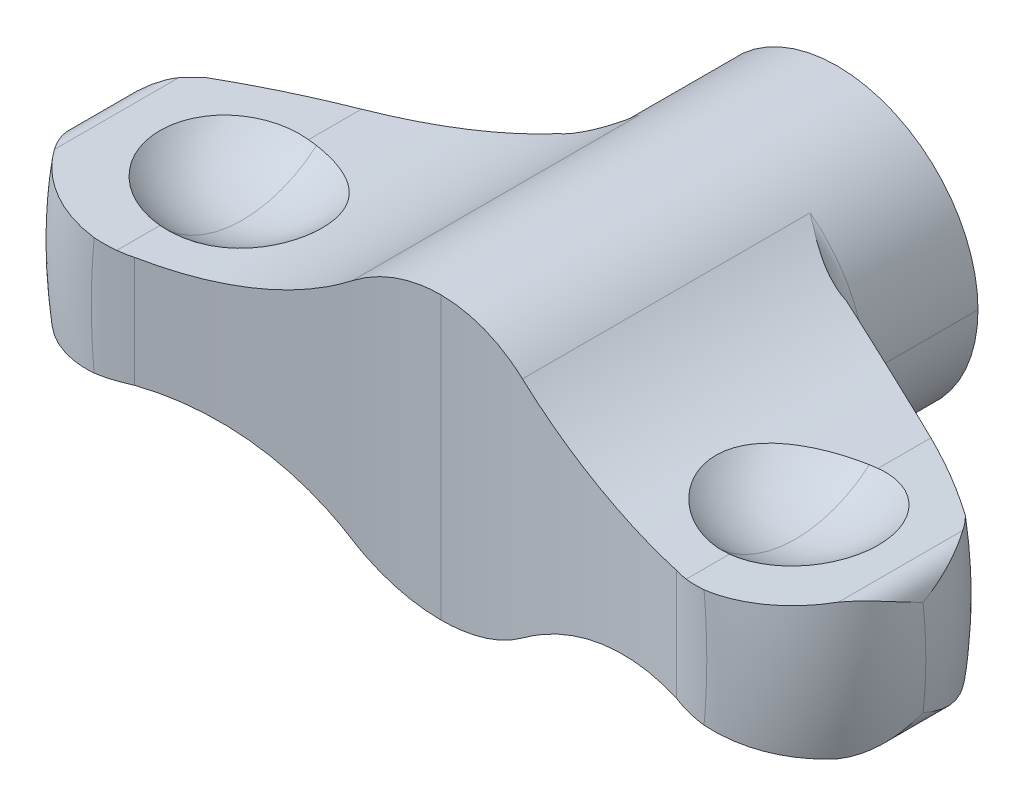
ISO-10303-21;
HEADER;
FILE_DESCRIPTION(('STEP AP214'),'2;1');
FILE_NAME('part.step','',(''),(''),'','','');
FILE_SCHEMA(('AUTOMOTIVE_DESIGN { 1 0 10303 214 1 1 1 1 }'));
ENDSEC;
DATA;
#1=APPLICATION_CONTEXT('core data for automotive mechanical design processes');
#2=APPLICATION_PROTOCOL_DEFINITION('international standard','automotive_design',2000,#1);
#3=PRODUCT_CONTEXT('',#1,'mechanical');
#4=PRODUCT('Part','Part','',(#3));
#5=PRODUCT_RELATED_PRODUCT_CATEGORY('part','',(#4));
#6=PRODUCT_DEFINITION_FORMATION('','',#4);
#7=PRODUCT_DEFINITION_CONTEXT('part definition',#1,'design');
#8=PRODUCT_DEFINITION('design','',#6,#7);
#9=PRODUCT_DEFINITION_SHAPE('','',#8);
#10=(LENGTH_UNIT() NAMED_UNIT(*) SI_UNIT(.MILLI.,.METRE.));
#11=(NAMED_UNIT(*) PLANE_ANGLE_UNIT() SI_UNIT($,.RADIAN.));
#12=(NAMED_UNIT(*) SI_UNIT($,.STERADIAN.) SOLID_ANGLE_UNIT());
#13=UNCERTAINTY_MEASURE_WITH_UNIT(LENGTH_MEASURE(1.E-05),#10,'distance_accuracy_value','');
#14=(GEOMETRIC_REPRESENTATION_CONTEXT(3) GLOBAL_UNCERTAINTY_ASSIGNED_CONTEXT((#13)) GLOBAL_UNIT_ASSIGNED_CONTEXT((#10,
#11,#12)) REPRESENTATION_CONTEXT('',''));
#15=CARTESIAN_POINT('',(0.,0.,0.));
#16=DIRECTION('',(0.,0.,1.));
#17=DIRECTION('',(1.,0.,0.));
#18=AXIS2_PLACEMENT_3D('',#15,#16,#17);
#19=CARTESIAN_POINT('',(13.25,6.75,15.25));
#20=DIRECTION('',(0.,0.,1.));
#21=DIRECTION('',(-1.,0.,0.));
#22=AXIS2_PLACEMENT_3D('',#19,#20,#21);
#23=SPHERICAL_SURFACE('',#22,5.4);
#24=CARTESIAN_POINT('',(13.25,6.75,15.25));
#25=DIRECTION('',(1.,0.,0.));
#26=DIRECTION('',(0.,0.,1.));
#27=AXIS2_PLACEMENT_3D('',#24,#25,#26);
#28=CIRCLE('',#27,5.4);
#29=CARTESIAN_POINT('',(13.25,1.35,15.25));
#30=VERTEX_POINT('',#29);
#31=CARTESIAN_POINT('',(13.25,2.67341046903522,18.7913864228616));
#32=VERTEX_POINT('',#31);
#33=EDGE_CURVE('E369',#30,#32,#28,.F.);
#34=ORIENTED_EDGE('',*,*,#33,.T.);
#35=CARTESIAN_POINT('',(13.6469742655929,2.7092176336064,18.8101248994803));
#36=CARTESIAN_POINT('',(13.5807778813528,2.70226198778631,18.8096097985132));
#37=CARTESIAN_POINT('',(13.5145985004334,2.69580023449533,18.8077907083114));
#38=CARTESIAN_POINT('',(13.3822737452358,2.6838645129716,18.8015445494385));
#39=CARTESIAN_POINT('',(13.3161283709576,2.67839054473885,18.7971174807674));
#40=CARTESIAN_POINT('',(13.25,2.67341046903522,18.7913864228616));
#41=B_SPLINE_CURVE_WITH_KNOTS('',3,(#35,#36,#37,#38,#39,#40),.UNSPECIFIED.,.F.,.F.,(4,2,4),(0.,
0.199556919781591,0.399113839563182),.UNSPECIFIED.);
#42=CARTESIAN_POINT('',(13.6469742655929,2.70921763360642,18.8101248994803));
#43=VERTEX_POINT('',#42);
#44=EDGE_CURVE('E270',#43,#32,#41,.T.);
#45=ORIENTED_EDGE('',*,*,#44,.F.);
#46=CARTESIAN_POINT('',(13.6469742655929,2.70921763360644,18.8101248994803));
#47=CARTESIAN_POINT('',(13.74655729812,2.71968423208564,18.8109101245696));
#48=CARTESIAN_POINT('',(13.8461684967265,2.73015379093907,18.8074517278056));
#49=CARTESIAN_POINT('',(14.0447432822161,2.751024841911,18.7921164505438));
#50=CARTESIAN_POINT('',(14.1437068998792,2.7614263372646,18.7802399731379));
#51=CARTESIAN_POINT('',(14.3402231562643,2.78208102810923,18.7481486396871));
#52=CARTESIAN_POINT('',(14.4377767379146,2.79233432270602,18.7279396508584));
#53=CARTESIAN_POINT('',(14.6308200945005,2.8126239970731,18.6793483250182));
#54=CARTESIAN_POINT('',(14.7263098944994,2.82266037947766,18.650966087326));
#55=CARTESIAN_POINT('',(15.0087595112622,2.8523470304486,18.5537886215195));
#56=CARTESIAN_POINT('',(15.1917827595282,2.87158354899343,18.4729489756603));
#57=CARTESIAN_POINT('',(15.5415956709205,2.90835036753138,18.2815763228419));
#58=CARTESIAN_POINT('',(15.7083885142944,2.92588100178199,18.1710491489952));
#59=CARTESIAN_POINT('',(16.0211856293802,2.95875730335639,17.9233963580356));
#60=CARTESIAN_POINT('',(16.1671894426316,2.97410292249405,17.7862701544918));
#61=CARTESIAN_POINT('',(16.4342444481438,3.00217153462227,17.489298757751));
#62=CARTESIAN_POINT('',(16.5552918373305,3.01489412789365,17.3294501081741));
#63=CARTESIAN_POINT('',(16.7689741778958,3.03735304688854,16.9915931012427));
#64=CARTESIAN_POINT('',(16.8616103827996,3.04708950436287,16.8135855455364));
#65=CARTESIAN_POINT('',(17.0158402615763,3.06329971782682,16.4444707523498));
#66=CARTESIAN_POINT('',(17.0774359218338,3.06977368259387,16.253364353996));
#67=CARTESIAN_POINT('',(17.1678468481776,3.07927625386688,15.8634621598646));
#68=CARTESIAN_POINT('',(17.1966614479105,3.08230479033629,15.6646662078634));
#69=CARTESIAN_POINT('',(17.2206901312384,3.08483030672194,15.2650270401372));
#70=CARTESIAN_POINT('',(17.2159034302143,3.08432720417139,15.0641837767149));
#71=CARTESIAN_POINT('',(17.1728638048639,3.07980355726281,14.6661578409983));
#72=CARTESIAN_POINT('',(17.1346111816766,3.07578304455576,14.4689751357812));
#73=CARTESIAN_POINT('',(17.0257262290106,3.06433877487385,14.0838669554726));
#74=CARTESIAN_POINT('',(16.9550940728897,3.05691503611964,13.8959414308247));
#75=CARTESIAN_POINT('',(16.7834534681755,3.03887488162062,13.5346771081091));
#76=CARTESIAN_POINT('',(16.6824443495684,3.02825839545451,13.3613386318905));
#77=CARTESIAN_POINT('',(16.4529214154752,3.00413456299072,13.0341801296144));
#78=CARTESIAN_POINT('',(16.3244086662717,2.99062732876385,12.8803593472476));
#79=CARTESIAN_POINT('',(16.0435440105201,2.96110726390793,12.5966116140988));
#80=CARTESIAN_POINT('',(15.8911949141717,2.94509472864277,12.4666818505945));
#81=CARTESIAN_POINT('',(15.5669134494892,2.91101137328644,12.2343486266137));
#82=CARTESIAN_POINT('',(15.3949757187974,2.89293998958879,12.1319527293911));
#83=CARTESIAN_POINT('',(15.0363791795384,2.85524997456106,11.9575956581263));
#84=CARTESIAN_POINT('',(14.8497123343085,2.83563049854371,11.8856512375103));
#85=CARTESIAN_POINT('',(14.4671407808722,2.79542060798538,11.7743939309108));
#86=CARTESIAN_POINT('',(14.2712491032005,2.77483156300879,11.7350363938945));
#87=CARTESIAN_POINT('',(14.0028192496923,2.74661844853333,11.7043866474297));
#88=CARTESIAN_POINT('',(13.9317141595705,2.73914500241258,11.6984560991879));
#89=CARTESIAN_POINT('',(13.7894021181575,2.72418740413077,11.6909286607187));
#90=CARTESIAN_POINT('',(13.718195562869,2.71670329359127,11.6893242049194));
#91=CARTESIAN_POINT('',(13.6469742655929,2.70921763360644,11.6898751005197));
#92=B_SPLINE_CURVE_WITH_KNOTS('',3,(#46,#47,#48,#49,#50,#51,#52,#53,#54,#55,#56,#57,#58,#59,#60,
#61,#62,#63,#64,#65,#66,#67,#68,#69,#70,#71,#72,#73,#74,#75,#76,#77,#78,#79,#80,#81,#82,#83,#84,
#85,#86,#87,#88,#89,#90,#91),.UNSPECIFIED.,.F.,.F.,(4,2,2,2,2,2,2,2,2,2,2,2,2,2,2,2,2,2,2,2,2,2,
4),(0.,0.300306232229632,0.600598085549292,0.90067885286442,1.20075597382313,1.80065907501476,
2.40044439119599,3.00024293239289,3.60013280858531,4.19999621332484,4.79982122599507,
5.39965843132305,5.99950964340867,6.59935545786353,7.19919806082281,7.79905389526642,
8.39888647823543,8.99864839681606,9.59857489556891,10.1988310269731,10.7982633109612,
11.013391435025,11.2281430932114),.UNSPECIFIED.);
#93=CARTESIAN_POINT('',(13.6469742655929,2.70921763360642,11.6898751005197));
#94=VERTEX_POINT('',#93);
#95=EDGE_CURVE('E273',#43,#94,#92,.T.);
#96=ORIENTED_EDGE('',*,*,#95,.T.);
#97=CARTESIAN_POINT('',(13.25,2.67341046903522,11.7086135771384));
#98=CARTESIAN_POINT('',(13.3161283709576,2.67839054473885,11.7028825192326));
#99=CARTESIAN_POINT('',(13.3822737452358,2.6838645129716,11.6984554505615));
#100=CARTESIAN_POINT('',(13.5145985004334,2.69580023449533,11.6922092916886));
#101=CARTESIAN_POINT('',(13.5807778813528,2.70226198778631,11.6903902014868));
#102=CARTESIAN_POINT('',(13.6469742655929,2.7092176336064,11.6898751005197));
#103=B_SPLINE_CURVE_WITH_KNOTS('',3,(#97,#98,#99,#100,#101,#102),.UNSPECIFIED.,.F.,.F.,(4,2,4),
(0.,0.199556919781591,0.399113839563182),.UNSPECIFIED.);
#104=CARTESIAN_POINT('',(13.25,2.67341046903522,11.7086135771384));
#105=VERTEX_POINT('',#104);
#106=EDGE_CURVE('E20',#105,#94,#103,.T.);
#107=ORIENTED_EDGE('',*,*,#106,.F.);
#108=CARTESIAN_POINT('',(13.25,6.75,15.25));
#109=DIRECTION('',(1.,0.,0.));
#110=DIRECTION('',(0.,0.,1.));
#111=AXIS2_PLACEMENT_3D('',#108,#109,#110);
#112=CIRCLE('',#111,5.4);
#113=EDGE_CURVE('E279',#105,#30,#112,.F.);
#114=ORIENTED_EDGE('',*,*,#113,.T.);
#115=EDGE_LOOP('',(#34,#45,#96,#107,#114));
#116=FACE_BOUND('',#115,.T.);
#117=ADVANCED_FACE('F15',(#116),#23,.F.);
#118=CARTESIAN_POINT('',(18.7921747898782,2.16666666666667,0.));
#119=DIRECTION('',(0.,0.,-1.));
#120=DIRECTION('',(0.,-1.,0.));
#121=AXIS2_PLACEMENT_3D('',#118,#119,#120);
#122=CYLINDRICAL_SURFACE('',#121,1.08333333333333);
#123=CARTESIAN_POINT('',(18.7921747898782,3.24999999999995,12.7683461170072));
#124=CARTESIAN_POINT('',(18.8135715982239,3.24999640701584,12.7989003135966));
#125=CARTESIAN_POINT('',(18.8347154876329,3.24933763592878,12.8296272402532));
#126=CARTESIAN_POINT('',(18.8772398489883,3.24676485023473,12.8925373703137));
#127=CARTESIAN_POINT('',(18.8986001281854,3.24480529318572,12.9247323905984));
#128=CARTESIAN_POINT('',(18.9414804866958,3.23960687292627,12.9906061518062));
#129=CARTESIAN_POINT('',(18.9629778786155,3.2363238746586,13.0242961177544));
#130=CARTESIAN_POINT('',(19.0060532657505,3.22845012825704,13.0931868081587));
#131=CARTESIAN_POINT('',(19.0276062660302,3.22381652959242,13.1283982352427));
#132=CARTESIAN_POINT('',(19.0707082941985,3.21321405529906,13.2003561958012));
#133=CARTESIAN_POINT('',(19.0922300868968,3.20720366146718,13.2371128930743));
#134=CARTESIAN_POINT('',(19.1351805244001,3.19381975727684,13.3121832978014));
#135=CARTESIAN_POINT('',(19.1565797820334,3.18640604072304,13.3505066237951));
#136=CARTESIAN_POINT('',(19.1991911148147,3.17018797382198,13.4287292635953));
#137=CARTESIAN_POINT('',(19.2203717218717,3.16134471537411,13.4686376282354));
#138=CARTESIAN_POINT('',(19.2624469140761,3.14224046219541,13.5500460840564));
#139=CARTESIAN_POINT('',(19.2833080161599,3.13194183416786,13.5915546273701));
#140=CARTESIAN_POINT('',(19.3246405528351,3.10990052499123,13.6761756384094));
#141=CARTESIAN_POINT('',(19.3450765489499,3.09812146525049,13.719295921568));
#142=CARTESIAN_POINT('',(19.3854504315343,3.07309363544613,13.8071484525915));
#143=CARTESIAN_POINT('',(19.4053509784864,3.05980971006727,13.8518878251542));
#144=CARTESIAN_POINT('',(19.4445408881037,3.03174888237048,13.9429830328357));
#145=CARTESIAN_POINT('',(19.4637910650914,3.01693806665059,13.9893452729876));
#146=CARTESIAN_POINT('',(19.5015621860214,2.98579715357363,14.0836828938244));
#147=CARTESIAN_POINT('',(19.5200421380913,2.96943422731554,14.1316638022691));
#148=CARTESIAN_POINT('',(19.5663126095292,2.92554403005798,14.256700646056));
#149=CARTESIAN_POINT('',(19.593016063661,2.89722239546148,14.3338827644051));
#150=CARTESIAN_POINT('',(19.6452451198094,2.83566369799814,14.4960825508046));
#151=CARTESIAN_POINT('',(19.6704074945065,2.80221611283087,14.5811366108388));
#152=CARTESIAN_POINT('',(19.7184399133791,2.73024644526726,14.7591391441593));
#153=CARTESIAN_POINT('',(19.7409101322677,2.69153722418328,14.8521202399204));
#154=CARTESIAN_POINT('',(19.7756642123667,2.62208726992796,15.0146110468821));
#155=CARTESIAN_POINT('',(19.789085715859,2.59181994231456,15.0840836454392));
#156=CARTESIAN_POINT('',(19.8164605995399,2.52176978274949,15.2429472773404));
#157=CARTESIAN_POINT('',(19.8294805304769,2.48172793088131,15.33238631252));
#158=CARTESIAN_POINT('',(19.8531035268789,2.39168225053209,15.5312015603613));
#159=CARTESIAN_POINT('',(19.8625335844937,2.34143532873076,15.6406084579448));
#160=CARTESIAN_POINT('',(19.8683786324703,2.29074889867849,15.75));
#161=B_SPLINE_CURVE_WITH_KNOTS('',3,(#123,#124,#125,#126,#127,#128,#129,#130,#131,#132,#133,
#134,#135,#136,#137,#138,#139,#140,#141,#142,#143,#144,#145,#146,#147,#148,#149,#150,#151,#152,
#153,#154,#155,#156,#157,#158,#159,#160),.UNSPECIFIED.,.F.,.F.,(4,2,2,2,2,2,2,2,2,2,2,2,2,2,2,2,
2,2,4),(0.,0.111891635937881,0.227923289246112,0.348195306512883,0.472800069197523,
0.601822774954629,0.735342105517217,0.87343079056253,1.01615607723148,1.16358011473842,
1.31576026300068,1.4727493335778,1.63459577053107,1.89380891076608,2.17807275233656,
2.48748871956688,2.71831204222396,3.01475351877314,3.3768163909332),.UNSPECIFIED.);
#162=CARTESIAN_POINT('',(18.7921747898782,3.25,12.7683461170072));
#163=VERTEX_POINT('',#162);
#164=CARTESIAN_POINT('',(19.8683786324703,2.29074889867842,15.75));
#165=VERTEX_POINT('',#164);
#166=EDGE_CURVE('E374',#163,#165,#161,.T.);
#167=ORIENTED_EDGE('',*,*,#166,.F.);
#168=DIRECTION('',(0.,0.,1.));
#169=VECTOR('',#168,1.);
#170=CARTESIAN_POINT('',(18.7921747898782,3.25,0.));
#171=LINE('',#170,#169);
#172=CARTESIAN_POINT('',(18.7921747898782,3.25,18.7316538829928));
#173=VERTEX_POINT('',#172);
#174=EDGE_CURVE('E534',#163,#173,#171,.T.);
#175=ORIENTED_EDGE('',*,*,#174,.T.);
#176=CARTESIAN_POINT('',(19.8683786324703,2.29074889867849,15.75));
#177=CARTESIAN_POINT('',(19.8625340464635,2.34143137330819,15.8593826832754));
#178=CARTESIAN_POINT('',(19.8531050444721,2.39167418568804,15.9687808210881));
#179=CARTESIAN_POINT('',(19.8294841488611,2.48171591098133,16.1675873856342));
#180=CARTESIAN_POINT('',(19.8164646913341,2.52175779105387,16.257026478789));
#181=CARTESIAN_POINT('',(19.7890891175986,2.59181211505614,16.4158989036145));
#182=CARTESIAN_POINT('',(19.7756660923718,2.62208342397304,16.4853802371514));
#183=CARTESIAN_POINT('',(19.7409127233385,2.69153216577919,16.6478675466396));
#184=CARTESIAN_POINT('',(19.7184457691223,2.73023663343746,16.7408364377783));
#185=CARTESIAN_POINT('',(19.6704179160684,2.80220176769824,16.9188270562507));
#186=CARTESIAN_POINT('',(19.6452561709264,2.83564930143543,17.0038813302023));
#187=CARTESIAN_POINT('',(19.593024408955,2.89721302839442,17.1660933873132));
#188=CARTESIAN_POINT('',(19.5663170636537,2.9255393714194,17.2432875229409));
#189=CARTESIAN_POINT('',(19.5200425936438,2.96943406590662,17.3683348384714));
#190=CARTESIAN_POINT('',(19.5015631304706,2.98579699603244,17.4163143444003));
#191=CARTESIAN_POINT('',(19.4637929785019,3.01693784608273,17.5106494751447));
#192=CARTESIAN_POINT('',(19.4445432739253,3.03174859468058,17.5570106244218));
#193=CARTESIAN_POINT('',(19.4053542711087,3.0598093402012,17.6481039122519));
#194=CARTESIAN_POINT('',(19.385454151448,3.07309324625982,17.6928424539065));
#195=CARTESIAN_POINT('',(19.3450810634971,3.09812105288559,17.7806935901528));
#196=CARTESIAN_POINT('',(19.3246454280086,3.10990010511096,17.8238133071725));
#197=CARTESIAN_POINT('',(19.2833135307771,3.13194141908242,17.9084334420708));
#198=CARTESIAN_POINT('',(19.2624527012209,3.14224005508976,17.9499416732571));
#199=CARTESIAN_POINT('',(19.2203779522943,3.16134433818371,18.03134975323));
#200=CARTESIAN_POINT('',(19.1991975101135,3.17018761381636,18.0712580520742));
#201=CARTESIAN_POINT('',(19.1565863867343,3.18640572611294,18.1494807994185));
#202=CARTESIAN_POINT('',(19.1351871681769,3.19381946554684,18.1878042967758));
#203=CARTESIAN_POINT('',(19.0922366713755,3.20720342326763,18.2628752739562));
#204=CARTESIAN_POINT('',(19.0707147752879,3.21321384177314,18.2996323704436));
#205=CARTESIAN_POINT('',(19.0276123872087,3.22381637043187,18.3715913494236));
#206=CARTESIAN_POINT('',(19.0060591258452,3.22844999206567,18.4068033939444));
#207=CARTESIAN_POINT('',(18.9629830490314,3.2363237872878,18.4756955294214));
#208=CARTESIAN_POINT('',(18.9414852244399,3.23960680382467,18.509386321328));
#209=CARTESIAN_POINT('',(18.8986038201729,3.24480526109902,18.5752619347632));
#210=CARTESIAN_POINT('',(18.8772429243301,3.24676482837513,18.6074579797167));
#211=CARTESIAN_POINT('',(18.8347171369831,3.24933763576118,18.6703703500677));
#212=CARTESIAN_POINT('',(18.8135724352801,3.24999640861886,18.7010984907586));
#213=CARTESIAN_POINT('',(18.7921747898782,3.24999999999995,18.7316538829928));
#214=B_SPLINE_CURVE_WITH_KNOTS('',3,(#176,#177,#178,#179,#180,#181,#182,#183,#184,#185,#186,
#187,#188,#189,#190,#191,#192,#193,#194,#195,#196,#197,#198,#199,#200,#201,#202,#203,#204,#205,
#206,#207,#208,#209,#210,#211,#212,#213),.UNSPECIFIED.,.F.,.F.,(4,2,2,2,2,2,2,2,2,2,2,2,2,2,2,2,
2,2,4),(0.,0.362033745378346,0.658475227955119,0.889327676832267,1.19870323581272,
1.4829670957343,1.74222062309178,1.90406282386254,2.06104841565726,2.21322584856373,
2.3606479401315,2.50337205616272,2.6414603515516,2.77498007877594,2.90400397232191,
3.02861071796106,3.14888551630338,3.26492075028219,3.37681676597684),.UNSPECIFIED.);
#215=EDGE_CURVE('E486',#165,#173,#214,.T.);
#216=ORIENTED_EDGE('',*,*,#215,.F.);
#217=EDGE_LOOP('',(#167,#175,#216));
#218=FACE_BOUND('',#217,.T.);
#219=ADVANCED_FACE('F782',(#218),#122,.T.);
#220=CARTESIAN_POINT('',(-18.7921747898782,2.16666666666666,0.));
#221=DIRECTION('',(0.,0.,-1.));
#222=DIRECTION('',(0.,-1.,0.));
#223=AXIS2_PLACEMENT_3D('',#220,#221,#222);
#224=CYLINDRICAL_SURFACE('',#223,1.08333333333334);
#225=DIRECTION('',(0.,0.,1.));
#226=VECTOR('',#225,1.);
#227=CARTESIAN_POINT('',(-18.7921747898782,3.25,0.));
#228=LINE('',#227,#226);
#229=CARTESIAN_POINT('',(-18.7921747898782,3.25,18.7316538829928));
#230=VERTEX_POINT('',#229);
#231=CARTESIAN_POINT('',(-18.7921747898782,3.25,12.7683461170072));
#232=VERTEX_POINT('',#231);
#233=EDGE_CURVE('E1357',#230,#232,#228,.F.);
#234=ORIENTED_EDGE('',*,*,#233,.T.);
#235=CARTESIAN_POINT('',(-19.868378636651,2.29074886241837,15.75));
#236=CARTESIAN_POINT('',(-19.862534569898,2.34142684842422,15.6406277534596));
#237=CARTESIAN_POINT('',(-19.8531067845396,2.39166508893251,15.5312399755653));
#238=CARTESIAN_POINT('',(-19.8294883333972,2.48170242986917,15.332443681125));
#239=CARTESIAN_POINT('',(-19.816469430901,2.52174438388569,15.2430045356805));
#240=CARTESIAN_POINT('',(-19.7890930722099,2.59180333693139,15.0841217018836));
#241=CARTESIAN_POINT('',(-19.7756682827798,2.62207909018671,15.0146300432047));
#242=CARTESIAN_POINT('',(-19.7409127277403,2.691532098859,14.8521324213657));
#243=CARTESIAN_POINT('',(-19.7184457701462,2.73023661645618,14.7591635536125));
#244=CARTESIAN_POINT('',(-19.6704179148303,2.80220178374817,14.581172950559));
#245=CARTESIAN_POINT('',(-19.6452561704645,2.83564930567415,14.4961186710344));
#246=CARTESIAN_POINT('',(-19.5930244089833,2.89721302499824,14.3339066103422));
#247=CARTESIAN_POINT('',(-19.5663170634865,2.92553937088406,14.2567124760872));
#248=CARTESIAN_POINT('',(-19.5200425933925,2.96943406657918,14.1316651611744));
#249=CARTESIAN_POINT('',(-19.5015631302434,2.98579699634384,14.0836856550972));
#250=CARTESIAN_POINT('',(-19.4637929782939,3.01693784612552,13.9893505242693));
#251=CARTESIAN_POINT('',(-19.4445432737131,3.03174859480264,13.9429893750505));
#252=CARTESIAN_POINT('',(-19.4053542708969,3.0598093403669,13.8518960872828));
#253=CARTESIAN_POINT('',(-19.3854541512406,3.07309324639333,13.8071575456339));
#254=CARTESIAN_POINT('',(-19.3450810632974,3.09812105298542,13.7193064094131));
#255=CARTESIAN_POINT('',(-19.3246454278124,3.10990010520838,13.6761866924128));
#256=CARTESIAN_POINT('',(-19.2833135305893,3.13194141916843,13.5915665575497));
#257=CARTESIAN_POINT('',(-19.262452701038,3.14224005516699,13.5500583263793));
#258=CARTESIAN_POINT('',(-19.2203779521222,3.16134433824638,13.4686502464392));
#259=CARTESIAN_POINT('',(-19.1991975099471,3.17018761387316,13.4287419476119));
#260=CARTESIAN_POINT('',(-19.1565863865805,3.18640572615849,13.3505192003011));
#261=CARTESIAN_POINT('',(-19.1351871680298,3.19381946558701,13.3121957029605));
#262=CARTESIAN_POINT('',(-19.0922366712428,3.20720342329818,13.2371247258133));
#263=CARTESIAN_POINT('',(-19.0707147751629,3.21321384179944,13.2003676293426));
#264=CARTESIAN_POINT('',(-19.0276123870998,3.22381637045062,13.1284086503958));
#265=CARTESIAN_POINT('',(-19.0060591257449,3.22844999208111,13.0931966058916));
#266=CARTESIAN_POINT('',(-18.9629830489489,3.2363237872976,13.0243044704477));
#267=CARTESIAN_POINT('',(-18.9414852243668,3.23960680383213,12.9906136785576));
#268=CARTESIAN_POINT('',(-18.8986038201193,3.24480526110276,12.9247380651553));
#269=CARTESIAN_POINT('',(-18.8772429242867,3.24676482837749,12.8925420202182));
#270=CARTESIAN_POINT('',(-18.8347171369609,3.24933763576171,12.8296296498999));
#271=CARTESIAN_POINT('',(-18.8135724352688,3.24999640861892,12.7989015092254));
#272=CARTESIAN_POINT('',(-18.7921747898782,3.25000000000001,12.7683461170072));
#273=B_SPLINE_CURVE_WITH_KNOTS('',3,(#235,#236,#237,#238,#239,#240,#241,#242,#243,#244,#245,
#246,#247,#248,#249,#250,#251,#252,#253,#254,#255,#256,#257,#258,#259,#260,#261,#262,#263,#264,
#265,#266,#267,#268,#269,#270,#271,#272),.UNSPECIFIED.,.F.,.F.,(4,2,2,2,2,2,2,2,2,2,2,2,2,2,2,2,
2,2,4),(0.,0.361999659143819,0.65844115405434,0.889327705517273,1.19870326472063,
1.48296712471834,1.74222065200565,1.90406285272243,2.0610484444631,2.2132258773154,
2.36064796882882,2.5033720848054,2.64146038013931,2.77498010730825,2.90400400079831,
3.02861074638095,3.14888554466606,3.26492077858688,3.37681679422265),.UNSPECIFIED.);
#274=CARTESIAN_POINT('',(-19.8683786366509,2.29074886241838,15.75));
#275=VERTEX_POINT('',#274);
#276=EDGE_CURVE('E767',#275,#232,#273,.T.);
#277=ORIENTED_EDGE('',*,*,#276,.F.);
#278=CARTESIAN_POINT('',(-18.7921747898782,3.25000000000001,18.7316538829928));
#279=CARTESIAN_POINT('',(-18.813571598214,3.24999640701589,18.7010996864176));
#280=CARTESIAN_POINT('',(-18.8347154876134,3.24933763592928,18.6703727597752));
#281=CARTESIAN_POINT('',(-18.87723984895,3.24676485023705,18.6074626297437));
#282=CARTESIAN_POINT('',(-18.8986001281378,3.24480529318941,18.5752676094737));
#283=CARTESIAN_POINT('',(-18.9414804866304,3.23960687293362,18.5093938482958));
#284=CARTESIAN_POINT('',(-18.9629778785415,3.23632387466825,18.4757038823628));
#285=CARTESIAN_POINT('',(-19.0060532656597,3.22845012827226,18.4068131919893));
#286=CARTESIAN_POINT('',(-19.0276062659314,3.22381652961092,18.3716017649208));
#287=CARTESIAN_POINT('',(-19.070708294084,3.21321405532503,18.2996438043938));
#288=CARTESIAN_POINT('',(-19.0922300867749,3.20720366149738,18.2628871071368));
#289=CARTESIAN_POINT('',(-19.1351805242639,3.19381975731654,18.187816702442));
#290=CARTESIAN_POINT('',(-19.1565797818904,3.18640604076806,18.1494933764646));
#291=CARTESIAN_POINT('',(-19.1991911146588,3.17018797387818,18.0712707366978));
#292=CARTESIAN_POINT('',(-19.2203717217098,3.16134471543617,18.0313623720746));
#293=CARTESIAN_POINT('',(-19.2624469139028,3.14224046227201,17.9499539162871));
#294=CARTESIAN_POINT('',(-19.2833080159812,3.13194183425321,17.9084453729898));
#295=CARTESIAN_POINT('',(-19.3246405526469,3.10990052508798,17.8238243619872));
#296=CARTESIAN_POINT('',(-19.3450765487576,3.09812146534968,17.7807040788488));
#297=CARTESIAN_POINT('',(-19.3854504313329,3.07309363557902,17.6928515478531));
#298=CARTESIAN_POINT('',(-19.40535097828,3.05980971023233,17.6481121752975));
#299=CARTESIAN_POINT('',(-19.4445408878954,3.03174888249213,17.5570169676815));
#300=CARTESIAN_POINT('',(-19.4637910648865,3.01693806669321,17.5106547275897));
#301=CARTESIAN_POINT('',(-19.5015621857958,2.98579715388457,17.4163171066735));
#302=CARTESIAN_POINT('',(-19.5200421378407,2.9694342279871,17.3683361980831));
#303=CARTESIAN_POINT('',(-19.5663126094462,2.92554402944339,17.2432993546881));
#304=CARTESIAN_POINT('',(-19.593016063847,2.89722239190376,17.1661172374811));
#305=CARTESIAN_POINT('',(-19.6452451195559,2.8356637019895,17.0039174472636));
#306=CARTESIAN_POINT('',(-19.6704074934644,2.80221612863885,16.9188633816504));
#307=CARTESIAN_POINT('',(-19.7184399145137,2.73024642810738,16.7408608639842));
#308=CARTESIAN_POINT('',(-19.7409101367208,2.6915371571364,16.6478797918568));
#309=CARTESIAN_POINT('',(-19.7756664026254,2.62208293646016,16.4853786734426));
#310=CARTESIAN_POINT('',(-19.7890896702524,2.59181116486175,16.4158957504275));
#311=CARTESIAN_POINT('',(-19.8164653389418,2.52175637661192,16.2570217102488));
#312=CARTESIAN_POINT('',(-19.8294847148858,2.48171445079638,16.1675826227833));
#313=CARTESIAN_POINT('',(-19.8531052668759,2.39167315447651,15.9687776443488));
#314=CARTESIAN_POINT('',(-19.8625341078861,2.34143080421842,15.8593811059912));
#315=CARTESIAN_POINT('',(-19.868378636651,2.29074886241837,15.75));
#316=B_SPLINE_CURVE_WITH_KNOTS('',3,(#278,#279,#280,#281,#282,#283,#284,#285,#286,#287,#288,
#289,#290,#291,#292,#293,#294,#295,#296,#297,#298,#299,#300,#301,#302,#303,#304,#305,#306,#307,
#308,#309,#310,#311,#312,#313,#314,#315),.UNSPECIFIED.,.F.,.F.,(4,2,2,2,2,2,2,2,2,2,2,2,2,2,2,2,
2,2,4),(0.,0.111891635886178,0.227923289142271,0.348195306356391,0.472800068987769,
0.601822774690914,0.735342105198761,0.87343079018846,1.01615607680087,1.16358011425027,
1.31576026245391,1.47274933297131,1.63459576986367,1.89380891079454,2.17807275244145,
2.48748871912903,2.71834614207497,3.0147876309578,3.37681641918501),.UNSPECIFIED.);
#317=EDGE_CURVE('E755',#230,#275,#316,.T.);
#318=ORIENTED_EDGE('',*,*,#317,.F.);
#319=EDGE_LOOP('',(#234,#277,#318));
#320=FACE_BOUND('',#319,.T.);
#321=ADVANCED_FACE('F741',(#320),#224,.T.);
#322=CARTESIAN_POINT('',(-13.25,6.75,15.25));
#323=DIRECTION('',(0.,0.,1.));
#324=DIRECTION('',(-1.,0.,0.));
#325=AXIS2_PLACEMENT_3D('',#322,#323,#324);
#326=SPHERICAL_SURFACE('',#325,5.4);
#327=CARTESIAN_POINT('',(-13.6469742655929,2.7092176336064,11.6898751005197));
#328=CARTESIAN_POINT('',(-13.5807778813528,2.70226198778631,11.6903902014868));
#329=CARTESIAN_POINT('',(-13.5145985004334,2.69580023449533,11.6922092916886));
#330=CARTESIAN_POINT('',(-13.3822737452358,2.6838645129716,11.6984554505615));
#331=CARTESIAN_POINT('',(-13.3161283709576,2.67839054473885,11.7028825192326));
#332=CARTESIAN_POINT('',(-13.25,2.67341046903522,11.7086135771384));
#333=B_SPLINE_CURVE_WITH_KNOTS('',3,(#327,#328,#329,#330,#331,#332),.UNSPECIFIED.,.F.,.F.,(4,2,
4),(0.,0.199556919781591,0.399113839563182),.UNSPECIFIED.);
#334=CARTESIAN_POINT('',(-13.6469742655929,2.70921763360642,11.6898751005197));
#335=VERTEX_POINT('',#334);
#336=CARTESIAN_POINT('',(-13.25,2.67341046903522,11.7086135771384));
#337=VERTEX_POINT('',#336);
#338=EDGE_CURVE('E720',#335,#337,#333,.T.);
#339=ORIENTED_EDGE('',*,*,#338,.F.);
#340=CARTESIAN_POINT('',(-13.6469742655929,2.70921763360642,11.6898751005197));
#341=CARTESIAN_POINT('',(-13.74655729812,2.71968423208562,11.6890898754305));
#342=CARTESIAN_POINT('',(-13.8461684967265,2.73015379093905,11.6925482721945));
#343=CARTESIAN_POINT('',(-14.0447432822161,2.75102484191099,11.7078835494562));
#344=CARTESIAN_POINT('',(-14.1437068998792,2.76142633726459,11.7197600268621));
#345=CARTESIAN_POINT('',(-14.3402231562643,2.78208102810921,11.7518513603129));
#346=CARTESIAN_POINT('',(-14.4377767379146,2.792334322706,11.7720603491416));
#347=CARTESIAN_POINT('',(-14.6308200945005,2.81262399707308,11.8206516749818));
#348=CARTESIAN_POINT('',(-14.7263098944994,2.82266037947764,11.849033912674));
#349=CARTESIAN_POINT('',(-15.0087595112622,2.85234703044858,11.9462113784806));
#350=CARTESIAN_POINT('',(-15.1917827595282,2.87158354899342,12.0270510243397));
#351=CARTESIAN_POINT('',(-15.5415956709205,2.90835036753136,12.2184236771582));
#352=CARTESIAN_POINT('',(-15.7083885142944,2.92588100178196,12.3289508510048));
#353=CARTESIAN_POINT('',(-16.0211856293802,2.95875730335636,12.5766036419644));
#354=CARTESIAN_POINT('',(-16.1671894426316,2.97410292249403,12.7137298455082));
#355=CARTESIAN_POINT('',(-16.4342444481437,3.00217153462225,13.010701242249));
#356=CARTESIAN_POINT('',(-16.5552918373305,3.01489412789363,13.1705498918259));
#357=CARTESIAN_POINT('',(-16.7689741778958,3.03735304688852,13.5084068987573));
#358=CARTESIAN_POINT('',(-16.8616103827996,3.04708950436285,13.6864144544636));
#359=CARTESIAN_POINT('',(-17.0158402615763,3.06329971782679,14.0555292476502));
#360=CARTESIAN_POINT('',(-17.0774359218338,3.06977368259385,14.246635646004));
#361=CARTESIAN_POINT('',(-17.1678468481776,3.07927625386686,14.6365378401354));
#362=CARTESIAN_POINT('',(-17.1966614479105,3.08230479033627,14.8353337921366));
#363=CARTESIAN_POINT('',(-17.2206901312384,3.08483030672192,15.2349729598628));
#364=CARTESIAN_POINT('',(-17.2159034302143,3.08432720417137,15.4358162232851));
#365=CARTESIAN_POINT('',(-17.1728638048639,3.07980355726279,15.8338421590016));
#366=CARTESIAN_POINT('',(-17.1346111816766,3.07578304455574,16.0310248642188));
#367=CARTESIAN_POINT('',(-17.0257262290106,3.06433877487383,16.4161330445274));
#368=CARTESIAN_POINT('',(-16.9550940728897,3.05691503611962,16.6040585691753));
#369=CARTESIAN_POINT('',(-16.7834534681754,3.0388748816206,16.9653228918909));
#370=CARTESIAN_POINT('',(-16.6824443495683,3.02825839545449,17.1386613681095));
#371=CARTESIAN_POINT('',(-16.4529214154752,3.0041345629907,17.4658198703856));
#372=CARTESIAN_POINT('',(-16.3244086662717,2.99062732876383,17.6196406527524));
#373=CARTESIAN_POINT('',(-16.0435440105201,2.96110726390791,17.9033883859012));
#374=CARTESIAN_POINT('',(-15.8911949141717,2.94509472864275,18.0333181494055));
#375=CARTESIAN_POINT('',(-15.5669134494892,2.91101137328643,18.2656513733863));
#376=CARTESIAN_POINT('',(-15.3949757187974,2.89293998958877,18.3680472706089));
#377=CARTESIAN_POINT('',(-15.0363791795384,2.85524997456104,18.5424043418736));
#378=CARTESIAN_POINT('',(-14.8497123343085,2.83563049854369,18.6143487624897));
#379=CARTESIAN_POINT('',(-14.4671407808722,2.79542060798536,18.7256060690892));
#380=CARTESIAN_POINT('',(-14.2712491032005,2.77483156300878,18.7649636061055));
#381=CARTESIAN_POINT('',(-14.0028192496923,2.74661844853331,18.7956133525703));
#382=CARTESIAN_POINT('',(-13.9317141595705,2.73914500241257,18.8015439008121));
#383=CARTESIAN_POINT('',(-13.7894021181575,2.72418740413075,18.8090713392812));
#384=CARTESIAN_POINT('',(-13.718195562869,2.71670329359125,18.8106757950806));
#385=CARTESIAN_POINT('',(-13.6469742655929,2.70921763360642,18.8101248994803));
#386=B_SPLINE_CURVE_WITH_KNOTS('',3,(#340,#341,#342,#343,#344,#345,#346,#347,#348,#349,#350,
#351,#352,#353,#354,#355,#356,#357,#358,#359,#360,#361,#362,#363,#364,#365,#366,#367,#368,#369,
#370,#371,#372,#373,#374,#375,#376,#377,#378,#379,#380,#381,#382,#383,#384,#385),.UNSPECIFIED.,
.F.,.F.,(4,2,2,2,2,2,2,2,2,2,2,2,2,2,2,2,2,2,2,2,2,2,4),(0.,0.30030623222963,0.60059808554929,
0.900678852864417,1.20075597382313,1.80065907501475,2.40044439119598,3.00024293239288,
3.60013280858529,4.19999621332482,4.79982122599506,5.39965843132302,5.99950964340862,
6.5993554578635,7.19919806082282,7.7990538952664,8.39888647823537,8.99864839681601,
9.59857489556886,10.198831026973,10.7982633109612,11.0133914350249,11.2281430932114),.UNSPECIFIED.);
#387=CARTESIAN_POINT('',(-13.6469742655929,2.70921763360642,18.8101248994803));
#388=VERTEX_POINT('',#387);
#389=EDGE_CURVE('E458',#335,#388,#386,.T.);
#390=ORIENTED_EDGE('',*,*,#389,.T.);
#391=CARTESIAN_POINT('',(-13.25,2.67341046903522,18.7913864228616));
#392=CARTESIAN_POINT('',(-13.3161283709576,2.67839054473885,18.7971174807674));
#393=CARTESIAN_POINT('',(-13.3822737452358,2.6838645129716,18.8015445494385));
#394=CARTESIAN_POINT('',(-13.5145985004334,2.69580023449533,18.8077907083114));
#395=CARTESIAN_POINT('',(-13.5807778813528,2.70226198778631,18.8096097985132));
#396=CARTESIAN_POINT('',(-13.6469742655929,2.7092176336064,18.8101248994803));
#397=B_SPLINE_CURVE_WITH_KNOTS('',3,(#391,#392,#393,#394,#395,#396),.UNSPECIFIED.,.F.,.F.,(4,2,
4),(0.,0.199556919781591,0.399113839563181),.UNSPECIFIED.);
#398=CARTESIAN_POINT('',(-13.25,2.67341046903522,18.7913864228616));
#399=VERTEX_POINT('',#398);
#400=EDGE_CURVE('E727',#399,#388,#397,.T.);
#401=ORIENTED_EDGE('',*,*,#400,.F.);
#402=CARTESIAN_POINT('',(-13.25,6.75,15.25));
#403=DIRECTION('',(1.,0.,0.));
#404=DIRECTION('',(0.,0.,1.));
#405=AXIS2_PLACEMENT_3D('',#402,#403,#404);
#406=CIRCLE('',#405,5.4);
#407=CARTESIAN_POINT('',(-13.25,1.35,15.25));
#408=VERTEX_POINT('',#407);
#409=EDGE_CURVE('E1591',#399,#408,#406,.T.);
#410=ORIENTED_EDGE('',*,*,#409,.T.);
#411=CARTESIAN_POINT('',(-13.25,6.75,15.25));
#412=DIRECTION('',(1.,0.,0.));
#413=DIRECTION('',(0.,0.,1.));
#414=AXIS2_PLACEMENT_3D('',#411,#412,#413);
#415=CIRCLE('',#414,5.4);
#416=EDGE_CURVE('E1593',#408,#337,#415,.T.);
#417=ORIENTED_EDGE('',*,*,#416,.T.);
#418=EDGE_LOOP('',(#339,#390,#401,#410,#417));
#419=FACE_BOUND('',#418,.T.);
#420=ADVANCED_FACE('F736',(#419),#326,.F.);
#421=CARTESIAN_POINT('',(18.7921747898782,-2.16666666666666,0.));
#422=DIRECTION('',(0.,0.,-1.));
#423=DIRECTION('',(0.,-1.,0.));
#424=AXIS2_PLACEMENT_3D('',#421,#422,#423);
#425=CYLINDRICAL_SURFACE('',#424,1.08333333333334);
#426=CARTESIAN_POINT('',(18.7921747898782,-3.24999999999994,18.7316538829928));
#427=CARTESIAN_POINT('',(18.8135715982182,-3.24999640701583,18.7010996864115));
#428=CARTESIAN_POINT('',(18.8347154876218,-3.24933763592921,18.6703727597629));
#429=CARTESIAN_POINT('',(18.8772398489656,-3.24676485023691,18.6074626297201));
#430=CARTESIAN_POINT('',(18.8986001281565,-3.24480529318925,18.575267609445));
#431=CARTESIAN_POINT('',(18.9414804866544,-3.23960687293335,18.5093938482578));
#432=CARTESIAN_POINT('',(18.9629778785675,-3.23632387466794,18.4757038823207));
#433=CARTESIAN_POINT('',(19.0060532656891,-3.22845012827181,18.4068131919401));
#434=CARTESIAN_POINT('',(19.027606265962,-3.22381652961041,18.3716017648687));
#435=CARTESIAN_POINT('',(19.0707082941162,-3.21321405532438,18.2996438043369));
#436=CARTESIAN_POINT('',(19.0922300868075,-3.20720366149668,18.2628871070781));
#437=CARTESIAN_POINT('',(19.1351805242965,-3.19381975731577,18.1878167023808));
#438=CARTESIAN_POINT('',(19.1565797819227,-3.18640604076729,18.1494933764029));
#439=CARTESIAN_POINT('',(19.1991911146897,-3.17018797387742,18.0712707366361));
#440=CARTESIAN_POINT('',(19.2203717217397,-3.16134471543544,18.0313623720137));
#441=CARTESIAN_POINT('',(19.2624469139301,-3.1422404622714,17.9499539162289));
#442=CARTESIAN_POINT('',(19.283308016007,-3.13194183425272,17.9084453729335));
#443=CARTESIAN_POINT('',(19.3246405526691,-3.10990052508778,17.8238243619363));
#444=CARTESIAN_POINT('',(19.3450765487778,-3.09812146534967,17.7807040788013));
#445=CARTESIAN_POINT('',(19.3854504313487,-3.07309363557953,17.6928515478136));
#446=CARTESIAN_POINT('',(19.4053509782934,-3.05980971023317,17.6481121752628));
#447=CARTESIAN_POINT('',(19.4445408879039,-3.03174888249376,17.5570169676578));
#448=CARTESIAN_POINT('',(19.4637910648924,-3.01693806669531,17.5106547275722));
#449=CARTESIAN_POINT('',(19.5015621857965,-2.98579715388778,17.4163171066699));
#450=CARTESIAN_POINT('',(19.5200421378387,-2.96943422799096,17.3683361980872));
#451=CARTESIAN_POINT('',(19.5663126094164,-2.92554402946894,17.2432993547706));
#452=CARTESIAN_POINT('',(19.5930160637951,-2.89722239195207,17.1661172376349));
#453=CARTESIAN_POINT('',(19.6452451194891,-2.835663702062,17.0039174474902));
#454=CARTESIAN_POINT('',(19.6704074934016,-2.80221612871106,16.9188633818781));
#455=CARTESIAN_POINT('',(19.7184399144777,-2.73024642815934,16.7408608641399));
#456=CARTESIAN_POINT('',(19.7409101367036,-2.69153715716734,16.6478797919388));
#457=CARTESIAN_POINT('',(19.7756664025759,-2.62208293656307,16.4853786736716));
#458=CARTESIAN_POINT('',(19.7890896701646,-2.59181116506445,16.4158957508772));
#459=CARTESIAN_POINT('',(19.8164653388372,-2.52175637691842,16.2570217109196));
#460=CARTESIAN_POINT('',(19.8294847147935,-2.48171445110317,16.1675826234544));
#461=CARTESIAN_POINT('',(19.8531052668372,-2.39167315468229,15.9687776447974));
#462=CARTESIAN_POINT('',(19.8625341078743,-2.34143080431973,15.8593811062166));
#463=CARTESIAN_POINT('',(19.868378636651,-2.29074886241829,15.75));
#464=B_SPLINE_CURVE_WITH_KNOTS('',3,(#426,#427,#428,#429,#430,#431,#432,#433,#434,#435,#436,
#437,#438,#439,#440,#441,#442,#443,#444,#445,#446,#447,#448,#449,#450,#451,#452,#453,#454,#455,
#456,#457,#458,#459,#460,#461,#462,#463),.UNSPECIFIED.,.F.,.F.,(4,2,2,2,2,2,2,2,2,2,2,2,2,2,2,2,
2,2,4),(0.,0.11189163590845,0.227923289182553,0.348195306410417,0.472800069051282,
0.601822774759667,0.73534210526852,0.873430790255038,1.01615607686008,1.16358011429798,
1.31576026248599,1.47274933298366,1.63459576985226,1.89380891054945,2.17807275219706,
2.48748871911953,2.71834614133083,3.01478763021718,3.37681641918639),.UNSPECIFIED.);
#465=CARTESIAN_POINT('',(18.7921747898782,-3.25,18.7316538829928));
#466=VERTEX_POINT('',#465);
#467=CARTESIAN_POINT('',(19.8683786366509,-2.29074886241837,15.75));
#468=VERTEX_POINT('',#467);
#469=EDGE_CURVE('E520',#466,#468,#464,.T.);
#470=ORIENTED_EDGE('',*,*,#469,.F.);
#471=DIRECTION('',(0.,0.,1.));
#472=VECTOR('',#471,1.);
#473=CARTESIAN_POINT('',(18.7921747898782,-3.25,0.));
#474=LINE('',#473,#472);
#475=CARTESIAN_POINT('',(18.7921747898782,-3.25,12.7683461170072));
#476=VERTEX_POINT('',#475);
#477=EDGE_CURVE('E440',#466,#476,#474,.F.);
#478=ORIENTED_EDGE('',*,*,#477,.T.);
#479=CARTESIAN_POINT('',(19.868378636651,-2.29074886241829,15.75));
#480=CARTESIAN_POINT('',(19.8625345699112,-2.34142684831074,15.6406277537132));
#481=CARTESIAN_POINT('',(19.853106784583,-2.39166508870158,15.5312399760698));
#482=CARTESIAN_POINT('',(19.8294883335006,-2.48170242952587,15.3324436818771));
#483=CARTESIAN_POINT('',(19.8164694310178,-2.52174438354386,15.2430045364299));
#484=CARTESIAN_POINT('',(19.7890930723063,-2.59180333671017,15.0841217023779));
#485=CARTESIAN_POINT('',(19.7756682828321,-2.62207909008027,15.0146300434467));
#486=CARTESIAN_POINT('',(19.7409127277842,-2.69153209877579,14.8521324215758));
#487=CARTESIAN_POINT('',(19.7184457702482,-2.73023661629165,14.7591635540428));
#488=CARTESIAN_POINT('',(19.6704179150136,-2.80220178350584,14.5811729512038));
#489=CARTESIAN_POINT('',(19.6452561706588,-2.83564930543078,14.4961186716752));
#490=CARTESIAN_POINT('',(19.5930244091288,-2.8972130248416,14.3339066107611));
#491=CARTESIAN_POINT('',(19.5663170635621,-2.92553937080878,14.2567124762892));
#492=CARTESIAN_POINT('',(19.5200425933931,-2.96943406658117,14.1316651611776));
#493=CARTESIAN_POINT('',(19.5015631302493,-2.98579699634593,14.083685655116));
#494=CARTESIAN_POINT('',(19.4637929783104,-3.01693784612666,13.9893505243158));
#495=CARTESIAN_POINT('',(19.4445432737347,-3.03174859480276,13.9429893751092));
#496=CARTESIAN_POINT('',(19.4053542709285,-3.05980934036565,13.851896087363));
#497=CARTESIAN_POINT('',(19.3854541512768,-3.07309324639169,13.8071575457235));
#498=CARTESIAN_POINT('',(19.3450810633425,-3.09812105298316,13.7193064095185));
#499=CARTESIAN_POINT('',(19.3246454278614,-3.10990010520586,13.6761866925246));
#500=CARTESIAN_POINT('',(19.2833135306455,-3.13194141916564,13.5915665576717));
#501=CARTESIAN_POINT('',(19.2624527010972,-3.14224005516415,13.550058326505));
#502=CARTESIAN_POINT('',(19.2203779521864,-3.16134433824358,13.4686502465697));
#503=CARTESIAN_POINT('',(19.1991975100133,-3.1701876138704,13.4287419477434));
#504=CARTESIAN_POINT('',(19.1565863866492,-3.18640572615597,13.3505192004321));
#505=CARTESIAN_POINT('',(19.1351871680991,-3.19381946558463,13.3121957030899));
#506=CARTESIAN_POINT('',(19.0922366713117,-3.20720342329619,13.2371247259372));
#507=CARTESIAN_POINT('',(19.0707147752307,-3.21321384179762,13.2003676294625));
#508=CARTESIAN_POINT('',(19.0276123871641,-3.22381637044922,13.1284086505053));
#509=CARTESIAN_POINT('',(19.0060591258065,-3.22844999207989,13.0931966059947));
#510=CARTESIAN_POINT('',(18.9629830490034,-3.2363237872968,13.0243044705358));
#511=CARTESIAN_POINT('',(18.9414852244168,-3.23960680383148,12.9906136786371));
#512=CARTESIAN_POINT('',(18.8986038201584,-3.24480526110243,12.9247380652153));
#513=CARTESIAN_POINT('',(18.8772429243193,-3.24676482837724,12.8925420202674));
#514=CARTESIAN_POINT('',(18.8347171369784,-3.24933763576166,12.8296296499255));
#515=CARTESIAN_POINT('',(18.8135724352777,-3.24999640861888,12.798901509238));
#516=CARTESIAN_POINT('',(18.7921747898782,-3.24999999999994,12.7683461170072));
#517=B_SPLINE_CURVE_WITH_KNOTS('',3,(#479,#480,#481,#482,#483,#484,#485,#486,#487,#488,#489,
#490,#491,#492,#493,#494,#495,#496,#497,#498,#499,#500,#501,#502,#503,#504,#505,#506,#507,#508,
#509,#510,#511,#512,#513,#514,#515,#516),.UNSPECIFIED.,.F.,.F.,(4,2,2,2,2,2,2,2,2,2,2,2,2,2,2,2,
2,2,4),(0.,0.361999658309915,0.6584411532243,0.889327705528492,1.19870326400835,
1.48296712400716,1.74222065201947,1.90406285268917,2.06104844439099,2.21322587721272,
2.36064796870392,2.50337208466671,2.64146037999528,2.77498010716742,2.90400400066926,
3.02861074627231,3.14888554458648,3.26492077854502,3.37681679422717),.UNSPECIFIED.);
#518=EDGE_CURVE('E382',#468,#476,#517,.T.);
#519=ORIENTED_EDGE('',*,*,#518,.F.);
#520=EDGE_LOOP('',(#470,#478,#519));
#521=FACE_BOUND('',#520,.T.);
#522=ADVANCED_FACE('F410',(#521),#425,.T.);
#523=CARTESIAN_POINT('',(13.25,-6.75,15.25));
#524=DIRECTION('',(0.,0.,1.));
#525=DIRECTION('',(-1.,0.,0.));
#526=AXIS2_PLACEMENT_3D('',#523,#524,#525);
#527=SPHERICAL_SURFACE('',#526,5.4);
#528=CARTESIAN_POINT('',(13.25,-6.75,15.25));
#529=DIRECTION('',(-1.,0.,0.));
#530=DIRECTION('',(0.,0.,1.));
#531=AXIS2_PLACEMENT_3D('',#528,#529,#530);
#532=CIRCLE('',#531,5.4);
#533=CARTESIAN_POINT('',(13.25,-1.35,15.25));
#534=VERTEX_POINT('',#533);
#535=CARTESIAN_POINT('',(13.25,-2.67341046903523,11.7086135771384));
#536=VERTEX_POINT('',#535);
#537=EDGE_CURVE('E1344',#534,#536,#532,.T.);
#538=ORIENTED_EDGE('',*,*,#537,.T.);
#539=CARTESIAN_POINT('',(13.6469742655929,-2.70921763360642,11.6898751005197));
#540=CARTESIAN_POINT('',(13.5807778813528,-2.70226198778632,11.6903902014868));
#541=CARTESIAN_POINT('',(13.5145985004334,-2.69580023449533,11.6922092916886));
#542=CARTESIAN_POINT('',(13.3822737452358,-2.68386451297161,11.6984554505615));
#543=CARTESIAN_POINT('',(13.3161283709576,-2.67839054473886,11.7028825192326));
#544=CARTESIAN_POINT('',(13.25,-2.67341046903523,11.7086135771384));
#545=B_SPLINE_CURVE_WITH_KNOTS('',3,(#539,#540,#541,#542,#543,#544),.UNSPECIFIED.,.F.,.F.,(4,2,
4),(0.,0.19955691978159,0.399113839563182),.UNSPECIFIED.);
#546=CARTESIAN_POINT('',(13.6469742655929,-2.70921763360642,11.6898751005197));
#547=VERTEX_POINT('',#546);
#548=EDGE_CURVE('E417',#547,#536,#545,.T.);
#549=ORIENTED_EDGE('',*,*,#548,.F.);
#550=CARTESIAN_POINT('',(13.6469742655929,-2.70921763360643,11.6898751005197));
#551=CARTESIAN_POINT('',(13.74655729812,-2.71968423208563,11.6890898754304));
#552=CARTESIAN_POINT('',(13.8461684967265,-2.73015379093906,11.6925482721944));
#553=CARTESIAN_POINT('',(14.0447432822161,-2.751024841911,11.7078835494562));
#554=CARTESIAN_POINT('',(14.1437068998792,-2.7614263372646,11.7197600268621));
#555=CARTESIAN_POINT('',(14.3402231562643,-2.78208102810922,11.7518513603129));
#556=CARTESIAN_POINT('',(14.4377767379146,-2.79233432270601,11.7720603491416));
#557=CARTESIAN_POINT('',(14.6308200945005,-2.81262399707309,11.8206516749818));
#558=CARTESIAN_POINT('',(14.7263098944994,-2.82266037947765,11.849033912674));
#559=CARTESIAN_POINT('',(15.0087595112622,-2.85234703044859,11.9462113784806));
#560=CARTESIAN_POINT('',(15.1917827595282,-2.87158354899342,12.0270510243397));
#561=CARTESIAN_POINT('',(15.5415956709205,-2.90835036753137,12.2184236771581));
#562=CARTESIAN_POINT('',(15.7083885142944,-2.92588100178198,12.3289508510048));
#563=CARTESIAN_POINT('',(16.0211856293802,-2.95875730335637,12.5766036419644));
#564=CARTESIAN_POINT('',(16.1671894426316,-2.97410292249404,12.7137298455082));
#565=CARTESIAN_POINT('',(16.4342444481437,-3.00217153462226,13.010701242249));
#566=CARTESIAN_POINT('',(16.5552918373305,-3.01489412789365,13.1705498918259));
#567=CARTESIAN_POINT('',(16.7689741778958,-3.03735304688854,13.5084068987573));
#568=CARTESIAN_POINT('',(16.8616103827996,-3.04708950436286,13.6864144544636));
#569=CARTESIAN_POINT('',(17.0158402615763,-3.0632997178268,14.0555292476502));
#570=CARTESIAN_POINT('',(17.0774359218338,-3.06977368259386,14.2466356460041));
#571=CARTESIAN_POINT('',(17.1678468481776,-3.07927625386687,14.6365378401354));
#572=CARTESIAN_POINT('',(17.1966614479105,-3.08230479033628,14.8353337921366));
#573=CARTESIAN_POINT('',(17.2206901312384,-3.08483030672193,15.2349729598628));
#574=CARTESIAN_POINT('',(17.2159034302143,-3.08432720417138,15.4358162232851));
#575=CARTESIAN_POINT('',(17.1728638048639,-3.0798035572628,15.8338421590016));
#576=CARTESIAN_POINT('',(17.1346111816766,-3.07578304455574,16.0310248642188));
#577=CARTESIAN_POINT('',(17.0257262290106,-3.06433877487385,16.4161330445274));
#578=CARTESIAN_POINT('',(16.9550940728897,-3.05691503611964,16.6040585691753));
#579=CARTESIAN_POINT('',(16.7834534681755,-3.03887488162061,16.9653228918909));
#580=CARTESIAN_POINT('',(16.6824443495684,-3.0282583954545,17.1386613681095));
#581=CARTESIAN_POINT('',(16.4529214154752,-3.00413456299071,17.4658198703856));
#582=CARTESIAN_POINT('',(16.3244086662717,-2.99062732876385,17.6196406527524));
#583=CARTESIAN_POINT('',(16.0435440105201,-2.96110726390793,17.9033883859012));
#584=CARTESIAN_POINT('',(15.8911949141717,-2.94509472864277,18.0333181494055));
#585=CARTESIAN_POINT('',(15.5669134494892,-2.91101137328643,18.2656513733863));
#586=CARTESIAN_POINT('',(15.3949757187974,-2.89293998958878,18.3680472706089));
#587=CARTESIAN_POINT('',(15.0363791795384,-2.85524997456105,18.5424043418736));
#588=CARTESIAN_POINT('',(14.8497123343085,-2.8356304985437,18.6143487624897));
#589=CARTESIAN_POINT('',(14.4671407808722,-2.79542060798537,18.7256060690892));
#590=CARTESIAN_POINT('',(14.2712491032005,-2.77483156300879,18.7649636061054));
#591=CARTESIAN_POINT('',(14.0028192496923,-2.74661844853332,18.7956133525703));
#592=CARTESIAN_POINT('',(13.9317141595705,-2.73914500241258,18.8015439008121));
#593=CARTESIAN_POINT('',(13.7894021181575,-2.72418740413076,18.8090713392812));
#594=CARTESIAN_POINT('',(13.718195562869,-2.71670329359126,18.8106757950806));
#595=CARTESIAN_POINT('',(13.6469742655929,-2.70921763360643,18.8101248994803));
#596=B_SPLINE_CURVE_WITH_KNOTS('',3,(#550,#551,#552,#553,#554,#555,#556,#557,#558,#559,#560,
#561,#562,#563,#564,#565,#566,#567,#568,#569,#570,#571,#572,#573,#574,#575,#576,#577,#578,#579,
#580,#581,#582,#583,#584,#585,#586,#587,#588,#589,#590,#591,#592,#593,#594,#595),.UNSPECIFIED.,
.F.,.F.,(4,2,2,2,2,2,2,2,2,2,2,2,2,2,2,2,2,2,2,2,2,2,4),(0.,0.300306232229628,0.600598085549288,
0.900678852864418,1.20075597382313,1.80065907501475,2.40044439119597,3.00024293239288,
3.6001328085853,4.19999621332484,4.79982122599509,5.39965843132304,5.99950964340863,
6.59935545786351,7.19919806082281,7.7990538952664,8.39888647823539,8.99864839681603,
9.59857489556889,10.1988310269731,10.7982633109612,11.013391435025,11.2281430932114),.UNSPECIFIED.);
#597=CARTESIAN_POINT('',(13.6469742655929,-2.70921763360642,18.8101248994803));
#598=VERTEX_POINT('',#597);
#599=EDGE_CURVE('E424',#547,#598,#596,.T.);
#600=ORIENTED_EDGE('',*,*,#599,.T.);
#601=CARTESIAN_POINT('',(13.25,-2.67341046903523,18.7913864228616));
#602=CARTESIAN_POINT('',(13.3161283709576,-2.67839054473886,18.7971174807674));
#603=CARTESIAN_POINT('',(13.3822737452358,-2.68386451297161,18.8015445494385));
#604=CARTESIAN_POINT('',(13.5145985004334,-2.69580023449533,18.8077907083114));
#605=CARTESIAN_POINT('',(13.5807778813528,-2.70226198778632,18.8096097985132));
#606=CARTESIAN_POINT('',(13.6469742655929,-2.70921763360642,18.8101248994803));
#607=B_SPLINE_CURVE_WITH_KNOTS('',3,(#601,#602,#603,#604,#605,#606),.UNSPECIFIED.,.F.,.F.,(4,2,
4),(0.,0.199556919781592,0.399113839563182),.UNSPECIFIED.);
#608=CARTESIAN_POINT('',(13.25,-2.67341046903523,18.7913864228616));
#609=VERTEX_POINT('',#608);
#610=EDGE_CURVE('E726',#609,#598,#607,.T.);
#611=ORIENTED_EDGE('',*,*,#610,.F.);
#612=CARTESIAN_POINT('',(13.25,-6.75,15.25));
#613=DIRECTION('',(-1.,0.,0.));
#614=DIRECTION('',(0.,0.,1.));
#615=AXIS2_PLACEMENT_3D('',#612,#613,#614);
#616=CIRCLE('',#615,5.4);
#617=EDGE_CURVE('E451',#609,#534,#616,.T.);
#618=ORIENTED_EDGE('',*,*,#617,.T.);
#619=EDGE_LOOP('',(#538,#549,#600,#611,#618));
#620=FACE_BOUND('',#619,.T.);
#621=ADVANCED_FACE('F406',(#620),#527,.F.);
#622=CARTESIAN_POINT('',(0.,0.,15.75));
#623=DIRECTION('',(0.,0.,-1.));
#624=DIRECTION('',(0.,-1.,0.));
#625=AXIS2_PLACEMENT_3D('',#622,#623,#624);
#626=TOROIDAL_SURFACE('',#625,14.75,5.25);
#627=CARTESIAN_POINT('',(18.1852949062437,3.18621435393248,12.0376893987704));
#628=CARTESIAN_POINT('',(18.2974428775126,3.1980015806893,12.1502269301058));
#629=CARTESIAN_POINT('',(18.4040901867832,3.20921066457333,12.2673837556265));
#630=CARTESIAN_POINT('',(18.606383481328,3.23047254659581,12.5109359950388));
#631=CARTESIAN_POINT('',(18.7020294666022,3.24052534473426,12.6373314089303));
#632=CARTESIAN_POINT('',(18.7921747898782,3.24999999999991,12.7683461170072));
#633=B_SPLINE_CURVE_WITH_KNOTS('',3,(#627,#628,#629,#630,#631,#632),.UNSPECIFIED.,.F.,.F.,(4,2,
4),(0.,0.476471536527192,0.952943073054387),.UNSPECIFIED.);
#634=CARTESIAN_POINT('',(18.1852949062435,3.18621435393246,12.0376893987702));
#635=VERTEX_POINT('',#634);
#636=EDGE_CURVE('E278',#635,#163,#633,.T.);
#637=ORIENTED_EDGE('',*,*,#636,.T.);
#638=ORIENTED_EDGE('',*,*,#166,.T.);
#639=CARTESIAN_POINT('',(0.,0.,15.75));
#640=DIRECTION('',(0.,0.,-1.));
#641=DIRECTION('',(0.,-1.,0.));
#642=AXIS2_PLACEMENT_3D('',#639,#640,#641);
#643=CIRCLE('',#642,20.);
#644=EDGE_CURVE('E524',#468,#165,#643,.F.);
#645=ORIENTED_EDGE('',*,*,#644,.F.);
#646=ORIENTED_EDGE('',*,*,#518,.T.);
#647=CARTESIAN_POINT('',(18.7921747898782,-3.25,12.7683461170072));
#648=CARTESIAN_POINT('',(18.7020294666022,-3.2405253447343,12.6373314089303));
#649=CARTESIAN_POINT('',(18.606383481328,-3.23047254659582,12.5109359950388));
#650=CARTESIAN_POINT('',(18.4040901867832,-3.20921066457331,12.2673837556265));
#651=CARTESIAN_POINT('',(18.2974428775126,-3.19800158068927,12.1502269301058));
#652=CARTESIAN_POINT('',(18.1852949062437,-3.18621435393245,12.0376893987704));
#653=B_SPLINE_CURVE_WITH_KNOTS('',3,(#647,#648,#649,#650,#651,#652),.UNSPECIFIED.,.F.,.F.,(4,2,
4),(0.,0.476471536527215,0.952943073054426),.UNSPECIFIED.);
#654=CARTESIAN_POINT('',(18.1852949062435,-3.18621435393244,12.0376893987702));
#655=VERTEX_POINT('',#654);
#656=EDGE_CURVE('E433',#476,#655,#653,.T.);
#657=ORIENTED_EDGE('',*,*,#656,.T.);
#658=CARTESIAN_POINT('',(0.,0.,12.0376893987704));
#659=DIRECTION('',(0.,0.,-1.));
#660=DIRECTION('',(0.,-1.,0.));
#661=AXIS2_PLACEMENT_3D('',#658,#659,#660);
#662=CIRCLE('',#661,18.4623106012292);
#663=EDGE_CURVE('E294',#635,#655,#662,.T.);
#664=ORIENTED_EDGE('',*,*,#663,.F.);
#665=EDGE_LOOP('',(#637,#638,#645,#646,#657,#664));
#666=FACE_BOUND('',#665,.T.);
#667=ADVANCED_FACE('F355',(#666),#626,.T.);
#668=CARTESIAN_POINT('',(13.25,6.75,15.25));
#669=DIRECTION('',(0.,0.,1.));
#670=DIRECTION('',(-1.,0.,0.));
#671=AXIS2_PLACEMENT_3D('',#668,#669,#670);
#672=SPHERICAL_SURFACE('',#671,5.4);
#673=CARTESIAN_POINT('',(13.25,2.67341046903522,11.7086135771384));
#674=CARTESIAN_POINT('',(13.1259266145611,2.66404973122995,11.7193756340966));
#675=CARTESIAN_POINT('',(13.002115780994,2.65646079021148,11.7347317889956));
#676=CARTESIAN_POINT('',(12.7557921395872,2.64471976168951,11.7746560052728));
#677=CARTESIAN_POINT('',(12.6332796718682,2.64056855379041,11.7992264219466));
#678=CARTESIAN_POINT('',(12.3898199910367,2.63558927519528,11.8577343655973));
#679=CARTESIAN_POINT('',(12.2688828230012,2.63477689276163,11.8917153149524));
#680=CARTESIAN_POINT('',(12.0300846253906,2.63630195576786,11.9689840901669));
#681=CARTESIAN_POINT('',(11.9122233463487,2.63863914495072,12.0122711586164));
#682=CARTESIAN_POINT('',(11.5640744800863,2.64999557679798,12.1563447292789));
#683=CARTESIAN_POINT('',(11.3395382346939,2.66336480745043,12.2712688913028));
#684=CARTESIAN_POINT('',(10.9149231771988,2.69835375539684,12.538056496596));
#685=CARTESIAN_POINT('',(10.714787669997,2.7199538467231,12.689831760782));
#686=CARTESIAN_POINT('',(10.3864931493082,2.76173363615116,12.9931852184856));
#687=CARTESIAN_POINT('',(10.252061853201,2.7812486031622,13.1380247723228));
#688=CARTESIAN_POINT('',(10.069802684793,2.81002063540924,13.3704435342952));
#689=CARTESIAN_POINT('',(10.0122583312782,2.81953228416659,13.4504844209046));
#690=CARTESIAN_POINT('',(9.90428663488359,2.83801340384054,13.6152718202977));
#691=CARTESIAN_POINT('',(9.85385620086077,2.84698310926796,13.7000162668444));
#692=CARTESIAN_POINT('',(9.76041021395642,2.86407170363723,13.8744057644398));
#693=CARTESIAN_POINT('',(9.71745250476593,2.87218377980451,13.9640825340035));
#694=CARTESIAN_POINT('',(9.64006343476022,2.88711248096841,14.1471045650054));
#695=CARTESIAN_POINT('',(9.60562775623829,2.8939297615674,14.2404479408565));
#696=CARTESIAN_POINT('',(9.54582968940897,2.90594818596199,14.4300595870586));
#697=CARTESIAN_POINT('',(9.52046324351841,2.91115005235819,14.5263265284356));
#698=CARTESIAN_POINT('',(9.47923207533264,2.919683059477,14.7209528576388));
#699=CARTESIAN_POINT('',(9.46336599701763,2.92301446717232,14.8193119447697));
#700=CARTESIAN_POINT('',(9.44277713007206,2.92735296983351,15.0049594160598));
#701=CARTESIAN_POINT('',(9.43692209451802,2.92859589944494,15.0921184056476));
#702=CARTESIAN_POINT('',(9.43282007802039,2.92946582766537,15.2666551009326));
#703=CARTESIAN_POINT('',(9.43457551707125,2.92909231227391,15.3540328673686));
#704=CARTESIAN_POINT('',(9.44567174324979,2.92674352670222,15.5282268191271));
#705=CARTESIAN_POINT('',(9.45500781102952,2.92476925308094,15.6150433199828));
#706=CARTESIAN_POINT('',(9.48112709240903,2.91929809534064,15.7875307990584));
#707=CARTESIAN_POINT('',(9.4979131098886,2.91580063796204,15.8732013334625));
#708=CARTESIAN_POINT('',(9.53770860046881,2.90762253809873,16.0386212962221));
#709=CARTESIAN_POINT('',(9.56037660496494,2.90300753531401,16.1184563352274));
#710=CARTESIAN_POINT('',(9.61196609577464,2.89268134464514,16.2760168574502));
#711=CARTESIAN_POINT('',(9.64088971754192,2.88696978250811,16.3537416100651));
#712=CARTESIAN_POINT('',(9.73656175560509,2.86846834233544,16.5830400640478));
#713=CARTESIAN_POINT('',(9.81224260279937,2.85430492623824,16.7308654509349));
#714=CARTESIAN_POINT('',(9.99057820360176,2.82295568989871,17.0237756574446));
#715=CARTESIAN_POINT('',(10.0947900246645,2.8056252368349,17.1678859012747));
#716=CARTESIAN_POINT('',(10.3232087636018,2.77093805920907,17.4392313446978));
#717=CARTESIAN_POINT('',(10.4474235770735,2.75358132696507,17.5664598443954));
#718=CARTESIAN_POINT('',(10.7310040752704,2.71853408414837,17.8197016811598));
#719=CARTESIAN_POINT('',(10.892856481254,2.70114720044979,17.9429685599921));
#720=CARTESIAN_POINT('',(11.2329297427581,2.67148374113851,18.1652509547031));
#721=CARTESIAN_POINT('',(11.4111654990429,2.65921187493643,18.2642440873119));
#722=CARTESIAN_POINT('',(11.8070460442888,2.64041244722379,18.4506273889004));
#723=CARTESIAN_POINT('',(12.0265999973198,2.63501717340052,18.5340737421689));
#724=CARTESIAN_POINT('',(12.4752120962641,2.63552607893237,18.6684098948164));
#725=CARTESIAN_POINT('',(12.7042587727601,2.64141699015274,18.7193378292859));
#726=CARTESIAN_POINT('',(12.9874819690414,2.65610097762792,18.761965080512));
#727=CARTESIAN_POINT('',(13.0399221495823,2.65912741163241,18.769011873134));
#728=CARTESIAN_POINT('',(13.1448876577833,2.66580224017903,18.7814405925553));
#729=CARTESIAN_POINT('',(13.197412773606,2.66944978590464,18.7868247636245));
#730=CARTESIAN_POINT('',(13.25,2.67341046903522,18.7913864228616));
#731=B_SPLINE_CURVE_WITH_KNOTS('',3,(#673,#674,#675,#676,#677,#678,#679,#680,#681,#682,#683,
#684,#685,#686,#687,#688,#689,#690,#691,#692,#693,#694,#695,#696,#697,#698,#699,#700,#701,#702,
#703,#704,#705,#706,#707,#708,#709,#710,#711,#712,#713,#714,#715,#716,#717,#718,#719,#720,#721,
#722,#723,#724,#725,#726,#727,#728,#729,#730),.UNSPECIFIED.,.F.,.F.,(4,2,2,2,2,2,2,2,2,2,2,2,2,
2,2,2,2,2,2,2,2,2,2,2,2,2,2,2,4),(0.,0.374576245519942,0.749248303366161,1.12567884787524,
1.50207876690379,2.25584206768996,3.0078192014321,3.60085811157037,3.89765808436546,
4.19432869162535,4.49320236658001,4.7919243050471,5.09051242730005,5.3890579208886,
5.65081382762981,5.91265297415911,6.1743292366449,6.43610406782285,6.68517794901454,
6.93433699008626,7.4322652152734,7.96627011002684,8.50048630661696,9.1106822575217,
9.72143878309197,10.4234537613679,11.1246439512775,11.2836227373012,11.4423859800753),.UNSPECIFIED.);
#732=EDGE_CURVE('E268',#105,#32,#731,.T.);
#733=ORIENTED_EDGE('',*,*,#732,.T.);
#734=ORIENTED_EDGE('',*,*,#33,.F.);
#735=ORIENTED_EDGE('',*,*,#113,.F.);
#736=EDGE_LOOP('',(#733,#734,#735));
#737=FACE_BOUND('',#736,.T.);
#738=ADVANCED_FACE('F350',(#737),#672,.F.);
#739=CARTESIAN_POINT('',(18.7921747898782,3.25,0.));
#740=DIRECTION('',(0.104528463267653,-0.994521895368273,0.));
#741=DIRECTION('',(0.994521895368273,0.104528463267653,0.));
#742=AXIS2_PLACEMENT_3D('',#739,#740,#741);
#743=PLANE('',#742);
#744=CARTESIAN_POINT('',(18.7921747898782,3.25,18.7316538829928));
#745=CARTESIAN_POINT('',(18.7085317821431,3.24120876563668,18.8532991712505));
#746=CARTESIAN_POINT('',(18.6197512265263,3.23187755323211,18.9713685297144));
#747=CARTESIAN_POINT('',(18.4326119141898,3.21220841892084,19.1995563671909));
#748=CARTESIAN_POINT('',(18.3342536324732,3.20187054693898,19.3096752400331));
#749=CARTESIAN_POINT('',(18.1287614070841,3.18027244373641,19.5210579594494));
#750=CARTESIAN_POINT('',(18.0216373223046,3.16901324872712,19.622331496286));
#751=CARTESIAN_POINT('',(17.7992918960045,3.14564380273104,19.8154472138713));
#752=CARTESIAN_POINT('',(17.6840707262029,3.13353356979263,19.9072895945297));
#753=CARTESIAN_POINT('',(17.4462889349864,3.10854169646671,20.0809436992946));
#754=CARTESIAN_POINT('',(17.3237245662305,3.0956596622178,20.1627502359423));
#755=CARTESIAN_POINT('',(17.0721388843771,3.0692169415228,20.3157338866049));
#756=CARTESIAN_POINT('',(16.9431150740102,3.05565599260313,20.386906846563));
#757=CARTESIAN_POINT('',(16.6796656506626,3.027966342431,20.5180384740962));
#758=CARTESIAN_POINT('',(16.5452443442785,3.01383809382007,20.5780058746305));
#759=CARTESIAN_POINT('',(16.2718648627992,2.98510475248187,20.6863893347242));
#760=CARTESIAN_POINT('',(16.1329054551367,2.97049953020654,20.7348022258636));
#761=CARTESIAN_POINT('',(15.7690130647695,2.93225289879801,20.8445670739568));
#762=CARTESIAN_POINT('',(15.5413026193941,2.9083195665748,20.8969421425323));
#763=CARTESIAN_POINT('',(15.1963082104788,2.87205919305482,20.9523531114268));
#764=CARTESIAN_POINT('',(15.0807249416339,2.85991090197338,20.9669651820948));
#765=CARTESIAN_POINT('',(14.8488305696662,2.8355378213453,20.9884448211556));
#766=CARTESIAN_POINT('',(14.7325193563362,2.82331302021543,20.9953111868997));
#767=CARTESIAN_POINT('',(14.6160655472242,2.81107323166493,20.9982912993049));
#768=B_SPLINE_CURVE_WITH_KNOTS('',3,(#744,#745,#746,#747,#748,#749,#750,#751,#752,#753,#754,
#755,#756,#757,#758,#759,#760,#761,#762,#763,#764,#765,#766,#767),.UNSPECIFIED.,.F.,.F.,(4,2,2,
2,2,2,2,2,2,2,2,4),(0.,0.443528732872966,0.887035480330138,1.33005009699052,1.77305532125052,
2.21628857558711,2.65969453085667,3.10275346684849,3.54593375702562,4.24815272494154,
4.59934410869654,4.95059001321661),.UNSPECIFIED.);
#769=CARTESIAN_POINT('',(14.6160655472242,2.81107323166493,20.9982912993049));
#770=VERTEX_POINT('',#769);
#771=EDGE_CURVE('E562',#173,#770,#768,.T.);
#772=ORIENTED_EDGE('',*,*,#771,.F.);
#773=ORIENTED_EDGE('',*,*,#174,.F.);
#774=ORIENTED_EDGE('',*,*,#636,.F.);
#775=CARTESIAN_POINT('',(13.6469742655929,2.70921763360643,9.15725009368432));
#776=CARTESIAN_POINT('',(13.8046564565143,2.72579069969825,9.24291682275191));
#777=CARTESIAN_POINT('',(13.9617609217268,2.74230304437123,9.32965873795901));
#778=CARTESIAN_POINT('',(14.2746713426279,2.77519125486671,9.50521184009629));
#779=CARTESIAN_POINT('',(14.4304781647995,2.79156721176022,9.59402146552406));
#780=CARTESIAN_POINT('',(14.7407960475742,2.82418293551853,9.77370506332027));
#781=CARTESIAN_POINT('',(14.8953077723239,2.84042277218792,9.86457787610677));
#782=CARTESIAN_POINT('',(15.2030379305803,2.87276651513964,10.0483843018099));
#783=CARTESIAN_POINT('',(15.3562568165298,2.88887046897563,10.1413171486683));
#784=CARTESIAN_POINT('',(15.6614015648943,2.92094247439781,10.329240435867));
#785=CARTESIAN_POINT('',(15.8133276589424,2.93691055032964,10.424230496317));
#786=CARTESIAN_POINT('',(16.7214362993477,3.03235661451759,11.0006114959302));
#787=CARTESIAN_POINT('',(17.4621478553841,3.11020853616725,11.5067386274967));
#788=CARTESIAN_POINT('',(18.1852949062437,3.18621435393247,12.0376893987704));
#789=B_SPLINE_CURVE_WITH_KNOTS('',3,(#775,#776,#777,#778,#779,#780,#781,#782,#783,#784,#785,
#786,#787,#788),.UNSPECIFIED.,.F.,.F.,(4,2,2,2,2,2,4),(0.,0.540638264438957,1.0808807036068,
1.62082667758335,2.16057512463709,2.70022473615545,5.39995460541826),.UNSPECIFIED.);
#790=CARTESIAN_POINT('',(13.6469742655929,2.70921763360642,9.15725009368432));
#791=VERTEX_POINT('',#790);
#792=EDGE_CURVE('E284',#791,#635,#789,.T.);
#793=ORIENTED_EDGE('',*,*,#792,.F.);
#794=DIRECTION('',(0.,0.,-1.));
#795=VECTOR('',#794,1.);
#796=CARTESIAN_POINT('',(13.6469742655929,2.70921763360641,0.));
#797=LINE('',#796,#795);
#798=EDGE_CURVE('E266',#791,#94,#797,.F.);
#799=ORIENTED_EDGE('',*,*,#798,.T.);
#800=ORIENTED_EDGE('',*,*,#95,.F.);
#801=DIRECTION('',(0.,0.,-1.));
#802=VECTOR('',#801,1.);
#803=CARTESIAN_POINT('',(13.6469742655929,2.70921763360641,0.));
#804=LINE('',#803,#802);
#805=CARTESIAN_POINT('',(13.6469742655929,2.70921763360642,20.8828193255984));
#806=VERTEX_POINT('',#805);
#807=EDGE_CURVE('E292',#43,#806,#804,.F.);
#808=ORIENTED_EDGE('',*,*,#807,.T.);
#809=CARTESIAN_POINT('',(14.75,2.82515030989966,15.7499999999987));
#810=DIRECTION('',(0.104528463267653,-0.994521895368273,0.));
#811=DIRECTION('',(-0.994521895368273,-0.104528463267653,0.));
#812=AXIS2_PLACEMENT_3D('',#809,#810,#811);
#813=ELLIPSE('',#812,5.27891846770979,5.25000000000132);
#814=EDGE_CURVE('E532',#770,#806,#813,.T.);
#815=ORIENTED_EDGE('',*,*,#814,.F.);
#816=EDGE_LOOP('',(#772,#773,#774,#793,#799,#800,#808,#815));
#817=FACE_BOUND('',#816,.T.);
#818=ADVANCED_FACE('F282',(#817),#743,.F.);
#819=CARTESIAN_POINT('',(0.,0.,15.75));
#820=DIRECTION('',(0.,0.,-1.));
#821=DIRECTION('',(0.,-1.,0.));
#822=AXIS2_PLACEMENT_3D('',#819,#820,#821);
#823=TOROIDAL_SURFACE('',#822,14.75,5.25);
#824=CARTESIAN_POINT('',(14.6160655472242,-2.81107323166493,20.9982912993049));
#825=CARTESIAN_POINT('',(14.763590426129,-2.82657872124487,20.9945353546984));
#826=CARTESIAN_POINT('',(14.9109552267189,-2.84206738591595,20.984504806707));
#827=CARTESIAN_POINT('',(15.2043221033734,-2.872901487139,20.9520261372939));
#828=CARTESIAN_POINT('',(15.3503242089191,-2.88824692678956,20.9295782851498));
#829=CARTESIAN_POINT('',(15.6398135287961,-2.91867348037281,20.8724193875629));
#830=CARTESIAN_POINT('',(15.7833026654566,-2.93375479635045,20.8377181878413));
#831=CARTESIAN_POINT('',(16.0668616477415,-2.96355804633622,20.7562924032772));
#832=CARTESIAN_POINT('',(16.2069315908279,-2.97827999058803,20.709568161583));
#833=CARTESIAN_POINT('',(16.4827493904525,-3.00726960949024,20.6043818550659));
#834=CARTESIAN_POINT('',(16.6184943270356,-3.02153697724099,20.5459120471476));
#835=CARTESIAN_POINT('',(16.8846438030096,-3.04951041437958,20.4176394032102));
#836=CARTESIAN_POINT('',(17.015046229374,-3.06321626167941,20.3478321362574));
#837=CARTESIAN_POINT('',(17.2694050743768,-3.08995045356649,20.1974538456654));
#838=CARTESIAN_POINT('',(17.3933674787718,-3.10297942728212,20.1168930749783));
#839=CARTESIAN_POINT('',(17.6340929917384,-3.12828069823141,19.9455350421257));
#840=CARTESIAN_POINT('',(17.7508541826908,-3.14055279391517,19.854735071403));
#841=CARTESIAN_POINT('',(18.0400154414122,-3.17094486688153,19.609485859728));
#842=CARTESIAN_POINT('',(18.2066509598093,-3.18845896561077,19.4480233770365));
#843=CARTESIAN_POINT('',(18.4394519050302,-3.21292733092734,19.190456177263));
#844=CARTESIAN_POINT('',(18.5142060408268,-3.22078430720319,19.1020199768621));
#845=CARTESIAN_POINT('',(18.6577398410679,-3.23587031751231,18.9203492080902));
#846=CARTESIAN_POINT('',(18.7265184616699,-3.24309924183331,18.8271138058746));
#847=CARTESIAN_POINT('',(18.7921747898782,-3.25,18.7316538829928));
#848=B_SPLINE_CURVE_WITH_KNOTS('',3,(#824,#825,#826,#827,#828,#829,#830,#831,#832,#833,#834,
#835,#836,#837,#838,#839,#840,#841,#842,#843,#844,#845,#846,#847),.UNSPECIFIED.,.F.,.F.,(4,2,2,
2,2,2,2,2,2,2,2,4),(0.,0.44502112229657,0.890032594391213,1.33468730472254,1.77932932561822,
2.22426543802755,2.6693758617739,3.11406488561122,3.55887181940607,4.25457096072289,
4.60255247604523,4.95059465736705),.UNSPECIFIED.);
#849=CARTESIAN_POINT('',(14.6160655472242,-2.81107323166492,20.9982912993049));
#850=VERTEX_POINT('',#849);
#851=EDGE_CURVE('E447',#850,#466,#848,.T.);
#852=ORIENTED_EDGE('',*,*,#851,.T.);
#853=ORIENTED_EDGE('',*,*,#469,.T.);
#854=ORIENTED_EDGE('',*,*,#644,.T.);
#855=ORIENTED_EDGE('',*,*,#215,.T.);
#856=ORIENTED_EDGE('',*,*,#771,.T.);
#857=CARTESIAN_POINT('',(14.6160655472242,2.81107323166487,20.9982912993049));
#858=CARTESIAN_POINT('',(14.6272151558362,2.6940674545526,20.9985752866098));
#859=CARTESIAN_POINT('',(14.6376707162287,2.57699544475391,20.9988072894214));
#860=CARTESIAN_POINT('',(14.657179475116,2.34289897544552,20.999189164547));
#861=CARTESIAN_POINT('',(14.666234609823,2.22587467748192,20.9993391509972));
#862=CARTESIAN_POINT('',(14.6829511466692,1.99184211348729,20.9995793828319));
#863=CARTESIAN_POINT('',(14.6906139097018,1.8748339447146,20.9996696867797));
#864=CARTESIAN_POINT('',(14.70455081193,1.64080140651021,20.9998087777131));
#865=CARTESIAN_POINT('',(14.710825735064,1.52377708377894,20.9998575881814));
#866=CARTESIAN_POINT('',(14.7219889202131,1.28967952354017,20.9999287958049));
#867=CARTESIAN_POINT('',(14.7268773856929,1.17260629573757,20.9999511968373));
#868=CARTESIAN_POINT('',(14.735266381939,0.938377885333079,20.9999812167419));
#869=CARTESIAN_POINT('',(14.7387665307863,0.821222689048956,20.9999888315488));
#870=CARTESIAN_POINT('',(14.744374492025,0.586797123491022,20.9999978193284));
#871=CARTESIAN_POINT('',(14.7464813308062,0.469526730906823,20.9999991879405));
#872=CARTESIAN_POINT('',(14.7492948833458,0.234837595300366,20.9999999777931));
#873=CARTESIAN_POINT('',(14.7500000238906,0.117418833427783,20.9999993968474));
#874=CARTESIAN_POINT('',(14.75,0.,21.));
#875=B_SPLINE_CURVE_WITH_KNOTS('',3,(#857,#858,#859,#860,#861,#862,#863,#864,#865,#866,#867,
#868,#869,#870,#871,#872,#873,#874),.UNSPECIFIED.,.F.,.F.,(4,2,2,2,2,2,2,2,4),(0.,
0.352606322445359,0.704720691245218,1.05648903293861,1.4080581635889,1.75957567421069,
2.11118981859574,2.46304940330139,2.81530367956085),.UNSPECIFIED.);
#876=CARTESIAN_POINT('',(14.75,0.,21.));
#877=VERTEX_POINT('',#876);
#878=EDGE_CURVE('E498',#877,#770,#875,.F.);
#879=ORIENTED_EDGE('',*,*,#878,.F.);
#880=CARTESIAN_POINT('',(14.75,0.,21.));
#881=CARTESIAN_POINT('',(14.7500000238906,-0.117418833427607,20.9999993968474));
#882=CARTESIAN_POINT('',(14.7492948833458,-0.234837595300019,20.9999999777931));
#883=CARTESIAN_POINT('',(14.7464813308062,-0.469526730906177,20.9999991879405));
#884=CARTESIAN_POINT('',(14.744374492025,-0.586797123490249,20.9999978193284));
#885=CARTESIAN_POINT('',(14.7387665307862,-0.82122268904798,20.9999888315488));
#886=CARTESIAN_POINT('',(14.735266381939,-0.938377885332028,20.9999812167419));
#887=CARTESIAN_POINT('',(14.7268773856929,-1.17260629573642,20.9999511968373));
#888=CARTESIAN_POINT('',(14.7219889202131,-1.289679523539,20.9999287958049));
#889=CARTESIAN_POINT('',(14.710825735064,-1.52377708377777,20.9998575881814));
#890=CARTESIAN_POINT('',(14.70455081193,-1.64080140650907,20.9998087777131));
#891=CARTESIAN_POINT('',(14.6906139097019,-1.87483394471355,20.9996696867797));
#892=CARTESIAN_POINT('',(14.6829511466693,-1.99184211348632,20.9995793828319));
#893=CARTESIAN_POINT('',(14.666234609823,-2.22587467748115,20.9993391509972));
#894=CARTESIAN_POINT('',(14.657179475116,-2.34289897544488,20.999189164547));
#895=CARTESIAN_POINT('',(14.6376707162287,-2.57699544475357,20.9988072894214));
#896=CARTESIAN_POINT('',(14.6272151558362,-2.69406745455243,20.9985752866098));
#897=CARTESIAN_POINT('',(14.6160655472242,-2.81107323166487,20.9982912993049));
#898=B_SPLINE_CURVE_WITH_KNOTS('',3,(#880,#881,#882,#883,#884,#885,#886,#887,#888,#889,#890,
#891,#892,#893,#894,#895,#896,#897),.UNSPECIFIED.,.F.,.F.,(4,2,2,2,2,2,2,2,4),(0.,
0.352254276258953,0.70411386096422,1.05572800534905,1.40724551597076,1.75881464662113,
2.11058298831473,2.46269735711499,2.81530367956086),.UNSPECIFIED.);
#899=EDGE_CURVE('E509',#850,#877,#898,.F.);
#900=ORIENTED_EDGE('',*,*,#899,.F.);
#901=EDGE_LOOP('',(#852,#853,#854,#855,#856,#879,#900));
#902=FACE_BOUND('',#901,.T.);
#903=ADVANCED_FACE('F465',(#902),#823,.T.);
#904=CARTESIAN_POINT('',(-13.25,-6.75,15.25));
#905=DIRECTION('',(0.,0.,1.));
#906=DIRECTION('',(-1.,0.,0.));
#907=AXIS2_PLACEMENT_3D('',#904,#905,#906);
#908=SPHERICAL_SURFACE('',#907,5.4);
#909=CARTESIAN_POINT('',(-13.6469742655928,-2.7092176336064,18.8101248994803));
#910=CARTESIAN_POINT('',(-13.5807778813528,-2.70226198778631,18.8096097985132));
#911=CARTESIAN_POINT('',(-13.5145985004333,-2.69580023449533,18.8077907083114));
#912=CARTESIAN_POINT('',(-13.3822737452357,-2.68386451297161,18.8015445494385));
#913=CARTESIAN_POINT('',(-13.3161283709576,-2.67839054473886,18.7971174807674));
#914=CARTESIAN_POINT('',(-13.25,-2.67341046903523,18.7913864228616));
#915=B_SPLINE_CURVE_WITH_KNOTS('',3,(#909,#910,#911,#912,#913,#914),.UNSPECIFIED.,.F.,.F.,(4,2,
4),(0.,0.199556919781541,0.399113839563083),.UNSPECIFIED.);
#916=CARTESIAN_POINT('',(-13.6469742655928,-2.70921763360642,18.8101248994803));
#917=VERTEX_POINT('',#916);
#918=CARTESIAN_POINT('',(-13.25,-2.67341046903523,18.7913864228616));
#919=VERTEX_POINT('',#918);
#920=EDGE_CURVE('E573',#917,#919,#915,.T.);
#921=ORIENTED_EDGE('',*,*,#920,.F.);
#922=CARTESIAN_POINT('',(-13.6469742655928,-2.70921763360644,18.8101248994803));
#923=CARTESIAN_POINT('',(-13.7465572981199,-2.71968423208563,18.8109101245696));
#924=CARTESIAN_POINT('',(-13.8461684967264,-2.73015379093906,18.8074517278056));
#925=CARTESIAN_POINT('',(-14.044743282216,-2.75102484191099,18.7921164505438));
#926=CARTESIAN_POINT('',(-14.1437068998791,-2.76142633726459,18.780239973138));
#927=CARTESIAN_POINT('',(-14.3402231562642,-2.78208102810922,18.7481486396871));
#928=CARTESIAN_POINT('',(-14.4377767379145,-2.79233432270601,18.7279396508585));
#929=CARTESIAN_POINT('',(-14.6308200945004,-2.81262399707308,18.6793483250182));
#930=CARTESIAN_POINT('',(-14.7263098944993,-2.82266037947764,18.6509660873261));
#931=CARTESIAN_POINT('',(-15.0087595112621,-2.85234703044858,18.5537886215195));
#932=CARTESIAN_POINT('',(-15.1917827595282,-2.87158354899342,18.4729489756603));
#933=CARTESIAN_POINT('',(-15.5415956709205,-2.90835036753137,18.2815763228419));
#934=CARTESIAN_POINT('',(-15.7083885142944,-2.92588100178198,18.1710491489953));
#935=CARTESIAN_POINT('',(-16.0211856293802,-2.95875730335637,17.9233963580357));
#936=CARTESIAN_POINT('',(-16.1671894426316,-2.97410292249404,17.7862701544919));
#937=CARTESIAN_POINT('',(-16.4342444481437,-3.00217153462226,17.4892987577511));
#938=CARTESIAN_POINT('',(-16.5552918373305,-3.01489412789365,17.3294501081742));
#939=CARTESIAN_POINT('',(-16.7689741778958,-3.03735304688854,16.9915931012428));
#940=CARTESIAN_POINT('',(-16.8616103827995,-3.04708950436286,16.8135855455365));
#941=CARTESIAN_POINT('',(-17.0158402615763,-3.06329971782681,16.4444707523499));
#942=CARTESIAN_POINT('',(-17.0774359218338,-3.06977368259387,16.2533643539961));
#943=CARTESIAN_POINT('',(-17.1678468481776,-3.07927625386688,15.8634621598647));
#944=CARTESIAN_POINT('',(-17.1966614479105,-3.08230479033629,15.6646662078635));
#945=CARTESIAN_POINT('',(-17.2206901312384,-3.08483030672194,15.2650270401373));
#946=CARTESIAN_POINT('',(-17.2159034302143,-3.08432720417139,15.064183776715));
#947=CARTESIAN_POINT('',(-17.1728638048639,-3.07980355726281,14.6661578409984));
#948=CARTESIAN_POINT('',(-17.1346111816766,-3.07578304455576,14.4689751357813));
#949=CARTESIAN_POINT('',(-17.0257262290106,-3.06433877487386,14.0838669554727));
#950=CARTESIAN_POINT('',(-16.9550940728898,-3.05691503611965,13.8959414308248));
#951=CARTESIAN_POINT('',(-16.7834534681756,-3.03887488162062,13.5346771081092));
#952=CARTESIAN_POINT('',(-16.6824443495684,-3.02825839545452,13.3613386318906));
#953=CARTESIAN_POINT('',(-16.4529214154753,-3.00413456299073,13.0341801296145));
#954=CARTESIAN_POINT('',(-16.3244086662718,-2.99062732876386,12.8803593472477));
#955=CARTESIAN_POINT('',(-16.0435440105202,-2.96110726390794,12.5966116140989));
#956=CARTESIAN_POINT('',(-15.8911949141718,-2.94509472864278,12.4666818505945));
#957=CARTESIAN_POINT('',(-15.5669134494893,-2.91101137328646,12.2343486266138));
#958=CARTESIAN_POINT('',(-15.3949757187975,-2.8929399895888,12.1319527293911));
#959=CARTESIAN_POINT('',(-15.0363791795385,-2.85524997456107,11.9575956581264));
#960=CARTESIAN_POINT('',(-14.8497123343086,-2.83563049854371,11.8856512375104));
#961=CARTESIAN_POINT('',(-14.4671407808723,-2.79542060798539,11.7743939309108));
#962=CARTESIAN_POINT('',(-14.2712491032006,-2.77483156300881,11.7350363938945));
#963=CARTESIAN_POINT('',(-14.0028192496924,-2.74661844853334,11.7043866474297));
#964=CARTESIAN_POINT('',(-13.9317141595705,-2.73914500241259,11.6984560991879));
#965=CARTESIAN_POINT('',(-13.7894021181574,-2.72418740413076,11.6909286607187));
#966=CARTESIAN_POINT('',(-13.7181955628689,-2.71670329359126,11.6893242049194));
#967=CARTESIAN_POINT('',(-13.6469742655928,-2.70921763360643,11.6898751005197));
#968=B_SPLINE_CURVE_WITH_KNOTS('',3,(#922,#923,#924,#925,#926,#927,#928,#929,#930,#931,#932,
#933,#934,#935,#936,#937,#938,#939,#940,#941,#942,#943,#944,#945,#946,#947,#948,#949,#950,#951,
#952,#953,#954,#955,#956,#957,#958,#959,#960,#961,#962,#963,#964,#965,#966,#967),.UNSPECIFIED.,
.F.,.F.,(4,2,2,2,2,2,2,2,2,2,2,2,2,2,2,2,2,2,2,2,2,2,4),(0.,0.300306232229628,0.600598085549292,
0.900678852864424,1.20075597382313,1.80065907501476,2.40044439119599,3.00024293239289,
3.60013280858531,4.19999621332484,4.79982122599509,5.39965843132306,5.99950964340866,
6.59935545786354,7.19919806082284,7.79905389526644,8.39888647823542,8.99864839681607,
9.59857489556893,10.1988310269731,10.7982633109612,11.0133914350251,11.2281430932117),.UNSPECIFIED.);
#969=CARTESIAN_POINT('',(-13.6469742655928,-2.70921763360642,11.6898751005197));
#970=VERTEX_POINT('',#969);
#971=EDGE_CURVE('E1392',#917,#970,#968,.T.);
#972=ORIENTED_EDGE('',*,*,#971,.T.);
#973=CARTESIAN_POINT('',(-13.25,-2.67341046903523,11.7086135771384));
#974=CARTESIAN_POINT('',(-13.3161283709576,-2.67839054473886,11.7028825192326));
#975=CARTESIAN_POINT('',(-13.3822737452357,-2.68386451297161,11.6984554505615));
#976=CARTESIAN_POINT('',(-13.5145985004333,-2.69580023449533,11.6922092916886));
#977=CARTESIAN_POINT('',(-13.5807778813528,-2.70226198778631,11.6903902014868));
#978=CARTESIAN_POINT('',(-13.6469742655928,-2.7092176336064,11.6898751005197));
#979=B_SPLINE_CURVE_WITH_KNOTS('',3,(#973,#974,#975,#976,#977,#978),.UNSPECIFIED.,.F.,.F.,(4,2,
4),(0.,0.19955691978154,0.399113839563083),.UNSPECIFIED.);
#980=CARTESIAN_POINT('',(-13.25,-2.67341046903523,11.7086135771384));
#981=VERTEX_POINT('',#980);
#982=EDGE_CURVE('E565',#981,#970,#979,.T.);
#983=ORIENTED_EDGE('',*,*,#982,.F.);
#984=CARTESIAN_POINT('',(-13.25,-6.75,15.25));
#985=DIRECTION('',(-1.,0.,0.));
#986=DIRECTION('',(0.,0.,1.));
#987=AXIS2_PLACEMENT_3D('',#984,#985,#986);
#988=CIRCLE('',#987,5.4);
#989=CARTESIAN_POINT('',(-13.25,-1.35,15.25));
#990=VERTEX_POINT('',#989);
#991=EDGE_CURVE('E1405',#981,#990,#988,.F.);
#992=ORIENTED_EDGE('',*,*,#991,.T.);
#993=CARTESIAN_POINT('',(-13.25,-6.75,15.25));
#994=DIRECTION('',(-1.,0.,0.));
#995=DIRECTION('',(0.,0.,1.));
#996=AXIS2_PLACEMENT_3D('',#993,#994,#995);
#997=CIRCLE('',#996,5.4);
#998=EDGE_CURVE('E1399',#990,#919,#997,.F.);
#999=ORIENTED_EDGE('',*,*,#998,.T.);
#1000=EDGE_LOOP('',(#921,#972,#983,#992,#999));
#1001=FACE_BOUND('',#1000,.T.);
#1002=ADVANCED_FACE('F470',(#1001),#908,.F.);
#1003=CARTESIAN_POINT('',(-18.7921747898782,-2.16666666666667,0.));
#1004=DIRECTION('',(0.,0.,-1.));
#1005=DIRECTION('',(0.,-1.,0.));
#1006=AXIS2_PLACEMENT_3D('',#1003,#1004,#1005);
#1007=CYLINDRICAL_SURFACE('',#1006,1.08333333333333);
#1008=CARTESIAN_POINT('',(-18.7921747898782,-3.24999999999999,12.7683461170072));
#1009=CARTESIAN_POINT('',(-18.813571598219,-3.24999640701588,12.7989003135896));
#1010=CARTESIAN_POINT('',(-18.8347154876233,-3.24933763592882,12.8296272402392));
#1011=CARTESIAN_POINT('',(-18.8772398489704,-3.2467648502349,12.8925373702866));
#1012=CARTESIAN_POINT('',(-18.8986001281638,-3.24480529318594,12.9247323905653));
#1013=CARTESIAN_POINT('',(-18.9414804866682,-3.23960687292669,12.9906061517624));
#1014=CARTESIAN_POINT('',(-18.9629778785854,-3.23632387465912,13.0242961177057));
#1015=CARTESIAN_POINT('',(-19.0060532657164,-3.22845012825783,13.0931868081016));
#1016=CARTESIAN_POINT('',(-19.0276062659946,-3.22381652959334,13.128398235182));
#1017=CARTESIAN_POINT('',(-19.0707082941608,-3.21321405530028,13.2003561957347));
#1018=CARTESIAN_POINT('',(-19.0922300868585,-3.20720366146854,13.2371128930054));
#1019=CARTESIAN_POINT('',(-19.1351805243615,-3.19381975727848,13.3121832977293));
#1020=CARTESIAN_POINT('',(-19.1565797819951,-3.1864060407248,13.3505066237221));
#1021=CARTESIAN_POINT('',(-19.1991911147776,-3.17018797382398,13.4287292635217));
#1022=CARTESIAN_POINT('',(-19.2203717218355,-3.1613447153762,13.4686376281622));
#1023=CARTESIAN_POINT('',(-19.2624469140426,-3.14224046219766,13.5500460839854));
#1024=CARTESIAN_POINT('',(-19.283308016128,-3.13194183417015,13.591554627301));
#1025=CARTESIAN_POINT('',(-19.324640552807,-3.10990052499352,13.6761756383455));
#1026=CARTESIAN_POINT('',(-19.3450765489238,-3.09812146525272,13.7192959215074));
#1027=CARTESIAN_POINT('',(-19.3854504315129,-3.07309363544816,13.8071484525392));
#1028=CARTESIAN_POINT('',(-19.4053509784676,-3.05980971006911,13.8518878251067));
#1029=CARTESIAN_POINT('',(-19.4445408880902,-3.03174888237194,13.9429830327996));
#1030=CARTESIAN_POINT('',(-19.4637910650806,-3.01693806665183,13.989345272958));
#1031=CARTESIAN_POINT('',(-19.5015621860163,-2.9857971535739,14.0836828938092));
#1032=CARTESIAN_POINT('',(-19.5200421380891,-2.96943422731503,14.1316638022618));
#1033=CARTESIAN_POINT('',(-19.5663126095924,-2.9255440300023,14.2567006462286));
#1034=CARTESIAN_POINT('',(-19.5930160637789,-2.89722239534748,14.3338827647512));
#1035=CARTESIAN_POINT('',(-19.6452451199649,-2.83566369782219,14.4960825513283));
#1036=CARTESIAN_POINT('',(-19.6704074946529,-2.80221611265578,14.5811366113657));
#1037=CARTESIAN_POINT('',(-19.7184399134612,-2.7302464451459,14.7591391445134));
#1038=CARTESIAN_POINT('',(-19.7409101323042,-2.69153722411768,14.8521202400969));
#1039=CARTESIAN_POINT('',(-19.7756642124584,-2.62208726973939,15.0146110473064));
#1040=CARTESIAN_POINT('',(-19.7890857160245,-2.59181994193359,15.0840836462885));
#1041=CARTESIAN_POINT('',(-19.8164605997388,-2.52176978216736,15.2429472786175));
#1042=CARTESIAN_POINT('',(-19.8294805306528,-2.48172793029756,15.3323863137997));
#1043=CARTESIAN_POINT('',(-19.8531035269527,-2.39168225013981,15.5312015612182));
#1044=CARTESIAN_POINT('',(-19.8625335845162,-2.34143532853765,15.6406084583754));
#1045=CARTESIAN_POINT('',(-19.8683786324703,-2.29074889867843,15.75));
#1046=B_SPLINE_CURVE_WITH_KNOTS('',3,(#1008,#1009,#1010,#1011,#1012,#1013,#1014,#1015,#1016,
#1017,#1018,#1019,#1020,#1021,#1022,#1023,#1024,#1025,#1026,#1027,#1028,#1029,#1030,#1031,#1032,
#1033,#1034,#1035,#1036,#1037,#1038,#1039,#1040,#1041,#1042,#1043,#1044,#1045),.UNSPECIFIED.,
.F.,.F.,(4,2,2,2,2,2,2,2,2,2,2,2,2,2,2,2,2,2,4),(0.,0.111891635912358,0.227923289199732,
0.34819530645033,0.472800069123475,0.601822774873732,0.735342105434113,0.873430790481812,
1.01615607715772,1.16358011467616,1.31576026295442,1.47274933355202,1.6345957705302,
1.89380891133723,2.17807275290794,2.48748871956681,2.71831204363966,3.01475352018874,
3.37681639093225),.UNSPECIFIED.);
#1047=CARTESIAN_POINT('',(-18.7921747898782,-3.25,12.7683461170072));
#1048=VERTEX_POINT('',#1047);
#1049=CARTESIAN_POINT('',(-19.8683786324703,-2.29074889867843,15.75));
#1050=VERTEX_POINT('',#1049);
#1051=EDGE_CURVE('E1500',#1048,#1050,#1046,.T.);
#1052=ORIENTED_EDGE('',*,*,#1051,.F.);
#1053=DIRECTION('',(0.,0.,1.));
#1054=VECTOR('',#1053,1.);
#1055=CARTESIAN_POINT('',(-18.7921747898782,-3.25,0.));
#1056=LINE('',#1055,#1054);
#1057=CARTESIAN_POINT('',(-18.7921747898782,-3.25,18.7316538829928));
#1058=VERTEX_POINT('',#1057);
#1059=EDGE_CURVE('E1432',#1048,#1058,#1056,.T.);
#1060=ORIENTED_EDGE('',*,*,#1059,.T.);
#1061=CARTESIAN_POINT('',(-19.8683786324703,-2.29074889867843,15.75));
#1062=CARTESIAN_POINT('',(-19.8625340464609,-2.34143137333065,15.859382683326));
#1063=CARTESIAN_POINT('',(-19.8531050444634,-2.39167418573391,15.9687808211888));
#1064=CARTESIAN_POINT('',(-19.8294841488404,-2.48171591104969,16.1675873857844));
#1065=CARTESIAN_POINT('',(-19.8164646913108,-2.52175779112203,16.2570264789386));
#1066=CARTESIAN_POINT('',(-19.7890891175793,-2.59181211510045,16.4158989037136));
#1067=CARTESIAN_POINT('',(-19.7756660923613,-2.62208342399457,16.4853802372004));
#1068=CARTESIAN_POINT('',(-19.7409127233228,-2.69153216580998,16.6478675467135));
#1069=CARTESIAN_POINT('',(-19.7184457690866,-2.73023663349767,16.7408364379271));
#1070=CARTESIAN_POINT('',(-19.6704179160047,-2.80220176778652,16.9188270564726));
#1071=CARTESIAN_POINT('',(-19.6452561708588,-2.83564930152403,17.0038813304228));
#1072=CARTESIAN_POINT('',(-19.5930244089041,-2.89721302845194,17.1660933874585));
#1073=CARTESIAN_POINT('',(-19.5663170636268,-2.92553937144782,17.2432875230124));
#1074=CARTESIAN_POINT('',(-19.5200425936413,-2.96943406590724,17.3683348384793));
#1075=CARTESIAN_POINT('',(-19.5015631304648,-2.98579699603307,17.4163143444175));
#1076=CARTESIAN_POINT('',(-19.4637929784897,-3.01693784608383,17.5106494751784));
#1077=CARTESIAN_POINT('',(-19.44454327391,-3.03174859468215,17.5570106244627));
#1078=CARTESIAN_POINT('',(-19.4053542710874,-3.05980934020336,17.6481039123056));
#1079=CARTESIAN_POINT('',(-19.3854541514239,-3.07309324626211,17.6928424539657));
#1080=CARTESIAN_POINT('',(-19.3450810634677,-3.09812105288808,17.7806935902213));
#1081=CARTESIAN_POINT('',(-19.3246454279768,-3.10990010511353,17.8238133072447));
#1082=CARTESIAN_POINT('',(-19.2833135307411,-3.13194141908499,17.9084334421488));
#1083=CARTESIAN_POINT('',(-19.262452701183,-3.14224005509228,17.9499416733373));
#1084=CARTESIAN_POINT('',(-19.2203779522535,-3.16134433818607,18.0313497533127));
#1085=CARTESIAN_POINT('',(-19.1991975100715,-3.17018761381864,18.0712580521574));
#1086=CARTESIAN_POINT('',(-19.156586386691,-3.18640572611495,18.149480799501));
#1087=CARTESIAN_POINT('',(-19.1351871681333,-3.19381946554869,18.1878042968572));
#1088=CARTESIAN_POINT('',(-19.0922366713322,-3.20720342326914,18.262875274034));
#1089=CARTESIAN_POINT('',(-19.0707147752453,-3.2132138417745,18.2996323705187));
#1090=CARTESIAN_POINT('',(-19.0276123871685,-3.2238163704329,18.3715913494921));
#1091=CARTESIAN_POINT('',(-19.0060591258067,-3.22844999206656,18.4068033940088));
#1092=CARTESIAN_POINT('',(-18.9629830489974,-3.23632378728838,18.4756955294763));
#1093=CARTESIAN_POINT('',(-18.9414852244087,-3.23960680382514,18.5093863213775));
#1094=CARTESIAN_POINT('',(-18.8986038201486,-3.24480526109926,18.5752619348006));
#1095=CARTESIAN_POINT('',(-18.8772429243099,-3.24676482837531,18.6074579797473));
#1096=CARTESIAN_POINT('',(-18.8347171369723,-3.24933763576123,18.6703703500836));
#1097=CARTESIAN_POINT('',(-18.8135724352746,-3.2499964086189,18.7010984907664));
#1098=CARTESIAN_POINT('',(-18.7921747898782,-3.24999999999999,18.7316538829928));
#1099=B_SPLINE_CURVE_WITH_KNOTS('',3,(#1061,#1062,#1063,#1064,#1065,#1066,#1067,#1068,#1069,
#1070,#1071,#1072,#1073,#1074,#1075,#1076,#1077,#1078,#1079,#1080,#1081,#1082,#1083,#1084,#1085,
#1086,#1087,#1088,#1089,#1090,#1091,#1092,#1093,#1094,#1095,#1096,#1097,#1098),.UNSPECIFIED.,
.F.,.F.,(4,2,2,2,2,2,2,2,2,2,2,2,2,2,2,2,2,2,4),(0.,0.36203374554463,0.658475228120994,
0.889327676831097,1.19870323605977,1.48296709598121,1.74222062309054,1.90406282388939,
2.06104841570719,2.21322584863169,2.36064794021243,2.50337205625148,2.64146035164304,
2.77498007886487,2.9040039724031,3.02861071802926,3.14888551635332,3.26492075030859,
3.37681676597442),.UNSPECIFIED.);
#1100=EDGE_CURVE('E1456',#1050,#1058,#1099,.T.);
#1101=ORIENTED_EDGE('',*,*,#1100,.F.);
#1102=EDGE_LOOP('',(#1052,#1060,#1101));
#1103=FACE_BOUND('',#1102,.T.);
#1104=ADVANCED_FACE('F893',(#1103),#1007,.T.);
#1105=CARTESIAN_POINT('',(0.,0.,15.75));
#1106=DIRECTION('',(0.,0.,-1.));
#1107=DIRECTION('',(0.,-1.,0.));
#1108=AXIS2_PLACEMENT_3D('',#1105,#1106,#1107);
#1109=TOROIDAL_SURFACE('',#1108,14.75,5.25);
#1110=CARTESIAN_POINT('',(-14.6160655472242,2.81107323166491,20.9982912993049));
#1111=CARTESIAN_POINT('',(-14.763590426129,2.82657872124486,20.9945353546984));
#1112=CARTESIAN_POINT('',(-14.9109552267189,2.84206738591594,20.984504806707));
#1113=CARTESIAN_POINT('',(-15.2043221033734,2.87290148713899,20.9520261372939));
#1114=CARTESIAN_POINT('',(-15.3503242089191,2.88824692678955,20.9295782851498));
#1115=CARTESIAN_POINT('',(-15.6398135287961,2.9186734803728,20.8724193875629));
#1116=CARTESIAN_POINT('',(-15.7833026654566,2.93375479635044,20.8377181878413));
#1117=CARTESIAN_POINT('',(-16.0668616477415,2.96355804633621,20.7562924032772));
#1118=CARTESIAN_POINT('',(-16.2069315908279,2.978279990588,20.709568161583));
#1119=CARTESIAN_POINT('',(-16.4827493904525,3.00726960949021,20.6043818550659));
#1120=CARTESIAN_POINT('',(-16.6184943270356,3.02153697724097,20.5459120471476));
#1121=CARTESIAN_POINT('',(-16.8846438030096,3.04951041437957,20.4176394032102));
#1122=CARTESIAN_POINT('',(-17.015046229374,3.0632162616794,20.3478321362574));
#1123=CARTESIAN_POINT('',(-17.2694050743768,3.08995045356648,20.1974538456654));
#1124=CARTESIAN_POINT('',(-17.3933674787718,3.10297942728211,20.1168930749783));
#1125=CARTESIAN_POINT('',(-17.6340929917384,3.1282806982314,19.9455350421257));
#1126=CARTESIAN_POINT('',(-17.7508541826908,3.14055279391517,19.854735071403));
#1127=CARTESIAN_POINT('',(-18.0400154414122,3.17094486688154,19.609485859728));
#1128=CARTESIAN_POINT('',(-18.2066509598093,3.18845896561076,19.4480233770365));
#1129=CARTESIAN_POINT('',(-18.4394519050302,3.21292733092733,19.190456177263));
#1130=CARTESIAN_POINT('',(-18.5142060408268,3.22078430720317,19.1020199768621));
#1131=CARTESIAN_POINT('',(-18.6577398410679,3.2358703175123,18.9203492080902));
#1132=CARTESIAN_POINT('',(-18.7265184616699,3.2430992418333,18.8271138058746));
#1133=CARTESIAN_POINT('',(-18.7921747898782,3.25,18.7316538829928));
#1134=B_SPLINE_CURVE_WITH_KNOTS('',3,(#1110,#1111,#1112,#1113,#1114,#1115,#1116,#1117,#1118,
#1119,#1120,#1121,#1122,#1123,#1124,#1125,#1126,#1127,#1128,#1129,#1130,#1131,#1132,#1133),
.UNSPECIFIED.,.F.,.F.,(4,2,2,2,2,2,2,2,2,2,2,4),(0.,0.445021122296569,0.890032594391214,
1.33468730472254,1.77932932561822,2.22426543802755,2.6693758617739,3.11406488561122,
3.55887181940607,4.2545709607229,4.60255247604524,4.95059465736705),.UNSPECIFIED.);
#1135=CARTESIAN_POINT('',(-14.6160655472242,2.81107323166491,20.9982912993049));
#1136=VERTEX_POINT('',#1135);
#1137=EDGE_CURVE('E1361',#1136,#230,#1134,.T.);
#1138=ORIENTED_EDGE('',*,*,#1137,.T.);
#1139=ORIENTED_EDGE('',*,*,#317,.T.);
#1140=CARTESIAN_POINT('',(0.,0.,15.75));
#1141=DIRECTION('',(0.,0.,-1.));
#1142=DIRECTION('',(0.,-1.,0.));
#1143=AXIS2_PLACEMENT_3D('',#1140,#1141,#1142);
#1144=CIRCLE('',#1143,20.);
#1145=EDGE_CURVE('E1596',#1050,#275,#1144,.T.);
#1146=ORIENTED_EDGE('',*,*,#1145,.F.);
#1147=ORIENTED_EDGE('',*,*,#1100,.T.);
#1148=CARTESIAN_POINT('',(-18.7921747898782,-3.25,18.7316538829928));
#1149=CARTESIAN_POINT('',(-18.7085317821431,-3.24120876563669,18.8532991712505));
#1150=CARTESIAN_POINT('',(-18.6197512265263,-3.23187755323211,18.9713685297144));
#1151=CARTESIAN_POINT('',(-18.4326119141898,-3.21220841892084,19.1995563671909));
#1152=CARTESIAN_POINT('',(-18.3342536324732,-3.20187054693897,19.3096752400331));
#1153=CARTESIAN_POINT('',(-18.1287614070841,-3.18027244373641,19.5210579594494));
#1154=CARTESIAN_POINT('',(-18.0216373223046,-3.16901324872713,19.622331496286));
#1155=CARTESIAN_POINT('',(-17.7992918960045,-3.14564380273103,19.8154472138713));
#1156=CARTESIAN_POINT('',(-17.6840707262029,-3.13353356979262,19.9072895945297));
#1157=CARTESIAN_POINT('',(-17.4462889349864,-3.1085416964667,20.0809436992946));
#1158=CARTESIAN_POINT('',(-17.3237245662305,-3.09565966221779,20.1627502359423));
#1159=CARTESIAN_POINT('',(-17.0721388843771,-3.0692169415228,20.3157338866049));
#1160=CARTESIAN_POINT('',(-16.9431150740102,-3.05565599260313,20.386906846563));
#1161=CARTESIAN_POINT('',(-16.6796656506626,-3.02796634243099,20.5180384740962));
#1162=CARTESIAN_POINT('',(-16.5452443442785,-3.01383809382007,20.5780058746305));
#1163=CARTESIAN_POINT('',(-16.2718648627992,-2.98510475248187,20.6863893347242));
#1164=CARTESIAN_POINT('',(-16.1329054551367,-2.97049953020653,20.7348022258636));
#1165=CARTESIAN_POINT('',(-15.7690130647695,-2.932252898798,20.8445670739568));
#1166=CARTESIAN_POINT('',(-15.5413026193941,-2.9083195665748,20.8969421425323));
#1167=CARTESIAN_POINT('',(-15.1963082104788,-2.87205919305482,20.9523531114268));
#1168=CARTESIAN_POINT('',(-15.0807249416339,-2.85991090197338,20.9669651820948));
#1169=CARTESIAN_POINT('',(-14.8488305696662,-2.8355378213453,20.9884448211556));
#1170=CARTESIAN_POINT('',(-14.7325193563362,-2.82331302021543,20.9953111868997));
#1171=CARTESIAN_POINT('',(-14.6160655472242,-2.81107323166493,20.9982912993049));
#1172=B_SPLINE_CURVE_WITH_KNOTS('',3,(#1148,#1149,#1150,#1151,#1152,#1153,#1154,#1155,#1156,
#1157,#1158,#1159,#1160,#1161,#1162,#1163,#1164,#1165,#1166,#1167,#1168,#1169,#1170,#1171),
.UNSPECIFIED.,.F.,.F.,(4,2,2,2,2,2,2,2,2,2,2,4),(0.,0.443528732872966,0.887035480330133,
1.33005009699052,1.77305532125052,2.21628857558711,2.65969453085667,3.10275346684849,
3.54593375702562,4.24815272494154,4.59934410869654,4.95059001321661),.UNSPECIFIED.);
#1173=CARTESIAN_POINT('',(-14.6160655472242,-2.81107323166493,20.9982912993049));
#1174=VERTEX_POINT('',#1173);
#1175=EDGE_CURVE('E1426',#1058,#1174,#1172,.T.);
#1176=ORIENTED_EDGE('',*,*,#1175,.T.);
#1177=CARTESIAN_POINT('',(-14.6160655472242,-2.81107323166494,20.9982912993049));
#1178=CARTESIAN_POINT('',(-14.6272151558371,-2.69406745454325,20.9985752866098));
#1179=CARTESIAN_POINT('',(-14.6376707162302,-2.57699544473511,20.9988072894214));
#1180=CARTESIAN_POINT('',(-14.6571794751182,-2.34289897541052,20.9991891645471));
#1181=CARTESIAN_POINT('',(-14.6662346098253,-2.22587467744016,20.9993391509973));
#1182=CARTESIAN_POINT('',(-14.6829511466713,-1.99184211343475,20.9995793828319));
#1183=CARTESIAN_POINT('',(-14.6906139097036,-1.87483394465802,20.9996696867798));
#1184=CARTESIAN_POINT('',(-14.7045508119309,-1.64080140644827,20.9998087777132));
#1185=CARTESIAN_POINT('',(-14.7108257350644,-1.52377708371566,20.9998575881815));
#1186=CARTESIAN_POINT('',(-14.7219889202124,-1.28967952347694,20.999928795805));
#1187=CARTESIAN_POINT('',(-14.7268773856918,-1.17260629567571,20.9999511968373));
#1188=CARTESIAN_POINT('',(-14.735266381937,-0.938377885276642,20.9999812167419));
#1189=CARTESIAN_POINT('',(-14.738766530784,-0.821222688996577,20.9999888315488));
#1190=CARTESIAN_POINT('',(-14.7443744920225,-0.586797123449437,20.9999978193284));
#1191=CARTESIAN_POINT('',(-14.7464813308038,-0.469526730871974,20.9999991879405));
#1192=CARTESIAN_POINT('',(-14.7492948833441,-0.234837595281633,20.9999999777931));
#1193=CARTESIAN_POINT('',(-14.7500000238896,-0.117418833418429,20.9999993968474));
#1194=CARTESIAN_POINT('',(-14.75,0.,21.));
#1195=B_SPLINE_CURVE_WITH_KNOTS('',3,(#1177,#1178,#1179,#1180,#1181,#1182,#1183,#1184,#1185,
#1186,#1187,#1188,#1189,#1190,#1191,#1192,#1193,#1194),.UNSPECIFIED.,.F.,.F.,(4,2,2,2,2,2,2,2,
4),(0.,0.352606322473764,0.704720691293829,1.05648903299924,1.40805816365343,1.75957567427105,
2.11118981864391,2.46304940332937,2.81530367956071),.UNSPECIFIED.);
#1196=CARTESIAN_POINT('',(-14.75,0.,21.));
#1197=VERTEX_POINT('',#1196);
#1198=EDGE_CURVE('E635',#1197,#1174,#1195,.F.);
#1199=ORIENTED_EDGE('',*,*,#1198,.F.);
#1200=CARTESIAN_POINT('',(-14.75,0.,21.));
#1201=CARTESIAN_POINT('',(-14.7500000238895,0.117418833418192,20.9999993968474));
#1202=CARTESIAN_POINT('',(-14.7492948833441,0.234837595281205,20.9999999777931));
#1203=CARTESIAN_POINT('',(-14.7464813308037,0.469526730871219,20.9999991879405));
#1204=CARTESIAN_POINT('',(-14.7443744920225,0.586797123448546,20.9999978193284));
#1205=CARTESIAN_POINT('',(-14.738766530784,0.821222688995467,20.9999888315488));
#1206=CARTESIAN_POINT('',(-14.735266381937,0.938377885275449,20.9999812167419));
#1207=CARTESIAN_POINT('',(-14.7268773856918,1.17260629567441,20.9999511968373));
#1208=CARTESIAN_POINT('',(-14.7219889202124,1.28967952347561,20.999928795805));
#1209=CARTESIAN_POINT('',(-14.7108257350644,1.52377708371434,20.9998575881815));
#1210=CARTESIAN_POINT('',(-14.7045508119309,1.64080140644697,20.9998087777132));
#1211=CARTESIAN_POINT('',(-14.6906139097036,1.87483394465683,20.9996696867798));
#1212=CARTESIAN_POINT('',(-14.6829511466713,1.99184211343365,20.9995793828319));
#1213=CARTESIAN_POINT('',(-14.6662346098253,2.22587467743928,20.9993391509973));
#1214=CARTESIAN_POINT('',(-14.6571794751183,2.34289897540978,20.9991891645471));
#1215=CARTESIAN_POINT('',(-14.6376707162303,2.5769954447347,20.9988072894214));
#1216=CARTESIAN_POINT('',(-14.6272151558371,2.69406745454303,20.9985752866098));
#1217=CARTESIAN_POINT('',(-14.6160655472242,2.81107323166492,20.9982912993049));
#1218=B_SPLINE_CURVE_WITH_KNOTS('',3,(#1200,#1201,#1202,#1203,#1204,#1205,#1206,#1207,#1208,
#1209,#1210,#1211,#1212,#1213,#1214,#1215,#1216,#1217),.UNSPECIFIED.,.F.,.F.,(4,2,2,2,2,2,2,2,
4),(0.,0.352254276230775,0.70411386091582,1.05572800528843,1.40724551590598,1.75881464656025,
2.11058298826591,2.46269735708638,2.81530367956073),.UNSPECIFIED.);
#1219=EDGE_CURVE('E1402',#1136,#1197,#1218,.F.);
#1220=ORIENTED_EDGE('',*,*,#1219,.F.);
#1221=EDGE_LOOP('',(#1138,#1139,#1146,#1147,#1176,#1199,#1220));
#1222=FACE_BOUND('',#1221,.T.);
#1223=ADVANCED_FACE('F901',(#1222),#1109,.T.);
#1224=CARTESIAN_POINT('',(-13.25,6.75,15.25));
#1225=DIRECTION('',(0.,0.,1.));
#1226=DIRECTION('',(-1.,0.,0.));
#1227=AXIS2_PLACEMENT_3D('',#1224,#1225,#1226);
#1228=SPHERICAL_SURFACE('',#1227,5.4);
#1229=ORIENTED_EDGE('',*,*,#409,.F.);
#1230=CARTESIAN_POINT('',(-13.25,2.67341046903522,18.7913864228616));
#1231=CARTESIAN_POINT('',(-13.1259266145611,2.66404973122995,18.7806243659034));
#1232=CARTESIAN_POINT('',(-13.0021157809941,2.65646079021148,18.7652682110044));
#1233=CARTESIAN_POINT('',(-12.7557921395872,2.64471976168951,18.7253439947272));
#1234=CARTESIAN_POINT('',(-12.6332796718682,2.64056855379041,18.7007735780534));
#1235=CARTESIAN_POINT('',(-12.3898199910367,2.63558927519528,18.6422656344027));
#1236=CARTESIAN_POINT('',(-12.2688828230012,2.63477689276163,18.6082846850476));
#1237=CARTESIAN_POINT('',(-12.0300846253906,2.63630195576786,18.5310159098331));
#1238=CARTESIAN_POINT('',(-11.9122233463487,2.63863914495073,18.4877288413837));
#1239=CARTESIAN_POINT('',(-11.5640744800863,2.64999557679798,18.3436552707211));
#1240=CARTESIAN_POINT('',(-11.3395382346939,2.66336480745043,18.2287311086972));
#1241=CARTESIAN_POINT('',(-10.9149231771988,2.69835375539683,17.961943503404));
#1242=CARTESIAN_POINT('',(-10.714787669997,2.7199538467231,17.810168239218));
#1243=CARTESIAN_POINT('',(-10.3864931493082,2.76173363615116,17.5068147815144));
#1244=CARTESIAN_POINT('',(-10.252061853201,2.7812486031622,17.3619752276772));
#1245=CARTESIAN_POINT('',(-10.069802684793,2.81002063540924,17.1295564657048));
#1246=CARTESIAN_POINT('',(-10.0122583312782,2.81953228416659,17.0495155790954));
#1247=CARTESIAN_POINT('',(-9.9042866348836,2.83801340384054,16.8847281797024));
#1248=CARTESIAN_POINT('',(-9.85385620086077,2.84698310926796,16.7999837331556));
#1249=CARTESIAN_POINT('',(-9.76041021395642,2.86407170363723,16.6255942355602));
#1250=CARTESIAN_POINT('',(-9.71745250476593,2.87218377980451,16.5359174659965));
#1251=CARTESIAN_POINT('',(-9.64006343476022,2.88711248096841,16.3528954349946));
#1252=CARTESIAN_POINT('',(-9.60562775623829,2.8939297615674,16.2595520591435));
#1253=CARTESIAN_POINT('',(-9.54582968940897,2.905948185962,16.0699404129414));
#1254=CARTESIAN_POINT('',(-9.5204632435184,2.91115005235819,15.9736734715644));
#1255=CARTESIAN_POINT('',(-9.47923207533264,2.919683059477,15.7790471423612));
#1256=CARTESIAN_POINT('',(-9.46336599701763,2.92301446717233,15.6806880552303));
#1257=CARTESIAN_POINT('',(-9.44277713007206,2.92735296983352,15.4950405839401));
#1258=CARTESIAN_POINT('',(-9.43692209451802,2.92859589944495,15.4078815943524));
#1259=CARTESIAN_POINT('',(-9.43282007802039,2.92946582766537,15.2333448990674));
#1260=CARTESIAN_POINT('',(-9.43457551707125,2.92909231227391,15.1459671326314));
#1261=CARTESIAN_POINT('',(-9.44567174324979,2.92674352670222,14.9717731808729));
#1262=CARTESIAN_POINT('',(-9.45500781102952,2.92476925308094,14.8849566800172));
#1263=CARTESIAN_POINT('',(-9.48112709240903,2.91929809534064,14.7124692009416));
#1264=CARTESIAN_POINT('',(-9.4979131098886,2.91580063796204,14.6267986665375));
#1265=CARTESIAN_POINT('',(-9.53770860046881,2.90762253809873,14.4613787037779));
#1266=CARTESIAN_POINT('',(-9.56037660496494,2.90300753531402,14.3815436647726));
#1267=CARTESIAN_POINT('',(-9.61196609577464,2.89268134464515,14.2239831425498));
#1268=CARTESIAN_POINT('',(-9.64088971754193,2.88696978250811,14.1462583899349));
#1269=CARTESIAN_POINT('',(-9.73656175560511,2.86846834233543,13.9169599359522));
#1270=CARTESIAN_POINT('',(-9.81224260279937,2.85430492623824,13.7691345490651));
#1271=CARTESIAN_POINT('',(-9.99057820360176,2.82295568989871,13.4762243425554));
#1272=CARTESIAN_POINT('',(-10.0947900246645,2.8056252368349,13.3321140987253));
#1273=CARTESIAN_POINT('',(-10.3232087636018,2.77093805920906,13.0607686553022));
#1274=CARTESIAN_POINT('',(-10.4474235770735,2.75358132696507,12.9335401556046));
#1275=CARTESIAN_POINT('',(-10.7310040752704,2.71853408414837,12.6802983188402));
#1276=CARTESIAN_POINT('',(-10.892856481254,2.70114720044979,12.5570314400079));
#1277=CARTESIAN_POINT('',(-11.2329297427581,2.67148374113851,12.3347490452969));
#1278=CARTESIAN_POINT('',(-11.4111654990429,2.65921187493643,12.2357559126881));
#1279=CARTESIAN_POINT('',(-11.8070460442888,2.64041244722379,12.0493726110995));
#1280=CARTESIAN_POINT('',(-12.0265999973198,2.63501717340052,11.9659262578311));
#1281=CARTESIAN_POINT('',(-12.4752120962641,2.63552607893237,11.8315901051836));
#1282=CARTESIAN_POINT('',(-12.7042587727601,2.64141699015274,11.7806621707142));
#1283=CARTESIAN_POINT('',(-12.9874819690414,2.65610097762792,11.738034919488));
#1284=CARTESIAN_POINT('',(-13.0399221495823,2.65912741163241,11.730988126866));
#1285=CARTESIAN_POINT('',(-13.1448876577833,2.66580224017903,11.7185594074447));
#1286=CARTESIAN_POINT('',(-13.197412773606,2.66944978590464,11.7131752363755));
#1287=CARTESIAN_POINT('',(-13.25,2.67341046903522,11.7086135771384));
#1288=B_SPLINE_CURVE_WITH_KNOTS('',3,(#1230,#1231,#1232,#1233,#1234,#1235,#1236,#1237,#1238,
#1239,#1240,#1241,#1242,#1243,#1244,#1245,#1246,#1247,#1248,#1249,#1250,#1251,#1252,#1253,#1254,
#1255,#1256,#1257,#1258,#1259,#1260,#1261,#1262,#1263,#1264,#1265,#1266,#1267,#1268,#1269,#1270,
#1271,#1272,#1273,#1274,#1275,#1276,#1277,#1278,#1279,#1280,#1281,#1282,#1283,#1284,#1285,#1286,
#1287),.UNSPECIFIED.,.F.,.F.,(4,2,2,2,2,2,2,2,2,2,2,2,2,2,2,2,2,2,2,2,2,2,2,2,2,2,2,2,4),(0.,
0.374576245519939,0.749248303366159,1.12567884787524,1.50207876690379,2.25584206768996,
3.0078192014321,3.60085811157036,3.89765808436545,4.19432869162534,4.49320236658,
4.79192430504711,5.09051242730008,5.38905792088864,5.65081382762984,5.91265297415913,
6.17432923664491,6.43610406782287,6.68517794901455,6.93433699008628,7.43226521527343,
7.96627011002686,8.50048630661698,9.11068225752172,9.72143878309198,10.4234537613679,
11.1246439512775,11.2836227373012,11.4423859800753),.UNSPECIFIED.);
#1289=EDGE_CURVE('E674',#399,#337,#1288,.T.);
#1290=ORIENTED_EDGE('',*,*,#1289,.T.);
#1291=ORIENTED_EDGE('',*,*,#416,.F.);
#1292=EDGE_LOOP('',(#1229,#1290,#1291));
#1293=FACE_BOUND('',#1292,.T.);
#1294=ADVANCED_FACE('F909',(#1293),#1228,.F.);
#1295=CARTESIAN_POINT('',(0.,0.,15.75));
#1296=DIRECTION('',(0.,0.,-1.));
#1297=DIRECTION('',(0.,-1.,0.));
#1298=AXIS2_PLACEMENT_3D('',#1295,#1296,#1297);
#1299=TOROIDAL_SURFACE('',#1298,14.75,5.25);
#1300=CARTESIAN_POINT('',(-18.1852949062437,-3.18621435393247,12.0376893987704));
#1301=CARTESIAN_POINT('',(-18.2974428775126,-3.1980015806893,12.1502269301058));
#1302=CARTESIAN_POINT('',(-18.4040901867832,-3.20921066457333,12.2673837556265));
#1303=CARTESIAN_POINT('',(-18.6063834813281,-3.23047254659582,12.5109359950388));
#1304=CARTESIAN_POINT('',(-18.7020294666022,-3.24052534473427,12.6373314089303));
#1305=CARTESIAN_POINT('',(-18.7921747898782,-3.24999999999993,12.7683461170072));
#1306=B_SPLINE_CURVE_WITH_KNOTS('',3,(#1300,#1301,#1302,#1303,#1304,#1305),.UNSPECIFIED.,.F.,
.F.,(4,2,4),(0.,0.476471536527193,0.952943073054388),.UNSPECIFIED.);
#1307=CARTESIAN_POINT('',(-18.1852949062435,-3.18621435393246,12.0376893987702));
#1308=VERTEX_POINT('',#1307);
#1309=EDGE_CURVE('E1390',#1308,#1048,#1306,.T.);
#1310=ORIENTED_EDGE('',*,*,#1309,.T.);
#1311=ORIENTED_EDGE('',*,*,#1051,.T.);
#1312=ORIENTED_EDGE('',*,*,#1145,.T.);
#1313=ORIENTED_EDGE('',*,*,#276,.T.);
#1314=CARTESIAN_POINT('',(-18.7921747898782,3.25,12.7683461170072));
#1315=CARTESIAN_POINT('',(-18.7020294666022,3.2405253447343,12.6373314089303));
#1316=CARTESIAN_POINT('',(-18.6063834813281,3.23047254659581,12.5109359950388));
#1317=CARTESIAN_POINT('',(-18.4040901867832,3.2092106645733,12.2673837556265));
#1318=CARTESIAN_POINT('',(-18.2974428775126,3.19800158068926,12.1502269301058));
#1319=CARTESIAN_POINT('',(-18.1852949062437,3.18621435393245,12.0376893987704));
#1320=B_SPLINE_CURVE_WITH_KNOTS('',3,(#1314,#1315,#1316,#1317,#1318,#1319),.UNSPECIFIED.,.F.,
.F.,(4,2,4),(0.,0.476471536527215,0.952943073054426),.UNSPECIFIED.);
#1321=CARTESIAN_POINT('',(-18.1852949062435,3.18621435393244,12.0376893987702));
#1322=VERTEX_POINT('',#1321);
#1323=EDGE_CURVE('E1360',#232,#1322,#1320,.T.);
#1324=ORIENTED_EDGE('',*,*,#1323,.T.);
#1325=CARTESIAN_POINT('',(0.,0.,12.0376893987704));
#1326=DIRECTION('',(0.,0.,-1.));
#1327=DIRECTION('',(0.,-1.,0.));
#1328=AXIS2_PLACEMENT_3D('',#1325,#1326,#1327);
#1329=CIRCLE('',#1328,18.4623106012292);
#1330=EDGE_CURVE('E1188',#1308,#1322,#1329,.T.);
#1331=ORIENTED_EDGE('',*,*,#1330,.F.);
#1332=EDGE_LOOP('',(#1310,#1311,#1312,#1313,#1324,#1331));
#1333=FACE_BOUND('',#1332,.T.);
#1334=ADVANCED_FACE('F918',(#1333),#1299,.T.);
#1335=CARTESIAN_POINT('',(-13.6469742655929,2.70921763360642,0.));
#1336=DIRECTION('',(-0.104528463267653,-0.994521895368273,0.));
#1337=DIRECTION('',(0.994521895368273,-0.104528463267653,0.));
#1338=AXIS2_PLACEMENT_3D('',#1335,#1336,#1337);
#1339=PLANE('',#1338);
#1340=DIRECTION('',(0.,0.,-1.));
#1341=VECTOR('',#1340,1.);
#1342=CARTESIAN_POINT('',(-13.6469742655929,2.7092176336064,0.));
#1343=LINE('',#1342,#1341);
#1344=CARTESIAN_POINT('',(-13.6469742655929,2.70921763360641,20.8828193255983));
#1345=VERTEX_POINT('',#1344);
#1346=EDGE_CURVE('E672',#1345,#388,#1343,.T.);
#1347=ORIENTED_EDGE('',*,*,#1346,.T.);
#1348=ORIENTED_EDGE('',*,*,#389,.F.);
#1349=DIRECTION('',(0.,0.,-1.));
#1350=VECTOR('',#1349,1.);
#1351=CARTESIAN_POINT('',(-13.6469742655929,2.7092176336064,0.));
#1352=LINE('',#1351,#1350);
#1353=CARTESIAN_POINT('',(-13.6469742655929,2.70921763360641,9.15725009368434));
#1354=VERTEX_POINT('',#1353);
#1355=EDGE_CURVE('E1517',#335,#1354,#1352,.T.);
#1356=ORIENTED_EDGE('',*,*,#1355,.T.);
#1357=CARTESIAN_POINT('',(-18.1852949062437,3.18621435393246,12.0376893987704));
#1358=CARTESIAN_POINT('',(-17.4621478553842,3.11020853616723,11.5067386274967));
#1359=CARTESIAN_POINT('',(-16.7214362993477,3.03235661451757,11.0006114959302));
#1360=CARTESIAN_POINT('',(-15.8133276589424,2.93691055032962,10.424230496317));
#1361=CARTESIAN_POINT('',(-15.6614015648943,2.92094247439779,10.329240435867));
#1362=CARTESIAN_POINT('',(-15.3562568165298,2.88887046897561,10.1413171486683));
#1363=CARTESIAN_POINT('',(-15.2030379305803,2.87276651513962,10.0483843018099));
#1364=CARTESIAN_POINT('',(-14.8953077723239,2.8404227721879,9.86457787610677));
#1365=CARTESIAN_POINT('',(-14.7407960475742,2.82418293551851,9.77370506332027));
#1366=CARTESIAN_POINT('',(-14.4304781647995,2.7915672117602,9.59402146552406));
#1367=CARTESIAN_POINT('',(-14.2746713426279,2.77519125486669,9.50521184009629));
#1368=CARTESIAN_POINT('',(-13.9617609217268,2.74230304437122,9.32965873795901));
#1369=CARTESIAN_POINT('',(-13.8046564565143,2.72579069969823,9.2429168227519));
#1370=CARTESIAN_POINT('',(-13.6469742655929,2.70921763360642,9.15725009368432));
#1371=B_SPLINE_CURVE_WITH_KNOTS('',3,(#1357,#1358,#1359,#1360,#1361,#1362,#1363,#1364,#1365,
#1366,#1367,#1368,#1369,#1370),.UNSPECIFIED.,.F.,.F.,(4,2,2,2,2,2,4),(0.,2.69972986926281,
3.23937948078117,3.77912792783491,4.31907390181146,4.8593163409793,5.39995460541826),.UNSPECIFIED.);
#1372=EDGE_CURVE('E1191',#1322,#1354,#1371,.T.);
#1373=ORIENTED_EDGE('',*,*,#1372,.F.);
#1374=ORIENTED_EDGE('',*,*,#1323,.F.);
#1375=ORIENTED_EDGE('',*,*,#233,.F.);
#1376=ORIENTED_EDGE('',*,*,#1137,.F.);
#1377=CARTESIAN_POINT('',(-14.75,2.82515030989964,15.75));
#1378=DIRECTION('',(-0.104528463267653,-0.994521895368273,0.));
#1379=DIRECTION('',(0.994521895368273,-0.104528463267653,0.));
#1380=AXIS2_PLACEMENT_3D('',#1377,#1378,#1379);
#1381=ELLIPSE('',#1380,5.27891846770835,5.24999999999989);
#1382=EDGE_CURVE('E634',#1345,#1136,#1381,.T.);
#1383=ORIENTED_EDGE('',*,*,#1382,.F.);
#1384=EDGE_LOOP('',(#1347,#1348,#1356,#1373,#1374,#1375,#1376,#1383));
#1385=FACE_BOUND('',#1384,.T.);
#1386=ADVANCED_FACE('F926',(#1385),#1339,.F.);
#1387=CARTESIAN_POINT('',(13.25,-6.75,15.25));
#1388=DIRECTION('',(0.,0.,1.));
#1389=DIRECTION('',(-1.,0.,0.));
#1390=AXIS2_PLACEMENT_3D('',#1387,#1388,#1389);
#1391=SPHERICAL_SURFACE('',#1390,5.4);
#1392=CARTESIAN_POINT('',(13.25,-2.67341046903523,18.7913864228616));
#1393=CARTESIAN_POINT('',(13.1259266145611,-2.66404973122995,18.7806243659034));
#1394=CARTESIAN_POINT('',(13.0021157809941,-2.65646079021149,18.7652682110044));
#1395=CARTESIAN_POINT('',(12.7557921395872,-2.64471976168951,18.7253439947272));
#1396=CARTESIAN_POINT('',(12.6332796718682,-2.64056855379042,18.7007735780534));
#1397=CARTESIAN_POINT('',(12.3898199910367,-2.63558927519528,18.6422656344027));
#1398=CARTESIAN_POINT('',(12.2688828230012,-2.63477689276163,18.6082846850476));
#1399=CARTESIAN_POINT('',(12.0300846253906,-2.63630195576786,18.5310159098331));
#1400=CARTESIAN_POINT('',(11.9122233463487,-2.63863914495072,18.4877288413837));
#1401=CARTESIAN_POINT('',(11.5640744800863,-2.64999557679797,18.3436552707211));
#1402=CARTESIAN_POINT('',(11.3395382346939,-2.66336480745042,18.2287311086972));
#1403=CARTESIAN_POINT('',(10.9149231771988,-2.69835375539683,17.961943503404));
#1404=CARTESIAN_POINT('',(10.714787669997,-2.71995384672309,17.810168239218));
#1405=CARTESIAN_POINT('',(10.3864931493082,-2.76173363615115,17.5068147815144));
#1406=CARTESIAN_POINT('',(10.252061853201,-2.78124860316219,17.3619752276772));
#1407=CARTESIAN_POINT('',(10.069802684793,-2.81002063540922,17.1295564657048));
#1408=CARTESIAN_POINT('',(10.0122583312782,-2.81953228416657,17.0495155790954));
#1409=CARTESIAN_POINT('',(9.90428663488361,-2.83801340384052,16.8847281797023));
#1410=CARTESIAN_POINT('',(9.85385620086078,-2.84698310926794,16.7999837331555));
#1411=CARTESIAN_POINT('',(9.76041021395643,-2.86407170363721,16.6255942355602));
#1412=CARTESIAN_POINT('',(9.71745250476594,-2.87218377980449,16.5359174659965));
#1413=CARTESIAN_POINT('',(9.64006343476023,-2.88711248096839,16.3528954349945));
#1414=CARTESIAN_POINT('',(9.6056277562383,-2.89392976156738,16.2595520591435));
#1415=CARTESIAN_POINT('',(9.54582968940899,-2.90594818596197,16.0699404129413));
#1416=CARTESIAN_POINT('',(9.52046324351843,-2.91115005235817,15.9736734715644));
#1417=CARTESIAN_POINT('',(9.47923207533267,-2.91968305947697,15.7790471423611));
#1418=CARTESIAN_POINT('',(9.46336599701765,-2.92301446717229,15.6806880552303));
#1419=CARTESIAN_POINT('',(9.44277713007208,-2.92735296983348,15.4950405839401));
#1420=CARTESIAN_POINT('',(9.43692209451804,-2.92859589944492,15.4078815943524));
#1421=CARTESIAN_POINT('',(9.43282007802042,-2.92946582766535,15.2333448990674));
#1422=CARTESIAN_POINT('',(9.43457551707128,-2.92909231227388,15.1459671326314));
#1423=CARTESIAN_POINT('',(9.44567174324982,-2.92674352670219,14.9717731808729));
#1424=CARTESIAN_POINT('',(9.45500781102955,-2.92476925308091,14.8849566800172));
#1425=CARTESIAN_POINT('',(9.48112709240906,-2.91929809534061,14.7124692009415));
#1426=CARTESIAN_POINT('',(9.49791310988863,-2.91580063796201,14.6267986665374));
#1427=CARTESIAN_POINT('',(9.53770860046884,-2.9076225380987,14.4613787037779));
#1428=CARTESIAN_POINT('',(9.56037660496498,-2.90300753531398,14.3815436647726));
#1429=CARTESIAN_POINT('',(9.61196609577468,-2.89268134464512,14.2239831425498));
#1430=CARTESIAN_POINT('',(9.64088971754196,-2.88696978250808,14.1462583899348));
#1431=CARTESIAN_POINT('',(9.73656175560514,-2.86846834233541,13.9169599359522));
#1432=CARTESIAN_POINT('',(9.81224260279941,-2.85430492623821,13.7691345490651));
#1433=CARTESIAN_POINT('',(9.9905782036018,-2.82295568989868,13.4762243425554));
#1434=CARTESIAN_POINT('',(10.0947900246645,-2.80562523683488,13.3321140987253));
#1435=CARTESIAN_POINT('',(10.3232087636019,-2.77093805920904,13.0607686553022));
#1436=CARTESIAN_POINT('',(10.4474235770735,-2.75358132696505,12.9335401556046));
#1437=CARTESIAN_POINT('',(10.7310040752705,-2.71853408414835,12.6802983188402));
#1438=CARTESIAN_POINT('',(10.8928564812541,-2.70114720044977,12.5570314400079));
#1439=CARTESIAN_POINT('',(11.2329297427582,-2.6714837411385,12.3347490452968));
#1440=CARTESIAN_POINT('',(11.4111654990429,-2.65921187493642,12.2357559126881));
#1441=CARTESIAN_POINT('',(11.8070460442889,-2.64041244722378,12.0493726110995));
#1442=CARTESIAN_POINT('',(12.0265999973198,-2.63501717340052,11.9659262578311));
#1443=CARTESIAN_POINT('',(12.4752120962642,-2.63552607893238,11.8315901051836));
#1444=CARTESIAN_POINT('',(12.7042587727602,-2.64141699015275,11.7806621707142));
#1445=CARTESIAN_POINT('',(12.9874819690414,-2.65610097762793,11.738034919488));
#1446=CARTESIAN_POINT('',(13.0399221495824,-2.65912741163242,11.730988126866));
#1447=CARTESIAN_POINT('',(13.1448876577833,-2.66580224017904,11.7185594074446));
#1448=CARTESIAN_POINT('',(13.197412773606,-2.66944978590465,11.7131752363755));
#1449=CARTESIAN_POINT('',(13.25,-2.67341046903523,11.7086135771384));
#1450=B_SPLINE_CURVE_WITH_KNOTS('',3,(#1392,#1393,#1394,#1395,#1396,#1397,#1398,#1399,#1400,
#1401,#1402,#1403,#1404,#1405,#1406,#1407,#1408,#1409,#1410,#1411,#1412,#1413,#1414,#1415,#1416,
#1417,#1418,#1419,#1420,#1421,#1422,#1423,#1424,#1425,#1426,#1427,#1428,#1429,#1430,#1431,#1432,
#1433,#1434,#1435,#1436,#1437,#1438,#1439,#1440,#1441,#1442,#1443,#1444,#1445,#1446,#1447,#1448,
#1449),.UNSPECIFIED.,.F.,.F.,(4,2,2,2,2,2,2,2,2,2,2,2,2,2,2,2,2,2,2,2,2,2,2,2,2,2,2,2,4),(0.,
0.374576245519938,0.749248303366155,1.12567884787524,1.50207876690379,2.25584206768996,
3.00781920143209,3.60085811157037,3.89765808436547,4.19432869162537,4.49320236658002,
4.79192430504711,5.09051242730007,5.38905792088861,5.65081382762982,5.91265297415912,
6.17432923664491,6.43610406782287,6.68517794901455,6.93433699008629,7.43226521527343,
7.96627011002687,8.50048630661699,9.11068225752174,9.72143878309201,10.4234537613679,
11.1246439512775,11.2836227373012,11.4423859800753),.UNSPECIFIED.);
#1451=EDGE_CURVE('E1206',#609,#536,#1450,.T.);
#1452=ORIENTED_EDGE('',*,*,#1451,.T.);
#1453=ORIENTED_EDGE('',*,*,#537,.F.);
#1454=ORIENTED_EDGE('',*,*,#617,.F.);
#1455=EDGE_LOOP('',(#1452,#1453,#1454));
#1456=FACE_BOUND('',#1455,.T.);
#1457=ADVANCED_FACE('F935',(#1456),#1391,.F.);
#1458=CARTESIAN_POINT('',(13.6469742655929,-2.70921763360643,0.));
#1459=DIRECTION('',(0.104528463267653,0.994521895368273,0.));
#1460=DIRECTION('',(-0.994521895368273,0.104528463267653,0.));
#1461=AXIS2_PLACEMENT_3D('',#1458,#1459,#1460);
#1462=PLANE('',#1461);
#1463=DIRECTION('',(0.,0.,-1.));
#1464=VECTOR('',#1463,1.);
#1465=CARTESIAN_POINT('',(13.6469742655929,-2.70921763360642,0.));
#1466=LINE('',#1465,#1464);
#1467=CARTESIAN_POINT('',(13.6469742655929,-2.70921763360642,20.8828193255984));
#1468=VERTEX_POINT('',#1467);
#1469=EDGE_CURVE('E1214',#1468,#598,#1466,.T.);
#1470=ORIENTED_EDGE('',*,*,#1469,.T.);
#1471=ORIENTED_EDGE('',*,*,#599,.F.);
#1472=DIRECTION('',(0.,0.,-1.));
#1473=VECTOR('',#1472,1.);
#1474=CARTESIAN_POINT('',(13.6469742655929,-2.70921763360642,0.));
#1475=LINE('',#1474,#1473);
#1476=CARTESIAN_POINT('',(13.6469742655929,-2.70921763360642,9.15725009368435));
#1477=VERTEX_POINT('',#1476);
#1478=EDGE_CURVE('E1213',#547,#1477,#1475,.T.);
#1479=ORIENTED_EDGE('',*,*,#1478,.T.);
#1480=CARTESIAN_POINT('',(18.1852949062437,-3.18621435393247,12.0376893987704));
#1481=CARTESIAN_POINT('',(17.4621478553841,-3.11020853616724,11.5067386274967));
#1482=CARTESIAN_POINT('',(16.7214362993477,-3.03235661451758,11.0006114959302));
#1483=CARTESIAN_POINT('',(15.8133276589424,-2.93691055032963,10.424230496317));
#1484=CARTESIAN_POINT('',(15.6614015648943,-2.9209424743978,10.329240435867));
#1485=CARTESIAN_POINT('',(15.3562568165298,-2.88887046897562,10.1413171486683));
#1486=CARTESIAN_POINT('',(15.2030379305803,-2.87276651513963,10.0483843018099));
#1487=CARTESIAN_POINT('',(14.8953077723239,-2.84042277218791,9.86457787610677));
#1488=CARTESIAN_POINT('',(14.7407960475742,-2.82418293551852,9.77370506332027));
#1489=CARTESIAN_POINT('',(14.4304781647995,-2.79156721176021,9.59402146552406));
#1490=CARTESIAN_POINT('',(14.2746713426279,-2.7751912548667,9.50521184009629));
#1491=CARTESIAN_POINT('',(13.9617609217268,-2.74230304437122,9.32965873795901));
#1492=CARTESIAN_POINT('',(13.8046564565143,-2.72579069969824,9.24291682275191));
#1493=CARTESIAN_POINT('',(13.6469742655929,-2.70921763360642,9.15725009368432));
#1494=B_SPLINE_CURVE_WITH_KNOTS('',3,(#1480,#1481,#1482,#1483,#1484,#1485,#1486,#1487,#1488,
#1489,#1490,#1491,#1492,#1493),.UNSPECIFIED.,.F.,.F.,(4,2,2,2,2,2,4),(0.,2.69972986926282,
3.23937948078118,3.77912792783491,4.31907390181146,4.8593163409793,5.39995460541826),.UNSPECIFIED.);
#1495=EDGE_CURVE('E432',#655,#1477,#1494,.T.);
#1496=ORIENTED_EDGE('',*,*,#1495,.F.);
#1497=ORIENTED_EDGE('',*,*,#656,.F.);
#1498=ORIENTED_EDGE('',*,*,#477,.F.);
#1499=ORIENTED_EDGE('',*,*,#851,.F.);
#1500=CARTESIAN_POINT('',(14.75,-2.82515030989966,15.7499999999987));
#1501=DIRECTION('',(0.104528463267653,0.994521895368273,0.));
#1502=DIRECTION('',(0.994521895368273,-0.104528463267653,0.));
#1503=AXIS2_PLACEMENT_3D('',#1500,#1501,#1502);
#1504=ELLIPSE('',#1503,5.27891846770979,5.25000000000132);
#1505=EDGE_CURVE('E638',#1468,#850,#1504,.T.);
#1506=ORIENTED_EDGE('',*,*,#1505,.F.);
#1507=EDGE_LOOP('',(#1470,#1471,#1479,#1496,#1497,#1498,#1499,#1506));
#1508=FACE_BOUND('',#1507,.T.);
#1509=ADVANCED_FACE('F307',(#1508),#1462,.F.);
#1510=CARTESIAN_POINT('',(0.,5.1625562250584,44.3156333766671));
#1511=DIRECTION('',(-1.,0.,0.));
#1512=DIRECTION('',(0.,-1.,0.));
#1513=AXIS2_PLACEMENT_3D('',#1510,#1511,#1512);
#1514=CIRCLE('',#1513,40.0000000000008);
#1515=TRIMMED_CURVE('',#1514,(PARAMETER_VALUE(-1.44137139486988)),
(PARAMETER_VALUE(1.44137139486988)),.T.,.PARAMETER.);
#1516=CARTESIAN_POINT('',(0.,0.,44.3156333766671));
#1517=DIRECTION('',(0.,0.,-1.));
#1518=AXIS1_PLACEMENT('',#1516,#1517);
#1519=SURFACE_OF_REVOLUTION('',#1515,#1518);
#1520=ORIENTED_EDGE('',*,*,#792,.T.);
#1521=ORIENTED_EDGE('',*,*,#663,.T.);
#1522=ORIENTED_EDGE('',*,*,#1495,.T.);
#1523=CARTESIAN_POINT('',(13.6469742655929,-2.70921763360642,9.15725009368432));
#1524=CARTESIAN_POINT('',(13.4007743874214,-2.68333582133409,9.02349471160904));
#1525=CARTESIAN_POINT('',(13.1522886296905,-2.66407123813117,8.89260352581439));
#1526=CARTESIAN_POINT('',(12.6510381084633,-2.6393137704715,8.63682133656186));
#1527=CARTESIAN_POINT('',(12.3982667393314,-2.63384455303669,8.51194100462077));
#1528=CARTESIAN_POINT('',(11.8894374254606,-2.63730869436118,8.26884292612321));
#1529=CARTESIAN_POINT('',(11.6333776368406,-2.64625051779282,8.15062913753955));
#1530=CARTESIAN_POINT('',(11.1256340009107,-2.67864897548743,7.92449406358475));
#1531=CARTESIAN_POINT('',(10.8740093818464,-2.70172233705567,7.81638512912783));
#1532=CARTESIAN_POINT('',(10.3695379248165,-2.76247725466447,7.60775861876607));
#1533=CARTESIAN_POINT('',(10.1166919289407,-2.80014986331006,7.50723643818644));
#1534=CARTESIAN_POINT('',(9.61073327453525,-2.89045847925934,7.31446670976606));
#1535=CARTESIAN_POINT('',(9.35762088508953,-2.94308502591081,7.22221397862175));
#1536=CARTESIAN_POINT('',(8.74347627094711,-3.08953028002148,7.00904189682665));
#1537=CARTESIAN_POINT('',(8.38264823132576,-3.19133790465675,6.89276528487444));
#1538=CARTESIAN_POINT('',(7.90309383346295,-3.34880260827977,6.75138863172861));
#1539=CARTESIAN_POINT('',(7.78232548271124,-3.39035768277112,6.71691349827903));
#1540=CARTESIAN_POINT('',(7.54138059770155,-3.47712617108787,6.65047848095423));
#1541=CARTESIAN_POINT('',(7.42120414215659,-3.52234005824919,6.61851892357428));
#1542=CARTESIAN_POINT('',(7.1815658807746,-3.61644121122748,6.5572411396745));
#1543=CARTESIAN_POINT('',(7.06210435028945,-3.66532980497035,6.52792387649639));
#1544=CARTESIAN_POINT('',(6.94309753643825,-3.71604919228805,6.49999999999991));
#1545=B_SPLINE_CURVE_WITH_KNOTS('',3,(#1523,#1524,#1525,#1526,#1527,#1528,#1529,#1530,#1531,
#1532,#1533,#1534,#1535,#1536,#1537,#1538,#1539,#1540,#1541,#1542,#1543,#1544),.UNSPECIFIED.,
.F.,.F.,(4,2,2,2,2,2,2,2,2,2,4),(0.,0.844083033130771,1.68961317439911,2.53564013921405,
3.35967927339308,4.18321417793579,5.00622922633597,6.18170449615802,6.5785235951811,
6.97539411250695,7.37240874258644),.UNSPECIFIED.);
#1546=CARTESIAN_POINT('',(6.94309753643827,-3.71604919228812,6.5));
#1547=VERTEX_POINT('',#1546);
#1548=EDGE_CURVE('E1253',#1477,#1547,#1545,.T.);
#1549=ORIENTED_EDGE('',*,*,#1548,.T.);
#1550=CARTESIAN_POINT('',(0.,0.,6.5));
#1551=DIRECTION('',(0.,0.,-1.));
#1552=DIRECTION('',(0.,-1.,0.));
#1553=AXIS2_PLACEMENT_3D('',#1550,#1551,#1552);
#1554=CIRCLE('',#1553,7.875);
#1555=CARTESIAN_POINT('',(6.94309753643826,3.71604919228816,6.5));
#1556=VERTEX_POINT('',#1555);
#1557=EDGE_CURVE('E1205',#1547,#1556,#1554,.F.);
#1558=ORIENTED_EDGE('',*,*,#1557,.T.);
#1559=CARTESIAN_POINT('',(6.94309753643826,3.71604919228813,6.49999999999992));
#1560=CARTESIAN_POINT('',(7.14690496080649,3.62918371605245,6.54782880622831));
#1561=CARTESIAN_POINT('',(7.35201754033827,3.54770600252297,6.5997252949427));
#1562=CARTESIAN_POINT('',(7.76398901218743,3.39553526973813,6.71098433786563));
#1563=CARTESIAN_POINT('',(7.97084615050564,3.32483252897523,6.77034007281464));
#1564=CARTESIAN_POINT('',(8.38576897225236,3.19407800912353,6.89592340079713));
#1565=CARTESIAN_POINT('',(8.59383437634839,3.13402386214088,6.96214946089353));
#1566=CARTESIAN_POINT('',(9.00648763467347,3.02549997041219,7.09957921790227));
#1567=CARTESIAN_POINT('',(9.21106300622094,2.97682484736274,7.17065876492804));
#1568=CARTESIAN_POINT('',(9.62032139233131,2.88940146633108,7.31848305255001));
#1569=CARTESIAN_POINT('',(9.82500441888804,2.85065479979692,7.39522869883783));
#1570=CARTESIAN_POINT('',(10.2339230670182,2.78291207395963,7.55397266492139));
#1571=CARTESIAN_POINT('',(10.4381587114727,2.75391550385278,7.63597070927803));
#1572=CARTESIAN_POINT('',(10.8952159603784,2.69957309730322,7.82538146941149));
#1573=CARTESIAN_POINT('',(11.1477954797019,2.67682260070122,7.93413130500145));
#1574=CARTESIAN_POINT('',(11.6508026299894,2.64559079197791,8.15864509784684));
#1575=CARTESIAN_POINT('',(11.9012294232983,2.6371148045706,8.27441165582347));
#1576=CARTESIAN_POINT('',(12.403282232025,2.63392882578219,8.51440498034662));
#1577=CARTESIAN_POINT('',(12.6548570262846,2.63945383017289,8.63874163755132));
#1578=CARTESIAN_POINT('',(13.1540352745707,2.6642065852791,8.89352353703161));
#1579=CARTESIAN_POINT('',(13.4016409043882,2.68342654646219,9.02396526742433));
#1580=CARTESIAN_POINT('',(13.6469742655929,2.70921763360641,9.15725009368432));
#1581=B_SPLINE_CURVE_WITH_KNOTS('',3,(#1559,#1560,#1561,#1562,#1563,#1564,#1565,#1566,#1567,
#1568,#1569,#1570,#1571,#1572,#1573,#1574,#1575,#1576,#1577,#1578,#1579,#1580),.UNSPECIFIED.,
.F.,.F.,(4,2,2,2,2,2,2,2,2,2,4),(0.,0.679800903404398,1.35898479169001,2.03801746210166,
2.70363840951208,3.36936598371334,4.03505867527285,4.8623643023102,5.68997846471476,
6.53157516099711,7.37269354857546),.UNSPECIFIED.);
#1582=EDGE_CURVE('E287',#1556,#791,#1581,.T.);
#1583=ORIENTED_EDGE('',*,*,#1582,.T.);
#1584=EDGE_LOOP('',(#1520,#1521,#1522,#1549,#1558,#1583));
#1585=FACE_BOUND('',#1584,.T.);
#1586=ADVANCED_FACE('F303',(#1585),#1519,.F.);
#1587=CARTESIAN_POINT('',(12.2358400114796,16.1352632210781,0.));
#1588=DIRECTION('',(0.,0.,-1.));
#1589=DIRECTION('',(0.,-1.,0.));
#1590=AXIS2_PLACEMENT_3D('',#1587,#1588,#1589);
#1591=CYLINDRICAL_SURFACE('',#1590,13.5);
#1592=ORIENTED_EDGE('',*,*,#807,.F.);
#1593=ORIENTED_EDGE('',*,*,#44,.T.);
#1594=ORIENTED_EDGE('',*,*,#732,.F.);
#1595=ORIENTED_EDGE('',*,*,#106,.T.);
#1596=ORIENTED_EDGE('',*,*,#798,.F.);
#1597=ORIENTED_EDGE('',*,*,#1582,.F.);
#1598=CARTESIAN_POINT('',(4.07861333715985,5.37842107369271,5.375));
#1599=CARTESIAN_POINT('',(4.17214460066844,5.30748174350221,5.4337915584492));
#1600=CARTESIAN_POINT('',(4.26663442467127,5.23777700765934,5.49256732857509));
#1601=CARTESIAN_POINT('',(4.43838445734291,5.11447990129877,5.59710045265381));
#1602=CARTESIAN_POINT('',(4.51523503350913,5.06049692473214,5.64307156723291));
#1603=CARTESIAN_POINT('',(4.65062372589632,4.96739806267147,5.72208675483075));
#1604=CARTESIAN_POINT('',(4.70880810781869,4.92801721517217,5.75542474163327));
#1605=CARTESIAN_POINT('',(4.84893295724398,4.83486060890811,5.83419473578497));
#1606=CARTESIAN_POINT('',(4.93130781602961,4.78144604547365,5.8792851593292));
#1607=CARTESIAN_POINT('',(5.09232229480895,4.67953844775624,5.96395351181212));
#1608=CARTESIAN_POINT('',(5.17082174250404,4.63096198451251,6.00369657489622));
#1609=CARTESIAN_POINT('',(5.32378832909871,4.5384665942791,6.07758966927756));
#1610=CARTESIAN_POINT('',(5.39811482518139,4.49447210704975,6.11193555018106));
#1611=CARTESIAN_POINT('',(5.5593119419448,4.40126743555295,6.18253162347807));
#1612=CARTESIAN_POINT('',(5.64645922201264,4.35220872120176,6.21835429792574));
#1613=CARTESIAN_POINT('',(5.81925403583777,4.25755283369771,6.28377990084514));
#1614=CARTESIAN_POINT('',(5.90479076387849,4.21189951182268,6.31359103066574));
#1615=CARTESIAN_POINT('',(6.033240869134,4.14508045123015,6.35380760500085));
#1616=CARTESIAN_POINT('',(6.07528819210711,4.12347674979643,6.36626780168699));
#1617=CARTESIAN_POINT('',(6.15884599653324,4.08107508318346,6.38952252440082));
#1618=CARTESIAN_POINT('',(6.20034362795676,4.06027047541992,6.40035089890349));
#1619=CARTESIAN_POINT('',(6.28273871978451,4.01946278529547,6.42031530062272));
#1620=CARTESIAN_POINT('',(6.32362392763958,3.99945289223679,6.42948786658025));
#1621=CARTESIAN_POINT('',(6.40472750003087,3.9602363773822,6.44612312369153));
#1622=CARTESIAN_POINT('',(6.44493431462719,3.94102260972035,6.45362509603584));
#1623=CARTESIAN_POINT('',(6.52461034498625,3.90340624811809,6.46691013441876));
#1624=CARTESIAN_POINT('',(6.56406887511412,3.88499597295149,6.47273529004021));
#1625=CARTESIAN_POINT('',(6.64217471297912,3.84900068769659,6.48266559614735));
#1626=CARTESIAN_POINT('',(6.68081237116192,3.83140722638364,6.48681571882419));
#1627=CARTESIAN_POINT('',(6.75720180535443,3.7970640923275,6.49340390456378));
#1628=CARTESIAN_POINT('',(6.79494513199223,3.78030497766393,6.49588985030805));
#1629=CARTESIAN_POINT('',(6.86946742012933,3.74765822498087,6.49916111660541));
#1630=CARTESIAN_POINT('',(6.90623943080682,3.73175974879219,6.49999740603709));
#1631=CARTESIAN_POINT('',(6.94309753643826,3.71604919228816,6.5));
#1632=B_SPLINE_CURVE_WITH_KNOTS('',3,(#1598,#1599,#1600,#1601,#1602,#1603,#1604,#1605,#1606,
#1607,#1608,#1609,#1610,#1611,#1612,#1613,#1614,#1615,#1616,#1617,#1618,#1619,#1620,#1621,#1622,
#1623,#1624,#1625,#1626,#1627,#1628,#1629,#1630,#1631),.UNSPECIFIED.,.F.,.F.,(4,2,2,2,2,2,2,2,2,
2,2,2,2,2,2,2,4),(0.,0.393873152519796,0.707540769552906,0.940831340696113,1.26489587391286,
1.5663591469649,1.84515413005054,2.16372849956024,2.46787592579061,2.61451868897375,
2.75749618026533,2.8967742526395,3.03231456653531,3.16407625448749,3.29201771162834,
3.41609852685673,3.53628157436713),.UNSPECIFIED.);
#1633=CARTESIAN_POINT('',(4.07861333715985,5.37842107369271,5.375));
#1634=VERTEX_POINT('',#1633);
#1635=EDGE_CURVE('E1274',#1556,#1634,#1632,.F.);
#1636=ORIENTED_EDGE('',*,*,#1635,.T.);
#1637=DIRECTION('',(0.,0.,1.));
#1638=VECTOR('',#1637,1.);
#1639=CARTESIAN_POINT('',(4.07861333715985,5.37842107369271,2.6875));
#1640=LINE('',#1639,#1638);
#1641=CARTESIAN_POINT('',(4.07861333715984,5.37842107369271,19.1646172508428));
#1642=VERTEX_POINT('',#1641);
#1643=EDGE_CURVE('E1173',#1642,#1634,#1640,.F.);
#1644=ORIENTED_EDGE('',*,*,#1643,.F.);
#1645=CARTESIAN_POINT('',(4.07861333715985,5.37842107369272,19.1646172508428));
#1646=CARTESIAN_POINT('',(4.22689058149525,5.26597781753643,19.1766056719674));
#1647=CARTESIAN_POINT('',(4.37743234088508,5.15664773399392,19.1894361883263));
#1648=CARTESIAN_POINT('',(4.68279335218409,4.94437092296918,19.2168798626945));
#1649=CARTESIAN_POINT('',(4.8376126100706,4.84142420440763,19.231493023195));
#1650=CARTESIAN_POINT('',(5.30803242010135,4.54244354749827,19.2781465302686));
#1651=CARTESIAN_POINT('',(5.62966736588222,4.35621427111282,19.3130066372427));
#1652=CARTESIAN_POINT('',(6.2864258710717,4.01123202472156,19.3908656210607));
#1653=CARTESIAN_POINT('',(6.62155183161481,3.85248397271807,19.4338659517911));
#1654=CARTESIAN_POINT('',(7.30267013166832,3.56344272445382,19.5284655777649));
#1655=CARTESIAN_POINT('',(7.64866175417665,3.43314765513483,19.5800643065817));
#1656=CARTESIAN_POINT('',(8.34904122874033,3.20162810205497,19.6921686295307));
#1657=CARTESIAN_POINT('',(8.70343365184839,3.10041985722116,19.7526791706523));
#1658=CARTESIAN_POINT('',(9.41774363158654,2.92756259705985,19.8826637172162));
#1659=CARTESIAN_POINT('',(9.77766125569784,2.85591394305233,19.9521378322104));
#1660=CARTESIAN_POINT('',(10.4995922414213,2.74240249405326,20.0997619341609));
#1661=CARTESIAN_POINT('',(10.8615998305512,2.70047923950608,20.1778939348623));
#1662=CARTESIAN_POINT('',(11.5857440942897,2.64604186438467,20.3425936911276));
#1663=CARTESIAN_POINT('',(11.9478805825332,2.63351125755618,20.429156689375));
#1664=CARTESIAN_POINT('',(12.4213931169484,2.63606842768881,20.5478852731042));
#1665=CARTESIAN_POINT('',(12.533844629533,2.63808467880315,20.5764936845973));
#1666=CARTESIAN_POINT('',(12.7583635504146,2.64491254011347,20.6344349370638));
#1667=CARTESIAN_POINT('',(12.8704312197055,2.64972153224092,20.6637670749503));
#1668=CARTESIAN_POINT('',(12.9823361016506,2.65591814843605,20.6934668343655));
#1669=B_SPLINE_CURVE_WITH_KNOTS('',3,(#1645,#1646,#1647,#1648,#1649,#1650,#1651,#1652,#1653,
#1654,#1655,#1656,#1657,#1658,#1659,#1660,#1661,#1662,#1663,#1664,#1665,#1666,#1667,#1668),
.UNSPECIFIED.,.F.,.F.,(4,2,2,2,2,2,2,2,2,2,2,4),(0.,0.559341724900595,1.11868423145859,
2.23709721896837,3.35571014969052,4.47424941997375,5.59341195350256,6.71258816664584,
7.82948146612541,8.94574815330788,9.29387645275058,9.64167892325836),.UNSPECIFIED.);
#1670=CARTESIAN_POINT('',(12.9823361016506,2.65591814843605,20.6934668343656));
#1671=VERTEX_POINT('',#1670);
#1672=EDGE_CURVE('E1535',#1642,#1671,#1669,.T.);
#1673=ORIENTED_EDGE('',*,*,#1672,.T.);
#1674=CARTESIAN_POINT('',(13.6469742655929,2.7092176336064,20.8828193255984));
#1675=CARTESIAN_POINT('',(13.5907167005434,2.70330420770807,20.8707303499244));
#1676=CARTESIAN_POINT('',(13.5346204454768,2.69776627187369,20.8577072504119));
#1677=CARTESIAN_POINT('',(13.4228918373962,2.68743633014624,20.829822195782));
#1678=CARTESIAN_POINT('',(13.367258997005,2.68264341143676,20.8149625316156));
#1679=CARTESIAN_POINT('',(13.2564592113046,2.67378390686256,20.783403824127));
#1680=CARTESIAN_POINT('',(13.2012922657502,2.66971732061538,20.7667047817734));
#1681=CARTESIAN_POINT('',(13.0914270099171,2.66228993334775,20.7314625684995));
#1682=CARTESIAN_POINT('',(13.0367293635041,2.65893001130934,20.712917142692));
#1683=CARTESIAN_POINT('',(12.9823361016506,2.65591814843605,20.6934668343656));
#1684=B_SPLINE_CURVE_WITH_KNOTS('',3,(#1674,#1675,#1676,#1677,#1678,#1679,#1680,#1681,#1682,
#1683),.UNSPECIFIED.,.F.,.F.,(4,2,2,2,4),(0.,0.173525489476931,0.346836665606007,
0.520147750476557,0.693673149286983),.UNSPECIFIED.);
#1685=EDGE_CURVE('E344',#806,#1671,#1684,.T.);
#1686=ORIENTED_EDGE('',*,*,#1685,.F.);
#1687=EDGE_LOOP('',(#1592,#1593,#1594,#1595,#1596,#1597,#1636,#1644,#1673,#1686));
#1688=FACE_BOUND('',#1687,.T.);
#1689=ADVANCED_FACE('F263',(#1688),#1591,.F.);
#1690=CARTESIAN_POINT('',(14.75,-42.,15.7499999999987));
#1691=DIRECTION('',(0.,-1.,0.));
#1692=DIRECTION('',(0.,0.,1.));
#1693=AXIS2_PLACEMENT_3D('',#1690,#1691,#1692);
#1694=CYLINDRICAL_SURFACE('',#1693,5.25000000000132);
#1695=ORIENTED_EDGE('',*,*,#878,.T.);
#1696=ORIENTED_EDGE('',*,*,#814,.T.);
#1697=ORIENTED_EDGE('',*,*,#1685,.T.);
#1698=DIRECTION('',(0.,-1.,0.));
#1699=VECTOR('',#1698,1.);
#1700=CARTESIAN_POINT('',(12.9823361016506,-42.,20.6934668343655));
#1701=LINE('',#1700,#1699);
#1702=CARTESIAN_POINT('',(12.9823361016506,-2.65591814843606,20.6934668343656));
#1703=VERTEX_POINT('',#1702);
#1704=EDGE_CURVE('E1533',#1671,#1703,#1701,.T.);
#1705=ORIENTED_EDGE('',*,*,#1704,.T.);
#1706=CARTESIAN_POINT('',(12.9823361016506,-2.65591814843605,20.6934668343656));
#1707=CARTESIAN_POINT('',(13.0367293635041,-2.65893001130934,20.712917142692));
#1708=CARTESIAN_POINT('',(13.0914270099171,-2.66228993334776,20.7314625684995));
#1709=CARTESIAN_POINT('',(13.2012922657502,-2.66971732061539,20.7667047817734));
#1710=CARTESIAN_POINT('',(13.2564592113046,-2.67378390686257,20.783403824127));
#1711=CARTESIAN_POINT('',(13.367258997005,-2.68264341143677,20.8149625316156));
#1712=CARTESIAN_POINT('',(13.4228918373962,-2.68743633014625,20.829822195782));
#1713=CARTESIAN_POINT('',(13.5346204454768,-2.6977662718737,20.8577072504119));
#1714=CARTESIAN_POINT('',(13.5907167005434,-2.70330420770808,20.8707303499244));
#1715=CARTESIAN_POINT('',(13.6469742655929,-2.70921763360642,20.8828193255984));
#1716=B_SPLINE_CURVE_WITH_KNOTS('',3,(#1706,#1707,#1708,#1709,#1710,#1711,#1712,#1713,#1714,
#1715),.UNSPECIFIED.,.F.,.F.,(4,2,2,2,4),(0.,0.173525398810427,0.346836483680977,
0.520147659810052,0.693673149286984),.UNSPECIFIED.);
#1717=EDGE_CURVE('E1238',#1703,#1468,#1716,.T.);
#1718=ORIENTED_EDGE('',*,*,#1717,.T.);
#1719=ORIENTED_EDGE('',*,*,#1505,.T.);
#1720=ORIENTED_EDGE('',*,*,#899,.T.);
#1721=EDGE_LOOP('',(#1695,#1696,#1697,#1705,#1718,#1719,#1720));
#1722=FACE_BOUND('',#1721,.T.);
#1723=ADVANCED_FACE('F643',(#1722),#1694,.T.);
#1724=CARTESIAN_POINT('',(-14.75,-42.,15.75));
#1725=DIRECTION('',(0.,-1.,0.));
#1726=DIRECTION('',(0.,0.,1.));
#1727=AXIS2_PLACEMENT_3D('',#1724,#1725,#1726);
#1728=CYLINDRICAL_SURFACE('',#1727,5.24999999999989);
#1729=ORIENTED_EDGE('',*,*,#1382,.T.);
#1730=ORIENTED_EDGE('',*,*,#1219,.T.);
#1731=ORIENTED_EDGE('',*,*,#1198,.T.);
#1732=CARTESIAN_POINT('',(-14.75,-2.82515030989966,15.75));
#1733=DIRECTION('',(-0.104528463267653,0.994521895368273,0.));
#1734=DIRECTION('',(-0.994521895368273,-0.104528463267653,0.));
#1735=AXIS2_PLACEMENT_3D('',#1732,#1733,#1734);
#1736=ELLIPSE('',#1735,5.27891846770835,5.24999999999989);
#1737=CARTESIAN_POINT('',(-13.6469742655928,-2.7092176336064,20.8828193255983));
#1738=VERTEX_POINT('',#1737);
#1739=EDGE_CURVE('E673',#1174,#1738,#1736,.T.);
#1740=ORIENTED_EDGE('',*,*,#1739,.T.);
#1741=CARTESIAN_POINT('',(-13.6469742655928,-2.7092176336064,20.8828193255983));
#1742=CARTESIAN_POINT('',(-13.5907167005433,-2.70330420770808,20.8707303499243));
#1743=CARTESIAN_POINT('',(-13.5346204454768,-2.6977662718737,20.8577072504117));
#1744=CARTESIAN_POINT('',(-13.4228918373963,-2.68743633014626,20.8298221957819));
#1745=CARTESIAN_POINT('',(-13.3672589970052,-2.68264341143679,20.8149625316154));
#1746=CARTESIAN_POINT('',(-13.2564592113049,-2.67378390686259,20.7834038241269));
#1747=CARTESIAN_POINT('',(-13.2012922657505,-2.66971732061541,20.7667047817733));
#1748=CARTESIAN_POINT('',(-13.0914270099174,-2.66228993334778,20.7314625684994));
#1749=CARTESIAN_POINT('',(-13.0367293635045,-2.65893001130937,20.712917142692));
#1750=CARTESIAN_POINT('',(-12.982336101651,-2.65591814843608,20.6934668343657));
#1751=B_SPLINE_CURVE_WITH_KNOTS('',3,(#1741,#1742,#1743,#1744,#1745,#1746,#1747,#1748,#1749,
#1750),.UNSPECIFIED.,.F.,.F.,(4,2,2,2,4),(0.,0.173525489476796,0.34683666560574,
0.52014775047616,0.693673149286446),.UNSPECIFIED.);
#1752=CARTESIAN_POINT('',(-12.982336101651,-2.65591814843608,20.6934668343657));
#1753=VERTEX_POINT('',#1752);
#1754=EDGE_CURVE('E625',#1738,#1753,#1751,.T.);
#1755=ORIENTED_EDGE('',*,*,#1754,.T.);
#1756=DIRECTION('',(0.,-1.,0.));
#1757=VECTOR('',#1756,1.);
#1758=CARTESIAN_POINT('',(-12.982336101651,-42.,20.6934668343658));
#1759=LINE('',#1758,#1757);
#1760=CARTESIAN_POINT('',(-12.982336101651,2.65591814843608,20.6934668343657));
#1761=VERTEX_POINT('',#1760);
#1762=EDGE_CURVE('E1530',#1753,#1761,#1759,.F.);
#1763=ORIENTED_EDGE('',*,*,#1762,.T.);
#1764=CARTESIAN_POINT('',(-12.982336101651,2.65591814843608,20.6934668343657));
#1765=CARTESIAN_POINT('',(-13.0367293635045,2.65893001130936,20.712917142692));
#1766=CARTESIAN_POINT('',(-13.0914270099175,2.66228993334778,20.7314625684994));
#1767=CARTESIAN_POINT('',(-13.2012922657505,2.6697173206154,20.7667047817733));
#1768=CARTESIAN_POINT('',(-13.2564592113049,2.67378390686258,20.7834038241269));
#1769=CARTESIAN_POINT('',(-13.3672589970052,2.68264341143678,20.8149625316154));
#1770=CARTESIAN_POINT('',(-13.4228918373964,2.68743633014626,20.8298221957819));
#1771=CARTESIAN_POINT('',(-13.5346204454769,2.6977662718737,20.8577072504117));
#1772=CARTESIAN_POINT('',(-13.5907167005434,2.70330420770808,20.8707303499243));
#1773=CARTESIAN_POINT('',(-13.6469742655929,2.7092176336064,20.8828193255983));
#1774=B_SPLINE_CURVE_WITH_KNOTS('',3,(#1764,#1765,#1766,#1767,#1768,#1769,#1770,#1771,#1772,
#1773),.UNSPECIFIED.,.F.,.F.,(4,2,2,2,4),(0.,0.173525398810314,0.346836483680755,
0.520147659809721,0.693673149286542),.UNSPECIFIED.);
#1775=EDGE_CURVE('E662',#1761,#1345,#1774,.T.);
#1776=ORIENTED_EDGE('',*,*,#1775,.T.);
#1777=EDGE_LOOP('',(#1729,#1730,#1731,#1740,#1755,#1763,#1776));
#1778=FACE_BOUND('',#1777,.T.);
#1779=ADVANCED_FACE('F639',(#1778),#1728,.T.);
#1780=CARTESIAN_POINT('',(-13.25,-6.75,15.25));
#1781=DIRECTION('',(0.,0.,1.));
#1782=DIRECTION('',(-1.,0.,0.));
#1783=AXIS2_PLACEMENT_3D('',#1780,#1781,#1782);
#1784=SPHERICAL_SURFACE('',#1783,5.4);
#1785=ORIENTED_EDGE('',*,*,#991,.F.);
#1786=CARTESIAN_POINT('',(-13.25,-2.67341046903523,11.7086135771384));
#1787=CARTESIAN_POINT('',(-13.1259266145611,-2.66404973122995,11.7193756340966));
#1788=CARTESIAN_POINT('',(-13.002115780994,-2.65646079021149,11.7347317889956));
#1789=CARTESIAN_POINT('',(-12.7557921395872,-2.64471976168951,11.7746560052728));
#1790=CARTESIAN_POINT('',(-12.6332796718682,-2.64056855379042,11.7992264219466));
#1791=CARTESIAN_POINT('',(-12.3898199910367,-2.63558927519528,11.8577343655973));
#1792=CARTESIAN_POINT('',(-12.2688828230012,-2.63477689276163,11.8917153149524));
#1793=CARTESIAN_POINT('',(-12.0300846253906,-2.63630195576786,11.9689840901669));
#1794=CARTESIAN_POINT('',(-11.9122233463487,-2.63863914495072,12.0122711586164));
#1795=CARTESIAN_POINT('',(-11.5640744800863,-2.64999557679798,12.1563447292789));
#1796=CARTESIAN_POINT('',(-11.3395382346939,-2.66336480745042,12.2712688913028));
#1797=CARTESIAN_POINT('',(-10.9149231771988,-2.69835375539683,12.538056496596));
#1798=CARTESIAN_POINT('',(-10.714787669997,-2.71995384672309,12.689831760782));
#1799=CARTESIAN_POINT('',(-10.3864931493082,-2.76173363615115,12.9931852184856));
#1800=CARTESIAN_POINT('',(-10.252061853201,-2.78124860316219,13.1380247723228));
#1801=CARTESIAN_POINT('',(-10.069802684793,-2.81002063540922,13.3704435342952));
#1802=CARTESIAN_POINT('',(-10.0122583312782,-2.81953228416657,13.4504844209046));
#1803=CARTESIAN_POINT('',(-9.90428663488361,-2.83801340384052,13.6152718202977));
#1804=CARTESIAN_POINT('',(-9.85385620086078,-2.84698310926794,13.7000162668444));
#1805=CARTESIAN_POINT('',(-9.76041021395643,-2.86407170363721,13.8744057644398));
#1806=CARTESIAN_POINT('',(-9.71745250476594,-2.87218377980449,13.9640825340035));
#1807=CARTESIAN_POINT('',(-9.64006343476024,-2.88711248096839,14.1471045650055));
#1808=CARTESIAN_POINT('',(-9.6056277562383,-2.89392976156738,14.2404479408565));
#1809=CARTESIAN_POINT('',(-9.54582968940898,-2.90594818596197,14.4300595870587));
#1810=CARTESIAN_POINT('',(-9.52046324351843,-2.91115005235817,14.5263265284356));
#1811=CARTESIAN_POINT('',(-9.47923207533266,-2.91968305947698,14.7209528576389));
#1812=CARTESIAN_POINT('',(-9.46336599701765,-2.9230144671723,14.8193119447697));
#1813=CARTESIAN_POINT('',(-9.44277713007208,-2.92735296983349,15.0049594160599));
#1814=CARTESIAN_POINT('',(-9.43692209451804,-2.92859589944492,15.0921184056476));
#1815=CARTESIAN_POINT('',(-9.43282007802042,-2.92946582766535,15.2666551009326));
#1816=CARTESIAN_POINT('',(-9.43457551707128,-2.92909231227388,15.3540328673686));
#1817=CARTESIAN_POINT('',(-9.44567174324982,-2.92674352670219,15.5282268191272));
#1818=CARTESIAN_POINT('',(-9.45500781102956,-2.92476925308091,15.6150433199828));
#1819=CARTESIAN_POINT('',(-9.48112709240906,-2.91929809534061,15.7875307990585));
#1820=CARTESIAN_POINT('',(-9.49791310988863,-2.91580063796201,15.8732013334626));
#1821=CARTESIAN_POINT('',(-9.53770860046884,-2.90762253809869,16.0386212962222));
#1822=CARTESIAN_POINT('',(-9.56037660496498,-2.90300753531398,16.1184563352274));
#1823=CARTESIAN_POINT('',(-9.61196609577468,-2.89268134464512,16.2760168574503));
#1824=CARTESIAN_POINT('',(-9.64088971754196,-2.88696978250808,16.3537416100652));
#1825=CARTESIAN_POINT('',(-9.73656175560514,-2.86846834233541,16.5830400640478));
#1826=CARTESIAN_POINT('',(-9.81224260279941,-2.85430492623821,16.7308654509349));
#1827=CARTESIAN_POINT('',(-9.9905782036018,-2.82295568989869,17.0237756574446));
#1828=CARTESIAN_POINT('',(-10.0947900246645,-2.80562523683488,17.1678859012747));
#1829=CARTESIAN_POINT('',(-10.3232087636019,-2.77093805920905,17.4392313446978));
#1830=CARTESIAN_POINT('',(-10.4474235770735,-2.75358132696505,17.5664598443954));
#1831=CARTESIAN_POINT('',(-10.7310040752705,-2.71853408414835,17.8197016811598));
#1832=CARTESIAN_POINT('',(-10.8928564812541,-2.70114720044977,17.9429685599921));
#1833=CARTESIAN_POINT('',(-11.2329297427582,-2.6714837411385,18.1652509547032));
#1834=CARTESIAN_POINT('',(-11.4111654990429,-2.65921187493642,18.264244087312));
#1835=CARTESIAN_POINT('',(-11.8070460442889,-2.64041244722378,18.4506273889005));
#1836=CARTESIAN_POINT('',(-12.0265999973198,-2.63501717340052,18.5340737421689));
#1837=CARTESIAN_POINT('',(-12.4752120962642,-2.63552607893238,18.6684098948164));
#1838=CARTESIAN_POINT('',(-12.7042587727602,-2.64141699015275,18.7193378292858));
#1839=CARTESIAN_POINT('',(-12.9874819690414,-2.65610097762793,18.761965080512));
#1840=CARTESIAN_POINT('',(-13.0399221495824,-2.65912741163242,18.769011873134));
#1841=CARTESIAN_POINT('',(-13.1448876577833,-2.66580224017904,18.7814405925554));
#1842=CARTESIAN_POINT('',(-13.197412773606,-2.66944978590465,18.7868247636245));
#1843=CARTESIAN_POINT('',(-13.25,-2.67341046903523,18.7913864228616));
#1844=B_SPLINE_CURVE_WITH_KNOTS('',3,(#1786,#1787,#1788,#1789,#1790,#1791,#1792,#1793,#1794,
#1795,#1796,#1797,#1798,#1799,#1800,#1801,#1802,#1803,#1804,#1805,#1806,#1807,#1808,#1809,#1810,
#1811,#1812,#1813,#1814,#1815,#1816,#1817,#1818,#1819,#1820,#1821,#1822,#1823,#1824,#1825,#1826,
#1827,#1828,#1829,#1830,#1831,#1832,#1833,#1834,#1835,#1836,#1837,#1838,#1839,#1840,#1841,#1842,
#1843),.UNSPECIFIED.,.F.,.F.,(4,2,2,2,2,2,2,2,2,2,2,2,2,2,2,2,2,2,2,2,2,2,2,2,2,2,2,2,4),(0.,
0.374576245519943,0.749248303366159,1.12567884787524,1.50207876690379,2.25584206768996,
3.0078192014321,3.60085811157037,3.89765808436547,4.19432869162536,4.49320236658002,
4.79192430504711,5.09051242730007,5.38905792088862,5.65081382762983,5.91265297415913,
6.17432923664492,6.43610406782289,6.68517794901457,6.93433699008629,7.43226521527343,
7.96627011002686,8.50048630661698,9.11068225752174,9.72143878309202,10.4234537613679,
11.1246439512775,11.2836227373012,11.4423859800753),.UNSPECIFIED.);
#1845=EDGE_CURVE('E618',#981,#919,#1844,.T.);
#1846=ORIENTED_EDGE('',*,*,#1845,.T.);
#1847=ORIENTED_EDGE('',*,*,#998,.F.);
#1848=EDGE_LOOP('',(#1785,#1846,#1847));
#1849=FACE_BOUND('',#1848,.T.);
#1850=ADVANCED_FACE('F642',(#1849),#1784,.F.);
#1851=CARTESIAN_POINT('',(-18.7921747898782,-3.25,0.));
#1852=DIRECTION('',(-0.104528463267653,0.994521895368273,0.));
#1853=DIRECTION('',(-0.994521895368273,-0.104528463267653,0.));
#1854=AXIS2_PLACEMENT_3D('',#1851,#1852,#1853);
#1855=PLANE('',#1854);
#1856=ORIENTED_EDGE('',*,*,#1175,.F.);
#1857=ORIENTED_EDGE('',*,*,#1059,.F.);
#1858=ORIENTED_EDGE('',*,*,#1309,.F.);
#1859=CARTESIAN_POINT('',(-13.6469742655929,-2.70921763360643,9.15725009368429));
#1860=CARTESIAN_POINT('',(-13.8046564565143,-2.72579069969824,9.24291682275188));
#1861=CARTESIAN_POINT('',(-13.9617609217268,-2.74230304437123,9.32965873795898));
#1862=CARTESIAN_POINT('',(-14.2746713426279,-2.7751912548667,9.50521184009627));
#1863=CARTESIAN_POINT('',(-14.4304781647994,-2.79156721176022,9.59402146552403));
#1864=CARTESIAN_POINT('',(-14.7407960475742,-2.82418293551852,9.77370506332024));
#1865=CARTESIAN_POINT('',(-14.8953077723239,-2.84042277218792,9.86457787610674));
#1866=CARTESIAN_POINT('',(-15.2030379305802,-2.87276651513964,10.0483843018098));
#1867=CARTESIAN_POINT('',(-15.3562568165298,-2.88887046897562,10.1413171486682));
#1868=CARTESIAN_POINT('',(-15.6614015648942,-2.92094247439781,10.329240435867));
#1869=CARTESIAN_POINT('',(-15.8133276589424,-2.93691055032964,10.424230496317));
#1870=CARTESIAN_POINT('',(-16.7214362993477,-3.03235661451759,11.0006114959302));
#1871=CARTESIAN_POINT('',(-17.4621478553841,-3.11020853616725,11.5067386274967));
#1872=CARTESIAN_POINT('',(-18.1852949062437,-3.18621435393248,12.0376893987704));
#1873=B_SPLINE_CURVE_WITH_KNOTS('',3,(#1859,#1860,#1861,#1862,#1863,#1864,#1865,#1866,#1867,
#1868,#1869,#1870,#1871,#1872),.UNSPECIFIED.,.F.,.F.,(4,2,2,2,2,2,4),(0.,0.540638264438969,
1.08088070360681,1.62082667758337,2.16057512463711,2.70022473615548,5.39995460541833),.UNSPECIFIED.);
#1874=CARTESIAN_POINT('',(-13.6469742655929,-2.70921763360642,9.15725009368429));
#1875=VERTEX_POINT('',#1874);
#1876=EDGE_CURVE('E1192',#1875,#1308,#1873,.T.);
#1877=ORIENTED_EDGE('',*,*,#1876,.F.);
#1878=DIRECTION('',(0.,0.,-1.));
#1879=VECTOR('',#1878,1.);
#1880=CARTESIAN_POINT('',(-13.6469742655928,-2.7092176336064,0.));
#1881=LINE('',#1880,#1879);
#1882=EDGE_CURVE('E1515',#1875,#970,#1881,.F.);
#1883=ORIENTED_EDGE('',*,*,#1882,.T.);
#1884=ORIENTED_EDGE('',*,*,#971,.F.);
#1885=DIRECTION('',(0.,0.,-1.));
#1886=VECTOR('',#1885,1.);
#1887=CARTESIAN_POINT('',(-13.6469742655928,-2.7092176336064,0.));
#1888=LINE('',#1887,#1886);
#1889=EDGE_CURVE('E1429',#917,#1738,#1888,.F.);
#1890=ORIENTED_EDGE('',*,*,#1889,.T.);
#1891=ORIENTED_EDGE('',*,*,#1739,.F.);
#1892=EDGE_LOOP('',(#1856,#1857,#1858,#1877,#1883,#1884,#1890,#1891));
#1893=FACE_BOUND('',#1892,.T.);
#1894=ADVANCED_FACE('F686',(#1893),#1855,.F.);
#1895=CARTESIAN_POINT('',(-12.2358400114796,16.1352632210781,0.));
#1896=DIRECTION('',(0.,0.,-1.));
#1897=DIRECTION('',(0.,-1.,0.));
#1898=AXIS2_PLACEMENT_3D('',#1895,#1896,#1897);
#1899=CYLINDRICAL_SURFACE('',#1898,13.5);
#1900=DIRECTION('',(0.,0.,1.));
#1901=VECTOR('',#1900,1.);
#1902=CARTESIAN_POINT('',(-4.07861333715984,5.37842107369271,2.6875));
#1903=LINE('',#1902,#1901);
#1904=CARTESIAN_POINT('',(-4.07861333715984,5.37842107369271,5.375));
#1905=VERTEX_POINT('',#1904);
#1906=CARTESIAN_POINT('',(-4.07861333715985,5.37842107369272,19.1646172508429));
#1907=VERTEX_POINT('',#1906);
#1908=EDGE_CURVE('E1178',#1905,#1907,#1903,.T.);
#1909=ORIENTED_EDGE('',*,*,#1908,.F.);
#1910=CARTESIAN_POINT('',(-6.94309753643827,3.71604919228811,6.5));
#1911=CARTESIAN_POINT('',(-6.90623798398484,3.73176036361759,6.4999974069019));
#1912=CARTESIAN_POINT('',(-6.869464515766,3.74765942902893,6.49916105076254));
#1913=CARTESIAN_POINT('',(-6.7949395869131,3.78030720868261,6.49588953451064));
#1914=CARTESIAN_POINT('',(-6.75719507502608,3.79706675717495,6.4934034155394));
#1915=CARTESIAN_POINT('',(-6.68080355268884,3.83141062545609,6.48681480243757));
#1916=CARTESIAN_POINT('',(-6.64216498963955,3.84900438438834,6.48266443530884));
#1917=CARTESIAN_POINT('',(-6.56405762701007,3.88500014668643,6.47273359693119));
#1918=CARTESIAN_POINT('',(-6.52459847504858,3.90341059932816,6.46690816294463));
#1919=CARTESIAN_POINT('',(-6.44492148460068,3.94102721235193,6.45362256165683));
#1920=CARTESIAN_POINT('',(-6.40471432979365,3.96024105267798,6.44612031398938));
#1921=CARTESIAN_POINT('',(-6.32361035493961,3.99945762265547,6.42948453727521));
#1922=CARTESIAN_POINT('',(-6.28272508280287,4.01946749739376,6.42031173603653));
#1923=CARTESIAN_POINT('',(-6.20033013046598,4.06027507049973,6.40034692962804));
#1924=CARTESIAN_POINT('',(-6.158832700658,4.08107957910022,6.38951839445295));
#1925=CARTESIAN_POINT('',(-6.07527555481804,4.12348098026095,6.36626345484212));
#1926=CARTESIAN_POINT('',(-6.03322868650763,4.14508451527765,6.3538032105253));
#1927=CARTESIAN_POINT('',(-5.90478063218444,4.21190278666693,6.31358677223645));
#1928=CARTESIAN_POINT('',(-5.8192454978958,4.25755553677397,6.28377595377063));
#1929=CARTESIAN_POINT('',(-5.64645470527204,4.35221020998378,6.21835186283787));
#1930=CARTESIAN_POINT('',(-5.55930983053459,4.40126828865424,6.18253045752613));
#1931=CARTESIAN_POINT('',(-5.39810401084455,4.49447867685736,6.11193102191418));
#1932=CARTESIAN_POINT('',(-5.32376675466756,4.53847975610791,6.07758004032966));
#1933=CARTESIAN_POINT('',(-5.17078998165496,4.63098171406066,6.00368095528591));
#1934=CARTESIAN_POINT('',(-5.09229086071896,4.67955799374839,5.96393731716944));
#1935=CARTESIAN_POINT('',(-4.9312873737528,4.78145908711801,5.879273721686));
#1936=CARTESIAN_POINT('',(-4.84892292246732,4.83486720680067,5.83418897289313));
#1937=CARTESIAN_POINT('',(-4.70880106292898,4.92802194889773,5.755420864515));
#1938=CARTESIAN_POINT('',(-4.65060961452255,4.96740768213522,5.72207883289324));
#1939=CARTESIAN_POINT('',(-4.51521411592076,5.0605115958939,5.64305938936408));
#1940=CARTESIAN_POINT('',(-4.43836369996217,5.1144946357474,5.59708811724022));
#1941=CARTESIAN_POINT('',(-4.2666208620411,5.23778699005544,5.49255886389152));
#1942=CARTESIAN_POINT('',(-4.17213790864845,5.30748676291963,5.43378722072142));
#1943=CARTESIAN_POINT('',(-4.07861333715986,5.3784210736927,5.375));
#1944=B_SPLINE_CURVE_WITH_KNOTS('',3,(#1910,#1911,#1912,#1913,#1914,#1915,#1916,#1917,#1918,
#1919,#1920,#1921,#1922,#1923,#1924,#1925,#1926,#1927,#1928,#1929,#1930,#1931,#1932,#1933,#1934,
#1935,#1936,#1937,#1938,#1939,#1940,#1941,#1942,#1943),.UNSPECIFIED.,.F.,.F.,(4,2,2,2,2,2,2,2,2,
2,2,2,2,2,2,2,4),(0.,0.120187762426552,0.244272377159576,0.372216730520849,0.503980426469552,
0.639521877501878,0.778800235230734,0.921777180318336,1.06841858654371,1.3725609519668,
1.6911272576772,1.96996303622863,2.27142596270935,2.59545005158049,2.82876910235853,
3.14243667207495,3.53628155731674),.UNSPECIFIED.);
#1945=CARTESIAN_POINT('',(-6.94309753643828,3.71604919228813,6.5));
#1946=VERTEX_POINT('',#1945);
#1947=EDGE_CURVE('E1122',#1905,#1946,#1944,.F.);
#1948=ORIENTED_EDGE('',*,*,#1947,.T.);
#1949=CARTESIAN_POINT('',(-13.6469742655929,2.70921763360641,9.15725009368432));
#1950=CARTESIAN_POINT('',(-13.4007743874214,2.68333582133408,9.02349471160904));
#1951=CARTESIAN_POINT('',(-13.1522886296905,2.66407123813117,8.89260352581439));
#1952=CARTESIAN_POINT('',(-12.6510381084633,2.6393137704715,8.63682133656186));
#1953=CARTESIAN_POINT('',(-12.3982667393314,2.63384455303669,8.51194100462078));
#1954=CARTESIAN_POINT('',(-11.8894374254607,2.63730869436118,8.26884292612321));
#1955=CARTESIAN_POINT('',(-11.6333776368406,2.64625051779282,8.15062913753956));
#1956=CARTESIAN_POINT('',(-11.1256340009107,2.67864897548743,7.92449406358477));
#1957=CARTESIAN_POINT('',(-10.8740093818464,2.70172233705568,7.81638512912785));
#1958=CARTESIAN_POINT('',(-10.3695379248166,2.76247725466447,7.60775861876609));
#1959=CARTESIAN_POINT('',(-10.1166919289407,2.80014986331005,7.50723643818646));
#1960=CARTESIAN_POINT('',(-9.61073327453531,2.89045847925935,7.31446670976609));
#1961=CARTESIAN_POINT('',(-9.35762088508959,2.94308502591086,7.22221397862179));
#1962=CARTESIAN_POINT('',(-8.74347627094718,3.08953028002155,7.00904189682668));
#1963=CARTESIAN_POINT('',(-8.38264823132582,3.19133790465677,6.89276528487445));
#1964=CARTESIAN_POINT('',(-7.903093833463,3.34880260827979,6.75138863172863));
#1965=CARTESIAN_POINT('',(-7.78232548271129,3.39035768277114,6.71691349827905));
#1966=CARTESIAN_POINT('',(-7.5413805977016,3.47712617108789,6.65047848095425));
#1967=CARTESIAN_POINT('',(-7.42120414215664,3.5223400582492,6.6185189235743));
#1968=CARTESIAN_POINT('',(-7.18156588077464,3.6164412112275,6.55724113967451));
#1969=CARTESIAN_POINT('',(-7.0621043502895,3.6653298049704,6.5279238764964));
#1970=CARTESIAN_POINT('',(-6.94309753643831,3.71604919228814,6.49999999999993));
#1971=B_SPLINE_CURVE_WITH_KNOTS('',3,(#1949,#1950,#1951,#1952,#1953,#1954,#1955,#1956,#1957,
#1958,#1959,#1960,#1961,#1962,#1963,#1964,#1965,#1966,#1967,#1968,#1969,#1970),.UNSPECIFIED.,
.F.,.F.,(4,2,2,2,2,2,2,2,2,2,4),(0.,0.844083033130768,1.68961317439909,2.53564013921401,
3.35967927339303,4.18321417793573,5.00622922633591,6.18170449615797,6.57852359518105,
6.9753941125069,7.3724087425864),.UNSPECIFIED.);
#1972=EDGE_CURVE('E1195',#1354,#1946,#1971,.T.);
#1973=ORIENTED_EDGE('',*,*,#1972,.F.);
#1974=ORIENTED_EDGE('',*,*,#1355,.F.);
#1975=ORIENTED_EDGE('',*,*,#338,.T.);
#1976=ORIENTED_EDGE('',*,*,#1289,.F.);
#1977=ORIENTED_EDGE('',*,*,#400,.T.);
#1978=ORIENTED_EDGE('',*,*,#1346,.F.);
#1979=ORIENTED_EDGE('',*,*,#1775,.F.);
#1980=CARTESIAN_POINT('',(-12.982336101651,2.65591814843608,20.6934668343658));
#1981=CARTESIAN_POINT('',(-12.6180719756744,2.6357037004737,20.5967488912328));
#1982=CARTESIAN_POINT('',(-12.251908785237,2.63027703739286,20.5039629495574));
#1983=CARTESIAN_POINT('',(-11.5182628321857,2.64936416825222,20.3267361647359));
#1984=CARTESIAN_POINT('',(-11.1507797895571,2.67388474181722,20.2422972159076));
#1985=CARTESIAN_POINT('',(-10.416323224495,2.75332906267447,20.0821116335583));
#1986=CARTESIAN_POINT('',(-10.0493526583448,2.80832038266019,20.0063847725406));
#1987=CARTESIAN_POINT('',(-9.31953573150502,2.94878459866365,19.8641003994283));
#1988=CARTESIAN_POINT('',(-8.95668882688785,3.03425342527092,19.7975416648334));
#1989=CARTESIAN_POINT('',(-8.23721649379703,3.235619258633,19.6735166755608));
#1990=CARTESIAN_POINT('',(-7.88060352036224,3.35157108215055,19.6160671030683));
#1991=CARTESIAN_POINT('',(-7.17710296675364,3.61328203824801,19.510232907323));
#1992=CARTESIAN_POINT('',(-6.83021515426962,3.75904045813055,19.4618480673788));
#1993=CARTESIAN_POINT('',(-6.14993153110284,4.079034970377,19.3738881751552));
#1994=CARTESIAN_POINT('',(-5.8164997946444,4.25318797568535,19.3342881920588));
#1995=CARTESIAN_POINT('',(-5.16486131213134,4.62906585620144,19.2631725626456));
#1996=CARTESIAN_POINT('',(-4.84664458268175,4.83077230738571,19.2316515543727));
#1997=CARTESIAN_POINT('',(-4.45970878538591,5.0993796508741,19.1968197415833));
#1998=CARTESIAN_POINT('',(-4.38265939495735,5.15407505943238,19.1900647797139));
#1999=CARTESIAN_POINT('',(-4.2297515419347,5.26505362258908,19.1770070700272));
#2000=CARTESIAN_POINT('',(-4.15389232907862,5.32133570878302,19.1707040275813));
#2001=CARTESIAN_POINT('',(-4.07861333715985,5.37842107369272,19.1646172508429));
#2002=B_SPLINE_CURVE_WITH_KNOTS('',3,(#1980,#1981,#1982,#1983,#1984,#1985,#1986,#1987,#1988,
#1989,#1990,#1991,#1992,#1993,#1994,#1995,#1996,#1997,#1998,#1999,#2000,#2001),.UNSPECIFIED.,
.F.,.F.,(4,2,2,2,2,2,2,2,2,2,4),(0.,1.13202026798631,2.2642968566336,3.39909451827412,
4.53374071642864,5.67044144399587,6.80711499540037,7.94052026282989,9.0731713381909,
9.35734950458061,9.64134068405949),.UNSPECIFIED.);
#2003=EDGE_CURVE('E704',#1761,#1907,#2002,.T.);
#2004=ORIENTED_EDGE('',*,*,#2003,.T.);
#2005=EDGE_LOOP('',(#1909,#1948,#1973,#1974,#1975,#1976,#1977,#1978,#1979,#2004));
#2006=FACE_BOUND('',#2005,.T.);
#2007=ADVANCED_FACE('F682',(#2006),#1899,.F.);
#2008=CARTESIAN_POINT('',(0.,5.1625562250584,44.3156333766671));
#2009=DIRECTION('',(-1.,0.,0.));
#2010=DIRECTION('',(0.,-1.,0.));
#2011=AXIS2_PLACEMENT_3D('',#2008,#2009,#2010);
#2012=CIRCLE('',#2011,40.0000000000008);
#2013=TRIMMED_CURVE('',#2012,(PARAMETER_VALUE(-1.44137139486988)),
(PARAMETER_VALUE(1.44137139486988)),.T.,.PARAMETER.);
#2014=CARTESIAN_POINT('',(0.,0.,44.3156333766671));
#2015=DIRECTION('',(0.,0.,-1.));
#2016=AXIS1_PLACEMENT('',#2014,#2015);
#2017=SURFACE_OF_REVOLUTION('',#2013,#2016);
#2018=ORIENTED_EDGE('',*,*,#1972,.T.);
#2019=CARTESIAN_POINT('',(0.,0.,6.5));
#2020=DIRECTION('',(0.,0.,-1.));
#2021=DIRECTION('',(0.,-1.,0.));
#2022=AXIS2_PLACEMENT_3D('',#2019,#2020,#2021);
#2023=CIRCLE('',#2022,7.875);
#2024=CARTESIAN_POINT('',(-6.94309753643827,-3.71604919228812,6.5));
#2025=VERTEX_POINT('',#2024);
#2026=EDGE_CURVE('E1120',#1946,#2025,#2023,.F.);
#2027=ORIENTED_EDGE('',*,*,#2026,.T.);
#2028=CARTESIAN_POINT('',(-6.94309753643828,-3.7160491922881,6.49999999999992));
#2029=CARTESIAN_POINT('',(-7.1469049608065,-3.62918371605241,6.54782880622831));
#2030=CARTESIAN_POINT('',(-7.35201754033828,-3.54770600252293,6.5997252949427));
#2031=CARTESIAN_POINT('',(-7.76398901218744,-3.39553526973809,6.71098433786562));
#2032=CARTESIAN_POINT('',(-7.97084615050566,-3.32483252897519,6.77034007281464));
#2033=CARTESIAN_POINT('',(-8.38576897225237,-3.1940780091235,6.89592340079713));
#2034=CARTESIAN_POINT('',(-8.5938343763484,-3.13402386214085,6.96214946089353));
#2035=CARTESIAN_POINT('',(-9.00648763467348,-3.02549997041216,7.09957921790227));
#2036=CARTESIAN_POINT('',(-9.21106300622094,-2.97682484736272,7.17065876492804));
#2037=CARTESIAN_POINT('',(-9.62032139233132,-2.88940146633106,7.31848305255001));
#2038=CARTESIAN_POINT('',(-9.82500441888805,-2.8506547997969,7.39522869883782));
#2039=CARTESIAN_POINT('',(-10.2339230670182,-2.78291207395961,7.55397266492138));
#2040=CARTESIAN_POINT('',(-10.4381587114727,-2.75391550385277,7.63597070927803));
#2041=CARTESIAN_POINT('',(-10.8952159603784,-2.69957309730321,7.82538146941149));
#2042=CARTESIAN_POINT('',(-11.1477954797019,-2.67682260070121,7.93413130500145));
#2043=CARTESIAN_POINT('',(-11.6508026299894,-2.64559079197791,8.15864509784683));
#2044=CARTESIAN_POINT('',(-11.9012294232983,-2.6371148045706,8.27441165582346));
#2045=CARTESIAN_POINT('',(-12.4032822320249,-2.63392882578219,8.51440498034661));
#2046=CARTESIAN_POINT('',(-12.6548570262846,-2.63945383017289,8.63874163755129));
#2047=CARTESIAN_POINT('',(-13.1540352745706,-2.6642065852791,8.89352353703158));
#2048=CARTESIAN_POINT('',(-13.4016409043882,-2.68342654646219,9.0239652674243));
#2049=CARTESIAN_POINT('',(-13.6469742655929,-2.70921763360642,9.15725009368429));
#2050=B_SPLINE_CURVE_WITH_KNOTS('',3,(#2028,#2029,#2030,#2031,#2032,#2033,#2034,#2035,#2036,
#2037,#2038,#2039,#2040,#2041,#2042,#2043,#2044,#2045,#2046,#2047,#2048,#2049),.UNSPECIFIED.,
.F.,.F.,(4,2,2,2,2,2,2,2,2,2,4),(0.,0.679800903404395,1.35898479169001,2.03801746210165,
2.70363840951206,3.36936598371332,4.03505867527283,4.86236430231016,5.68997846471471,
6.53157516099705,7.37269354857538),.UNSPECIFIED.);
#2051=EDGE_CURVE('E1518',#2025,#1875,#2050,.T.);
#2052=ORIENTED_EDGE('',*,*,#2051,.T.);
#2053=ORIENTED_EDGE('',*,*,#1876,.T.);
#2054=ORIENTED_EDGE('',*,*,#1330,.T.);
#2055=ORIENTED_EDGE('',*,*,#1372,.T.);
#2056=EDGE_LOOP('',(#2018,#2027,#2052,#2053,#2054,#2055));
#2057=FACE_BOUND('',#2056,.T.);
#2058=ADVANCED_FACE('F685',(#2057),#2017,.F.);
#2059=CARTESIAN_POINT('',(-3.375,0.,0.));
#2060=DIRECTION('',(0.,0.,-1.));
#2061=DIRECTION('',(0.,-1.,0.));
#2062=AXIS2_PLACEMENT_3D('',#2059,#2060,#2061);
#2063=PLANE('',#2062);
#2064=CARTESIAN_POINT('',(0.,0.,0.));
#2065=DIRECTION('',(0.,0.,1.));
#2066=DIRECTION('',(0.,1.,0.));
#2067=AXIS2_PLACEMENT_3D('',#2064,#2065,#2066);
#2068=CIRCLE('',#2067,6.75);
#2069=CARTESIAN_POINT('',(6.75,0.,0.));
#2070=VERTEX_POINT('',#2069);
#2071=CARTESIAN_POINT('',(-6.75,0.,0.));
#2072=VERTEX_POINT('',#2071);
#2073=EDGE_CURVE('E1177',#2070,#2072,#2068,.T.);
#2074=ORIENTED_EDGE('',*,*,#2073,.F.);
#2075=CARTESIAN_POINT('',(0.,0.,0.));
#2076=DIRECTION('',(0.,0.,1.));
#2077=DIRECTION('',(0.,1.,0.));
#2078=AXIS2_PLACEMENT_3D('',#2075,#2076,#2077);
#2079=CIRCLE('',#2078,6.75);
#2080=CARTESIAN_POINT('',(-4.07861333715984,-5.37842107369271,0.));
#2081=VERTEX_POINT('',#2080);
#2082=EDGE_CURVE('E1153',#2081,#2070,#2079,.T.);
#2083=ORIENTED_EDGE('',*,*,#2082,.F.);
#2084=CARTESIAN_POINT('',(0.,0.,0.));
#2085=DIRECTION('',(0.,0.,1.));
#2086=DIRECTION('',(0.,1.,0.));
#2087=AXIS2_PLACEMENT_3D('',#2084,#2085,#2086);
#2088=CIRCLE('',#2087,6.75);
#2089=EDGE_CURVE('E1149',#2072,#2081,#2088,.T.);
#2090=ORIENTED_EDGE('',*,*,#2089,.F.);
#2091=EDGE_LOOP('',(#2074,#2083,#2090));
#2092=FACE_BOUND('',#2091,.T.);
#2093=CARTESIAN_POINT('',(0.,0.,-1.68198788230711E-11));
#2094=DIRECTION('',(0.,0.,-1.));
#2095=DIRECTION('',(0.,-1.,0.));
#2096=AXIS2_PLACEMENT_3D('',#2093,#2094,#2095);
#2097=CIRCLE('',#2096,3.00000000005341);
#2098=CARTESIAN_POINT('',(0.,-3.00000000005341,-1.68198788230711E-11));
#2099=VERTEX_POINT('',#2098);
#2100=EDGE_CURVE('E1184',#2099,#2099,#2097,.F.);
#2101=ORIENTED_EDGE('',*,*,#2100,.T.);
#2102=EDGE_LOOP('',(#2101));
#2103=FACE_BOUND('',#2102,.T.);
#2104=ADVANCED_FACE('F999',(#2092,#2103),#2063,.T.);
#2105=CARTESIAN_POINT('',(0.,0.,2.6875));
#2106=DIRECTION('',(0.,0.,1.));
#2107=DIRECTION('',(0.,1.,0.));
#2108=AXIS2_PLACEMENT_3D('',#2105,#2106,#2107);
#2109=CYLINDRICAL_SURFACE('',#2108,6.75);
#2110=DIRECTION('',(0.,0.,1.));
#2111=VECTOR('',#2110,1.);
#2112=CARTESIAN_POINT('',(6.75,0.,2.6875));
#2113=LINE('',#2112,#2111);
#2114=CARTESIAN_POINT('',(6.75,0.,5.375));
#2115=VERTEX_POINT('',#2114);
#2116=EDGE_CURVE('E1157',#2070,#2115,#2113,.T.);
#2117=ORIENTED_EDGE('',*,*,#2116,.F.);
#2118=ORIENTED_EDGE('',*,*,#2073,.T.);
#2119=DIRECTION('',(0.,0.,1.));
#2120=VECTOR('',#2119,1.);
#2121=CARTESIAN_POINT('',(-6.75,0.,2.6875));
#2122=LINE('',#2121,#2120);
#2123=CARTESIAN_POINT('',(-6.75,0.,5.375));
#2124=VERTEX_POINT('',#2123);
#2125=EDGE_CURVE('E1131',#2124,#2072,#2122,.F.);
#2126=ORIENTED_EDGE('',*,*,#2125,.F.);
#2127=CARTESIAN_POINT('',(0.,0.,5.375));
#2128=DIRECTION('',(0.,0.,-1.));
#2129=DIRECTION('',(0.,-1.,0.));
#2130=AXIS2_PLACEMENT_3D('',#2127,#2128,#2129);
#2131=CIRCLE('',#2130,6.75);
#2132=EDGE_CURVE('E1132',#2124,#1905,#2131,.T.);
#2133=ORIENTED_EDGE('',*,*,#2132,.T.);
#2134=ORIENTED_EDGE('',*,*,#1908,.T.);
#2135=CARTESIAN_POINT('',(-4.07861333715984,5.37842107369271,19.1646172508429));
#2136=CARTESIAN_POINT('',(-3.92601580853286,5.49416641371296,19.152273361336));
#2137=CARTESIAN_POINT('',(-3.76845034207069,5.60339725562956,19.1402359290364));
#2138=CARTESIAN_POINT('',(-3.44455835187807,5.80811033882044,19.1170989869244));
#2139=CARTESIAN_POINT('',(-3.27823166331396,5.90359232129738,19.1059994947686));
#2140=CARTESIAN_POINT('',(-2.9425453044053,6.07772475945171,19.0853437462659));
#2141=CARTESIAN_POINT('',(-2.77338555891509,6.15675691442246,19.0757541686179));
#2142=CARTESIAN_POINT('',(-2.42904989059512,6.3005568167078,19.058032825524));
#2143=CARTESIAN_POINT('',(-2.25387461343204,6.36532608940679,19.0499009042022));
#2144=CARTESIAN_POINT('',(-1.91113395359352,6.47612529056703,19.0358276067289));
#2145=CARTESIAN_POINT('',(-1.74389372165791,6.52314930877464,19.0297727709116));
#2146=CARTESIAN_POINT('',(-1.4062399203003,6.60417555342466,19.0192588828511));
#2147=CARTESIAN_POINT('',(-1.23582642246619,6.6381780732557,19.0147997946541));
#2148=CARTESIAN_POINT('',(-0.888469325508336,6.69364049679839,19.0074942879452));
#2149=CARTESIAN_POINT('',(-0.711470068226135,6.71475813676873,19.0046919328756));
#2150=CARTESIAN_POINT('',(-0.356314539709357,6.74294731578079,19.0009404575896));
#2151=CARTESIAN_POINT('',(-0.178158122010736,6.75001704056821,18.9999915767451));
#2152=CARTESIAN_POINT('',(0.,6.75,19.));
#2153=B_SPLINE_CURVE_WITH_KNOTS('',3,(#2135,#2136,#2137,#2138,#2139,#2140,#2141,#2142,#2143,
#2144,#2145,#2146,#2147,#2148,#2149,#2150,#2151,#2152),.UNSPECIFIED.,.F.,.F.,(4,2,2,2,2,2,2,2,
4),(0.,0.575607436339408,1.15122570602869,1.71145702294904,2.27162839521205,2.79260484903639,
3.31356956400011,3.84783044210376,4.38216031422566),.UNSPECIFIED.);
#2154=CARTESIAN_POINT('',(0.,6.75,19.));
#2155=VERTEX_POINT('',#2154);
#2156=EDGE_CURVE('E1529',#1907,#2155,#2153,.T.);
#2157=ORIENTED_EDGE('',*,*,#2156,.T.);
#2158=CARTESIAN_POINT('',(0.,6.75,19.));
#2159=CARTESIAN_POINT('',(0.191404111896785,6.75002295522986,18.9999887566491));
#2160=CARTESIAN_POINT('',(0.382806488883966,6.7418598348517,19.0010854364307));
#2161=CARTESIAN_POINT('',(0.764193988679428,6.70932561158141,19.0054136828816));
#2162=CARTESIAN_POINT('',(0.954179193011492,6.68495544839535,19.0086451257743));
#2163=CARTESIAN_POINT('',(1.32631853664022,6.62103398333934,19.0170485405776));
#2164=CARTESIAN_POINT('',(1.50854648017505,6.58190429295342,19.0221665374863));
#2165=CARTESIAN_POINT('',(1.86907659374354,6.48873694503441,19.0342045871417));
#2166=CARTESIAN_POINT('',(2.04737910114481,6.43470057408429,19.0411244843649));
#2167=CARTESIAN_POINT('',(2.3874572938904,6.31607864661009,19.0560773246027));
#2168=CARTESIAN_POINT('',(2.5495555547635,6.25240267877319,19.064009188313));
#2169=CARTESIAN_POINT('',(2.8682947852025,6.11274583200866,19.081094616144));
#2170=CARTESIAN_POINT('',(3.02493580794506,6.03676507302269,19.0902481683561));
#2171=CARTESIAN_POINT('',(3.3357622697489,5.87086017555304,19.1098081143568));
#2172=CARTESIAN_POINT('',(3.48978215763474,5.78062885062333,19.1202405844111));
#2173=CARTESIAN_POINT('',(3.79017354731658,5.58828688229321,19.1418996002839));
#2174=CARTESIAN_POINT('',(3.93654449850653,5.48617538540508,19.1531262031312));
#2175=CARTESIAN_POINT('',(4.07861333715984,5.37842107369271,19.1646172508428));
#2176=B_SPLINE_CURVE_WITH_KNOTS('',3,(#2158,#2159,#2160,#2161,#2162,#2163,#2164,#2165,#2166,
#2167,#2168,#2169,#2170,#2171,#2172,#2173,#2174,#2175),.UNSPECIFIED.,.F.,.F.,(4,2,2,2,2,2,2,2,
4),(0.,0.574034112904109,1.14803494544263,1.7067482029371,2.26541325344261,2.78790544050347,
3.3103925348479,3.84625689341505,4.3821597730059),.UNSPECIFIED.);
#2177=EDGE_CURVE('E1247',#2155,#1642,#2176,.T.);
#2178=ORIENTED_EDGE('',*,*,#2177,.T.);
#2179=ORIENTED_EDGE('',*,*,#1643,.T.);
#2180=CARTESIAN_POINT('',(0.,0.,5.375));
#2181=DIRECTION('',(0.,0.,-1.));
#2182=DIRECTION('',(0.,-1.,0.));
#2183=AXIS2_PLACEMENT_3D('',#2180,#2181,#2182);
#2184=CIRCLE('',#2183,6.75);
#2185=EDGE_CURVE('E1266',#1634,#2115,#2184,.T.);
#2186=ORIENTED_EDGE('',*,*,#2185,.T.);
#2187=EDGE_LOOP('',(#2117,#2118,#2126,#2133,#2134,#2157,#2178,#2179,#2186));
#2188=FACE_BOUND('',#2187,.T.);
#2189=ADVANCED_FACE('F1007',(#2188),#2109,.T.);
#2190=CARTESIAN_POINT('',(0.,0.,5.375));
#2191=DIRECTION('',(0.,0.,-1.));
#2192=DIRECTION('',(0.,-1.,0.));
#2193=AXIS2_PLACEMENT_3D('',#2190,#2191,#2192);
#2194=TOROIDAL_SURFACE('',#2193,7.875,1.125);
#2195=CARTESIAN_POINT('',(0.,0.,5.375));
#2196=DIRECTION('',(0.,0.,1.));
#2197=DIRECTION('',(0.,1.,0.));
#2198=AXIS2_PLACEMENT_3D('',#2195,#2196,#2197);
#2199=CIRCLE('',#2198,6.75);
#2200=CARTESIAN_POINT('',(4.07861333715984,-5.3784210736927,5.375));
#2201=VERTEX_POINT('',#2200);
#2202=EDGE_CURVE('E1160',#2115,#2201,#2199,.F.);
#2203=ORIENTED_EDGE('',*,*,#2202,.F.);
#2204=ORIENTED_EDGE('',*,*,#2185,.F.);
#2205=ORIENTED_EDGE('',*,*,#1635,.F.);
#2206=ORIENTED_EDGE('',*,*,#1557,.F.);
#2207=CARTESIAN_POINT('',(6.94309753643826,-3.71604919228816,6.5));
#2208=CARTESIAN_POINT('',(6.90623798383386,-3.73176036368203,6.49999740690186));
#2209=CARTESIAN_POINT('',(6.86946451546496,-3.74765942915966,6.49916105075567));
#2210=CARTESIAN_POINT('',(6.79493958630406,-3.78030720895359,6.49588953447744));
#2211=CARTESIAN_POINT('',(6.75719507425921,-3.79706675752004,6.49340341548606));
#2212=CARTESIAN_POINT('',(6.68080355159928,-3.83141062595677,6.48681480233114));
#2213=CARTESIAN_POINT('',(6.64216498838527,-3.84900438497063,6.48266443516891));
#2214=CARTESIAN_POINT('',(6.56405762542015,-3.88500014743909,6.47273359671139));
#2215=CARTESIAN_POINT('',(6.52459847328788,-3.9034106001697,6.46690816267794));
#2216=CARTESIAN_POINT('',(6.44492148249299,-3.94102721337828,6.45362256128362));
#2217=CARTESIAN_POINT('',(6.40471432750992,-3.96024105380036,6.44612031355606));
#2218=CARTESIAN_POINT('',(6.32361035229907,-3.99945762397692,6.42948453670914));
#2219=CARTESIAN_POINT('',(6.28272507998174,-4.01946749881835,6.42031173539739));
#2220=CARTESIAN_POINT('',(6.20033012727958,-4.06027507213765,6.40034692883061));
#2221=CARTESIAN_POINT('',(6.1588326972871,-4.08107958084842,6.38951839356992));
#2222=CARTESIAN_POINT('',(6.0752755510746,-4.12348098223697,6.36626345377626));
#2223=CARTESIAN_POINT('',(6.03322868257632,-4.14508451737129,6.35380320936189));
#2224=CARTESIAN_POINT('',(5.90478062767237,-4.21190278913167,6.31358677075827));
#2225=CARTESIAN_POINT('',(5.81924549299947,-4.2575555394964,6.28377595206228));
#2226=CARTESIAN_POINT('',(5.64645469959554,-4.35221021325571,6.21835186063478));
#2227=CARTESIAN_POINT('',(5.55930982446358,-4.40126829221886,6.18253045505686));
#2228=CARTESIAN_POINT('',(5.39810400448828,-4.49447868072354,6.11193101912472));
#2229=CARTESIAN_POINT('',(5.32376674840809,-4.53847975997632,6.07758003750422));
#2230=CARTESIAN_POINT('',(5.17078997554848,-4.63098171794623,6.0036809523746));
#2231=CARTESIAN_POINT('',(5.09229085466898,-4.67955799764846,5.96393731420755));
#2232=CARTESIAN_POINT('',(4.93128736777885,-4.7814590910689,5.87927371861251));
#2233=CARTESIAN_POINT('',(4.84892291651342,-4.83486721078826,5.83418896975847));
#2234=CARTESIAN_POINT('',(4.70880105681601,-4.92802195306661,5.75542086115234));
#2235=CARTESIAN_POINT('',(4.65060960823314,-4.96740768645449,5.72207882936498));
#2236=CARTESIAN_POINT('',(4.5152141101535,-5.06051159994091,5.64305938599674));
#2237=CARTESIAN_POINT('',(4.4383636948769,-5.11449463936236,5.59708811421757));
#2238=CARTESIAN_POINT('',(4.26662085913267,-5.23778699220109,5.49255886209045));
#2239=CARTESIAN_POINT('',(4.17213790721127,-5.30748676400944,5.43378721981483));
#2240=CARTESIAN_POINT('',(4.07861333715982,-5.37842107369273,5.375));
#2241=B_SPLINE_CURVE_WITH_KNOTS('',3,(#2207,#2208,#2209,#2210,#2211,#2212,#2213,#2214,#2215,
#2216,#2217,#2218,#2219,#2220,#2221,#2222,#2223,#2224,#2225,#2226,#2227,#2228,#2229,#2230,#2231,
#2232,#2233,#2234,#2235,#2236,#2237,#2238,#2239,#2240),.UNSPECIFIED.,.F.,.F.,(4,2,2,2,2,2,2,2,2,
2,2,2,2,2,2,2,4),(0.,0.120187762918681,0.244272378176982,0.372216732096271,0.503980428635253,
0.639521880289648,0.778800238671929,0.921777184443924,1.0684185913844,1.37256095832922,
1.69112726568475,1.96996304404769,2.27142597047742,2.59545005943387,2.82876911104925,
3.14243667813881,3.5362815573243),.UNSPECIFIED.);
#2242=EDGE_CURVE('E1248',#1547,#2201,#2241,.T.);
#2243=ORIENTED_EDGE('',*,*,#2242,.T.);
#2244=EDGE_LOOP('',(#2203,#2204,#2205,#2206,#2243));
#2245=FACE_BOUND('',#2244,.T.);
#2246=ADVANCED_FACE('F1015',(#2245),#2194,.F.);
#2247=CARTESIAN_POINT('',(12.2358400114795,-16.1352632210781,0.));
#2248=DIRECTION('',(0.,0.,-1.));
#2249=DIRECTION('',(0.,-1.,0.));
#2250=AXIS2_PLACEMENT_3D('',#2247,#2248,#2249);
#2251=CYLINDRICAL_SURFACE('',#2250,13.5);
#2252=CARTESIAN_POINT('',(12.9823361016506,-2.65591814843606,20.6934668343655));
#2253=CARTESIAN_POINT('',(12.618071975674,-2.63570370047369,20.5967488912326));
#2254=CARTESIAN_POINT('',(12.2519087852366,-2.63027703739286,20.5039629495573));
#2255=CARTESIAN_POINT('',(11.5182628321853,-2.64936416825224,20.3267361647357));
#2256=CARTESIAN_POINT('',(11.1507797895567,-2.67388474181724,20.2422972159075));
#2257=CARTESIAN_POINT('',(10.4163232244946,-2.75332906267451,20.0821116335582));
#2258=CARTESIAN_POINT('',(10.0493526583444,-2.80832038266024,20.0063847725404));
#2259=CARTESIAN_POINT('',(9.31953573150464,-2.94878459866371,19.8641003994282));
#2260=CARTESIAN_POINT('',(8.95668882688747,-3.03425342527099,19.7975416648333));
#2261=CARTESIAN_POINT('',(8.23721649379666,-3.23561925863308,19.6735166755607));
#2262=CARTESIAN_POINT('',(7.88060352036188,-3.35157108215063,19.6160671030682));
#2263=CARTESIAN_POINT('',(7.17710296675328,-3.61328203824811,19.5102329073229));
#2264=CARTESIAN_POINT('',(6.83021515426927,-3.75904045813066,19.4618480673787));
#2265=CARTESIAN_POINT('',(6.1499315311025,-4.07903497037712,19.3738881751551));
#2266=CARTESIAN_POINT('',(5.81649979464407,-4.25318797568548,19.3342881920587));
#2267=CARTESIAN_POINT('',(5.16486131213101,-4.62906585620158,19.2631725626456));
#2268=CARTESIAN_POINT('',(4.8466445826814,-4.83077230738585,19.2316515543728));
#2269=CARTESIAN_POINT('',(4.45970878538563,-5.09937965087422,19.1968197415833));
#2270=CARTESIAN_POINT('',(4.38265939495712,-5.15407505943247,19.1900647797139));
#2271=CARTESIAN_POINT('',(4.22975154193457,-5.2650536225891,19.1770070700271));
#2272=CARTESIAN_POINT('',(4.15389232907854,-5.32133570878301,19.1707040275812));
#2273=CARTESIAN_POINT('',(4.07861333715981,-5.37842107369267,19.1646172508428));
#2274=B_SPLINE_CURVE_WITH_KNOTS('',3,(#2252,#2253,#2254,#2255,#2256,#2257,#2258,#2259,#2260,
#2261,#2262,#2263,#2264,#2265,#2266,#2267,#2268,#2269,#2270,#2271,#2272,#2273),.UNSPECIFIED.,
.F.,.F.,(4,2,2,2,2,2,2,2,2,2,4),(0.,1.13202026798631,2.26429685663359,3.39909451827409,
4.53374071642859,5.67044144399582,6.80711499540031,7.94052026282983,9.07317133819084,
9.35734950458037,9.64134068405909),.UNSPECIFIED.);
#2275=CARTESIAN_POINT('',(4.07861333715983,-5.37842107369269,19.1646172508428));
#2276=VERTEX_POINT('',#2275);
#2277=EDGE_CURVE('E1223',#1703,#2276,#2274,.T.);
#2278=ORIENTED_EDGE('',*,*,#2277,.T.);
#2279=DIRECTION('',(0.,0.,1.));
#2280=VECTOR('',#2279,1.);
#2281=CARTESIAN_POINT('',(4.07861333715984,-5.37842107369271,2.6875));
#2282=LINE('',#2281,#2280);
#2283=EDGE_CURVE('E1165',#2201,#2276,#2282,.T.);
#2284=ORIENTED_EDGE('',*,*,#2283,.F.);
#2285=ORIENTED_EDGE('',*,*,#2242,.F.);
#2286=ORIENTED_EDGE('',*,*,#1548,.F.);
#2287=ORIENTED_EDGE('',*,*,#1478,.F.);
#2288=ORIENTED_EDGE('',*,*,#548,.T.);
#2289=ORIENTED_EDGE('',*,*,#1451,.F.);
#2290=ORIENTED_EDGE('',*,*,#610,.T.);
#2291=ORIENTED_EDGE('',*,*,#1469,.F.);
#2292=ORIENTED_EDGE('',*,*,#1717,.F.);
#2293=EDGE_LOOP('',(#2278,#2284,#2285,#2286,#2287,#2288,#2289,#2290,#2291,#2292));
#2294=FACE_BOUND('',#2293,.T.);
#2295=ADVANCED_FACE('F1024',(#2294),#2251,.F.);
#2296=CARTESIAN_POINT('',(1.16530544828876E-13,-42.,69.6088684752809));
#2297=DIRECTION('',(0.,-1.,0.));
#2298=DIRECTION('',(0.,0.,1.));
#2299=AXIS2_PLACEMENT_3D('',#2296,#2297,#2298);
#2300=CYLINDRICAL_SURFACE('',#2299,50.6088684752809);
#2301=CARTESIAN_POINT('',(4.07861333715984,-5.37842107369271,19.1646172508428));
#2302=CARTESIAN_POINT('',(3.92601580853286,-5.49416641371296,19.152273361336));
#2303=CARTESIAN_POINT('',(3.76845034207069,-5.60339725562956,19.1402359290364));
#2304=CARTESIAN_POINT('',(3.44455835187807,-5.80811033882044,19.1170989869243));
#2305=CARTESIAN_POINT('',(3.27823166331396,-5.90359232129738,19.1059994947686));
#2306=CARTESIAN_POINT('',(2.9425453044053,-6.07772475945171,19.0853437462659));
#2307=CARTESIAN_POINT('',(2.77338555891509,-6.15675691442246,19.0757541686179));
#2308=CARTESIAN_POINT('',(2.42904989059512,-6.3005568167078,19.058032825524));
#2309=CARTESIAN_POINT('',(2.25387461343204,-6.36532608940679,19.0499009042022));
#2310=CARTESIAN_POINT('',(1.91113395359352,-6.47612529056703,19.0358276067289));
#2311=CARTESIAN_POINT('',(1.74389372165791,-6.52314930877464,19.0297727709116));
#2312=CARTESIAN_POINT('',(1.4062399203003,-6.60417555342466,19.0192588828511));
#2313=CARTESIAN_POINT('',(1.23582642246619,-6.6381780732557,19.0147997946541));
#2314=CARTESIAN_POINT('',(0.888469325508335,-6.69364049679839,19.0074942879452));
#2315=CARTESIAN_POINT('',(0.711470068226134,-6.71475813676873,19.0046919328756));
#2316=CARTESIAN_POINT('',(0.356314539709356,-6.74294731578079,19.0009404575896));
#2317=CARTESIAN_POINT('',(0.178158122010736,-6.75001704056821,18.9999915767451));
#2318=CARTESIAN_POINT('',(0.,-6.75,19.));
#2319=B_SPLINE_CURVE_WITH_KNOTS('',3,(#2301,#2302,#2303,#2304,#2305,#2306,#2307,#2308,#2309,
#2310,#2311,#2312,#2313,#2314,#2315,#2316,#2317,#2318),.UNSPECIFIED.,.F.,.F.,(4,2,2,2,2,2,2,2,
4),(0.,0.575607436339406,1.15122570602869,1.71145702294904,2.27162839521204,2.79260484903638,
3.31356956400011,3.84783044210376,4.38216031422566),.UNSPECIFIED.);
#2320=CARTESIAN_POINT('',(0.,-6.75,19.));
#2321=VERTEX_POINT('',#2320);
#2322=EDGE_CURVE('E808',#2276,#2321,#2319,.T.);
#2323=ORIENTED_EDGE('',*,*,#2322,.F.);
#2324=ORIENTED_EDGE('',*,*,#2277,.F.);
#2325=ORIENTED_EDGE('',*,*,#1704,.F.);
#2326=ORIENTED_EDGE('',*,*,#1672,.F.);
#2327=ORIENTED_EDGE('',*,*,#2177,.F.);
#2328=DIRECTION('',(0.,-1.,0.));
#2329=VECTOR('',#2328,1.);
#2330=CARTESIAN_POINT('',(0.,-42.,19.));
#2331=LINE('',#2330,#2329);
#2332=EDGE_CURVE('E1520',#2155,#2321,#2331,.T.);
#2333=ORIENTED_EDGE('',*,*,#2332,.T.);
#2334=EDGE_LOOP('',(#2323,#2324,#2325,#2326,#2327,#2333));
#2335=FACE_BOUND('',#2334,.T.);
#2336=ADVANCED_FACE('F1033',(#2335),#2300,.F.);
#2337=CARTESIAN_POINT('',(1.16530544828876E-13,-42.,69.6088684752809));
#2338=DIRECTION('',(0.,-1.,0.));
#2339=DIRECTION('',(0.,0.,1.));
#2340=AXIS2_PLACEMENT_3D('',#2337,#2338,#2339);
#2341=CYLINDRICAL_SURFACE('',#2340,50.6088684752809);
#2342=ORIENTED_EDGE('',*,*,#2156,.F.);
#2343=ORIENTED_EDGE('',*,*,#2003,.F.);
#2344=ORIENTED_EDGE('',*,*,#1762,.F.);
#2345=CARTESIAN_POINT('',(-12.982336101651,-2.65591814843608,20.6934668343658));
#2346=CARTESIAN_POINT('',(-12.6180719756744,-2.6357037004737,20.5967488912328));
#2347=CARTESIAN_POINT('',(-12.251908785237,-2.63027703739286,20.5039629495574));
#2348=CARTESIAN_POINT('',(-11.5182628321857,-2.64936416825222,20.3267361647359));
#2349=CARTESIAN_POINT('',(-11.1507797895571,-2.67388474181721,20.2422972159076));
#2350=CARTESIAN_POINT('',(-10.416323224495,-2.75332906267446,20.0821116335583));
#2351=CARTESIAN_POINT('',(-10.0493526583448,-2.80832038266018,20.0063847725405));
#2352=CARTESIAN_POINT('',(-9.31953573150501,-2.94878459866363,19.8641003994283));
#2353=CARTESIAN_POINT('',(-8.95668882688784,-3.0342534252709,19.7975416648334));
#2354=CARTESIAN_POINT('',(-8.23721649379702,-3.23561925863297,19.6735166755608));
#2355=CARTESIAN_POINT('',(-7.88060352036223,-3.35157108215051,19.6160671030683));
#2356=CARTESIAN_POINT('',(-7.17710296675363,-3.61328203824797,19.510232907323));
#2357=CARTESIAN_POINT('',(-6.83021515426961,-3.75904045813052,19.4618480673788));
#2358=CARTESIAN_POINT('',(-6.14993153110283,-4.07903497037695,19.3738881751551));
#2359=CARTESIAN_POINT('',(-5.8164997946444,-4.2531879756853,19.3342881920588));
#2360=CARTESIAN_POINT('',(-5.16486131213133,-4.62906585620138,19.2631725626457));
#2361=CARTESIAN_POINT('',(-4.84664458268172,-4.83077230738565,19.2316515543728));
#2362=CARTESIAN_POINT('',(-4.45970878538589,-5.09937965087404,19.1968197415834));
#2363=CARTESIAN_POINT('',(-4.38265939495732,-5.15407505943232,19.1900647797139));
#2364=CARTESIAN_POINT('',(-4.22975154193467,-5.26505362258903,19.1770070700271));
#2365=CARTESIAN_POINT('',(-4.15389232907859,-5.32133570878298,19.1707040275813));
#2366=CARTESIAN_POINT('',(-4.07861333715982,-5.37842107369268,19.1646172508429));
#2367=B_SPLINE_CURVE_WITH_KNOTS('',3,(#2345,#2346,#2347,#2348,#2349,#2350,#2351,#2352,#2353,
#2354,#2355,#2356,#2357,#2358,#2359,#2360,#2361,#2362,#2363,#2364,#2365,#2366),.UNSPECIFIED.,
.F.,.F.,(4,2,2,2,2,2,2,2,2,2,4),(0.,1.13202026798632,2.26429685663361,3.39909451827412,
4.53374071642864,5.67044144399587,6.80711499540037,7.94052026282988,9.0731713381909,
9.35734950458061,9.64134068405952),.UNSPECIFIED.);
#2368=CARTESIAN_POINT('',(-4.07861333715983,-5.37842107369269,19.1646172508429));
#2369=VERTEX_POINT('',#2368);
#2370=EDGE_CURVE('E610',#1753,#2369,#2367,.T.);
#2371=ORIENTED_EDGE('',*,*,#2370,.T.);
#2372=CARTESIAN_POINT('',(0.,-6.75,19.));
#2373=CARTESIAN_POINT('',(-0.191404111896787,-6.75002295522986,18.9999887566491));
#2374=CARTESIAN_POINT('',(-0.382806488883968,-6.7418598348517,19.0010854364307));
#2375=CARTESIAN_POINT('',(-0.764193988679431,-6.70932561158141,19.0054136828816));
#2376=CARTESIAN_POINT('',(-0.954179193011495,-6.68495544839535,19.0086451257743));
#2377=CARTESIAN_POINT('',(-1.32631853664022,-6.62103398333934,19.0170485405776));
#2378=CARTESIAN_POINT('',(-1.50854648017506,-6.58190429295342,19.0221665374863));
#2379=CARTESIAN_POINT('',(-1.86907659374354,-6.48873694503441,19.0342045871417));
#2380=CARTESIAN_POINT('',(-2.04737910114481,-6.43470057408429,19.0411244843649));
#2381=CARTESIAN_POINT('',(-2.3874572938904,-6.31607864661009,19.0560773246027));
#2382=CARTESIAN_POINT('',(-2.5495555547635,-6.25240267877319,19.064009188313));
#2383=CARTESIAN_POINT('',(-2.8682947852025,-6.11274583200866,19.081094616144));
#2384=CARTESIAN_POINT('',(-3.02493580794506,-6.03676507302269,19.0902481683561));
#2385=CARTESIAN_POINT('',(-3.3357622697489,-5.87086017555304,19.1098081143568));
#2386=CARTESIAN_POINT('',(-3.48978215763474,-5.78062885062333,19.1202405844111));
#2387=CARTESIAN_POINT('',(-3.79017354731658,-5.58828688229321,19.1418996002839));
#2388=CARTESIAN_POINT('',(-3.93654449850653,-5.48617538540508,19.1531262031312));
#2389=CARTESIAN_POINT('',(-4.07861333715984,-5.37842107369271,19.1646172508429));
#2390=B_SPLINE_CURVE_WITH_KNOTS('',3,(#2372,#2373,#2374,#2375,#2376,#2377,#2378,#2379,#2380,
#2381,#2382,#2383,#2384,#2385,#2386,#2387,#2388,#2389),.UNSPECIFIED.,.F.,.F.,(4,2,2,2,2,2,2,2,
4),(0.,0.57403411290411,1.14803494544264,1.70674820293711,2.26541325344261,2.78790544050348,
3.31039253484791,3.84625689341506,4.3821597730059),.UNSPECIFIED.);
#2391=EDGE_CURVE('E800',#2321,#2369,#2390,.T.);
#2392=ORIENTED_EDGE('',*,*,#2391,.F.);
#2393=ORIENTED_EDGE('',*,*,#2332,.F.);
#2394=EDGE_LOOP('',(#2342,#2343,#2344,#2371,#2392,#2393));
#2395=FACE_BOUND('',#2394,.T.);
#2396=ADVANCED_FACE('F585',(#2395),#2341,.F.);
#2397=CARTESIAN_POINT('',(-12.2358400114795,-16.1352632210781,0.));
#2398=DIRECTION('',(0.,0.,-1.));
#2399=DIRECTION('',(0.,-1.,0.));
#2400=AXIS2_PLACEMENT_3D('',#2397,#2398,#2399);
#2401=CYLINDRICAL_SURFACE('',#2400,13.5);
#2402=ORIENTED_EDGE('',*,*,#1754,.F.);
#2403=ORIENTED_EDGE('',*,*,#1889,.F.);
#2404=ORIENTED_EDGE('',*,*,#920,.T.);
#2405=ORIENTED_EDGE('',*,*,#1845,.F.);
#2406=ORIENTED_EDGE('',*,*,#982,.T.);
#2407=ORIENTED_EDGE('',*,*,#1882,.F.);
#2408=ORIENTED_EDGE('',*,*,#2051,.F.);
#2409=CARTESIAN_POINT('',(-4.07861333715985,-5.3784210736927,5.375));
#2410=CARTESIAN_POINT('',(-4.172144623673,-5.30748172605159,5.43379157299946));
#2411=CARTESIAN_POINT('',(-4.26663447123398,-5.23777697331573,5.49256735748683));
#2412=CARTESIAN_POINT('',(-4.4383845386,-5.11447984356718,5.59710050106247));
#2413=CARTESIAN_POINT('',(-4.5152351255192,-5.06049686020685,5.64307162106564));
#2414=CARTESIAN_POINT('',(-4.65062382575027,-4.9673979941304,5.72208681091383));
#2415=CARTESIAN_POINT('',(-4.70880820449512,-4.92801714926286,5.75542479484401));
#2416=CARTESIAN_POINT('',(-4.84893305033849,-4.83486054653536,5.83419478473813));
#2417=CARTESIAN_POINT('',(-4.93130790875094,-4.78144598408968,5.87928520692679));
#2418=CARTESIAN_POINT('',(-5.09232238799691,-4.67953838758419,5.96395355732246));
#2419=CARTESIAN_POINT('',(-5.17082183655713,-4.63096192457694,6.0036966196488));
#2420=CARTESIAN_POINT('',(-5.32378842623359,-4.53846653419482,6.07758971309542));
#2421=CARTESIAN_POINT('',(-5.39811492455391,-4.49447204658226,6.11193559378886));
#2422=CARTESIAN_POINT('',(-5.55931203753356,-4.40126737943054,6.18253166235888));
#2423=CARTESIAN_POINT('',(-5.64645931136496,-4.35220866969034,6.21835433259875));
#2424=CARTESIAN_POINT('',(-5.81925411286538,-4.25755279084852,6.28377992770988));
#2425=CARTESIAN_POINT('',(-5.90479083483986,-4.21189947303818,6.3135910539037));
#2426=CARTESIAN_POINT('',(-6.03324093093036,-4.14508041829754,6.35380762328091));
#2427=CARTESIAN_POINT('',(-6.07528825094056,-4.12347671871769,6.36626781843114));
#2428=CARTESIAN_POINT('',(-6.15884604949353,-4.08107505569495,6.38952253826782));
#2429=CARTESIAN_POINT('',(-6.20034367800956,-4.06027044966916,6.40035091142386));
#2430=CARTESIAN_POINT('',(-6.28273876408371,-4.01946276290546,6.42031531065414));
#2431=CARTESIAN_POINT('',(-6.32362396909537,-3.99945287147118,6.42948787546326));
#2432=CARTESIAN_POINT('',(-6.40472753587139,-3.96023635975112,6.44612313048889));
#2433=CARTESIAN_POINT('',(-6.44493434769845,-3.94102259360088,6.45362510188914));
#2434=CARTESIAN_POINT('',(-6.52461037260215,-3.90340623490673,6.46691013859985));
#2435=CARTESIAN_POINT('',(-6.56406890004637,-3.88499596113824,6.4727352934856));
#2436=CARTESIAN_POINT('',(-6.64217473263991,-3.84900067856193,6.48266559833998));
#2437=CARTESIAN_POINT('',(-6.68081238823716,-3.83140721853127,6.48681572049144));
#2438=CARTESIAN_POINT('',(-6.75720181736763,-3.79706408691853,6.49340390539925));
#2439=CARTESIAN_POINT('',(-6.79494514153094,-3.78030497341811,6.49588985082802));
#2440=CARTESIAN_POINT('',(-6.86946742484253,-3.74765822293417,6.49916111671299));
#2441=CARTESIAN_POINT('',(-6.90623943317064,-3.73175974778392,6.49999740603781));
#2442=CARTESIAN_POINT('',(-6.94309753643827,-3.71604919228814,6.5));
#2443=B_SPLINE_CURVE_WITH_KNOTS('',3,(#2409,#2410,#2411,#2412,#2413,#2414,#2415,#2416,#2417,
#2418,#2419,#2420,#2421,#2422,#2423,#2424,#2425,#2426,#2427,#2428,#2429,#2430,#2431,#2432,#2433,
#2434,#2435,#2436,#2437,#2438,#2439,#2440,#2441,#2442),.UNSPECIFIED.,.F.,.F.,(4,2,2,2,2,2,2,2,2,
2,2,2,2,2,2,2,4),(0.,0.393873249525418,0.707540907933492,0.940831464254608,1.26489599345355,
1.56635926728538,1.8451542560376,2.16372859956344,2.46787600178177,2.61451875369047,
2.75749623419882,2.89677429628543,3.0323146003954,3.16407627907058,3.29201772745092,
3.41609853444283,3.53628157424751),.UNSPECIFIED.);
#2444=CARTESIAN_POINT('',(-4.07861333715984,-5.3784210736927,5.375));
#2445=VERTEX_POINT('',#2444);
#2446=EDGE_CURVE('E41',#2025,#2445,#2443,.F.);
#2447=ORIENTED_EDGE('',*,*,#2446,.T.);
#2448=DIRECTION('',(0.,0.,1.));
#2449=VECTOR('',#2448,1.);
#2450=CARTESIAN_POINT('',(-4.07861333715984,-5.37842107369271,2.6875));
#2451=LINE('',#2450,#2449);
#2452=EDGE_CURVE('E32',#2369,#2445,#2451,.F.);
#2453=ORIENTED_EDGE('',*,*,#2452,.F.);
#2454=ORIENTED_EDGE('',*,*,#2370,.F.);
#2455=EDGE_LOOP('',(#2402,#2403,#2404,#2405,#2406,#2407,#2408,#2447,#2453,#2454));
#2456=FACE_BOUND('',#2455,.T.);
#2457=ADVANCED_FACE('F579',(#2456),#2401,.F.);
#2458=CARTESIAN_POINT('',(0.,0.,5.375));
#2459=DIRECTION('',(0.,0.,-1.));
#2460=DIRECTION('',(0.,-1.,0.));
#2461=AXIS2_PLACEMENT_3D('',#2458,#2459,#2460);
#2462=TOROIDAL_SURFACE('',#2461,7.875,1.125);
#2463=ORIENTED_EDGE('',*,*,#2026,.F.);
#2464=ORIENTED_EDGE('',*,*,#1947,.F.);
#2465=ORIENTED_EDGE('',*,*,#2132,.F.);
#2466=CARTESIAN_POINT('',(0.,0.,5.375));
#2467=DIRECTION('',(0.,0.,1.));
#2468=DIRECTION('',(0.,1.,0.));
#2469=AXIS2_PLACEMENT_3D('',#2466,#2467,#2468);
#2470=CIRCLE('',#2469,6.75);
#2471=EDGE_CURVE('E9',#2445,#2124,#2470,.F.);
#2472=ORIENTED_EDGE('',*,*,#2471,.F.);
#2473=ORIENTED_EDGE('',*,*,#2446,.F.);
#2474=EDGE_LOOP('',(#2463,#2464,#2465,#2472,#2473));
#2475=FACE_BOUND('',#2474,.T.);
#2476=ADVANCED_FACE('F584',(#2475),#2462,.F.);
#2477=CARTESIAN_POINT('',(0.,0.,2.6875));
#2478=DIRECTION('',(0.,0.,1.));
#2479=DIRECTION('',(0.,1.,0.));
#2480=AXIS2_PLACEMENT_3D('',#2477,#2478,#2479);
#2481=CYLINDRICAL_SURFACE('',#2480,6.75);
#2482=ORIENTED_EDGE('',*,*,#2452,.T.);
#2483=ORIENTED_EDGE('',*,*,#2471,.T.);
#2484=ORIENTED_EDGE('',*,*,#2125,.T.);
#2485=ORIENTED_EDGE('',*,*,#2089,.T.);
#2486=ORIENTED_EDGE('',*,*,#2082,.T.);
#2487=ORIENTED_EDGE('',*,*,#2116,.T.);
#2488=ORIENTED_EDGE('',*,*,#2202,.T.);
#2489=ORIENTED_EDGE('',*,*,#2283,.T.);
#2490=ORIENTED_EDGE('',*,*,#2322,.T.);
#2491=ORIENTED_EDGE('',*,*,#2391,.T.);
#2492=EDGE_LOOP('',(#2482,#2483,#2484,#2485,#2486,#2487,#2488,#2489,#2490,#2491));
#2493=FACE_BOUND('',#2492,.T.);
#2494=ADVANCED_FACE('F814',(#2493),#2481,.T.);
#2495=CARTESIAN_POINT('',(0.,0.,12.));
#2496=DIRECTION('',(0.,0.,-1.));
#2497=DIRECTION('',(-1.,0.,0.));
#2498=AXIS2_PLACEMENT_3D('',#2495,#2496,#2497);
#2499=PLANE('',#2498);
#2500=CARTESIAN_POINT('',(0.,0.,12.));
#2501=DIRECTION('',(0.,0.,-1.));
#2502=DIRECTION('',(-1.,0.,0.));
#2503=AXIS2_PLACEMENT_3D('',#2500,#2501,#2502);
#2504=CIRCLE('',#2503,3.);
#2505=CARTESIAN_POINT('',(-3.,0.,12.));
#2506=VERTEX_POINT('',#2505);
#2507=EDGE_CURVE('E271',#2506,#2506,#2504,.T.);
#2508=ORIENTED_EDGE('',*,*,#2507,.T.);
#2509=EDGE_LOOP('',(#2508));
#2510=FACE_BOUND('',#2509,.T.);
#2511=ADVANCED_FACE('F818',(#2510),#2499,.T.);
#2512=CARTESIAN_POINT('',(0.,0.,12.));
#2513=DIRECTION('',(0.,0.,-1.));
#2514=DIRECTION('',(-1.,0.,0.));
#2515=AXIS2_PLACEMENT_3D('',#2512,#2513,#2514);
#2516=CYLINDRICAL_SURFACE('',#2515,3.);
#2517=ORIENTED_EDGE('',*,*,#2507,.F.);
#2518=EDGE_LOOP('',(#2517));
#2519=FACE_BOUND('',#2518,.T.);
#2520=ORIENTED_EDGE('',*,*,#2100,.F.);
#2521=EDGE_LOOP('',(#2520));
#2522=FACE_BOUND('',#2521,.T.);
#2523=ADVANCED_FACE('F820',(#2519,#2522),#2516,.F.);
#2524=CLOSED_SHELL('',(#117,#219,#321,#420,#522,#621,#667,#738,#818,#903,#1002,#1104,#1223,
#1294,#1334,#1386,#1457,#1509,#1586,#1689,#1723,#1779,#1850,#1894,#2007,#2058,#2104,#2189,#2246,
#2295,#2336,#2396,#2457,#2476,#2494,#2511,#2523));
#2525=MANIFOLD_SOLID_BREP('B1',#2524);
#2526=ADVANCED_BREP_SHAPE_REPRESENTATION('',(#18,#2525),#14);
#2527=SHAPE_DEFINITION_REPRESENTATION(#9,#2526);
ENDSEC;
END-ISO-10303-21;
